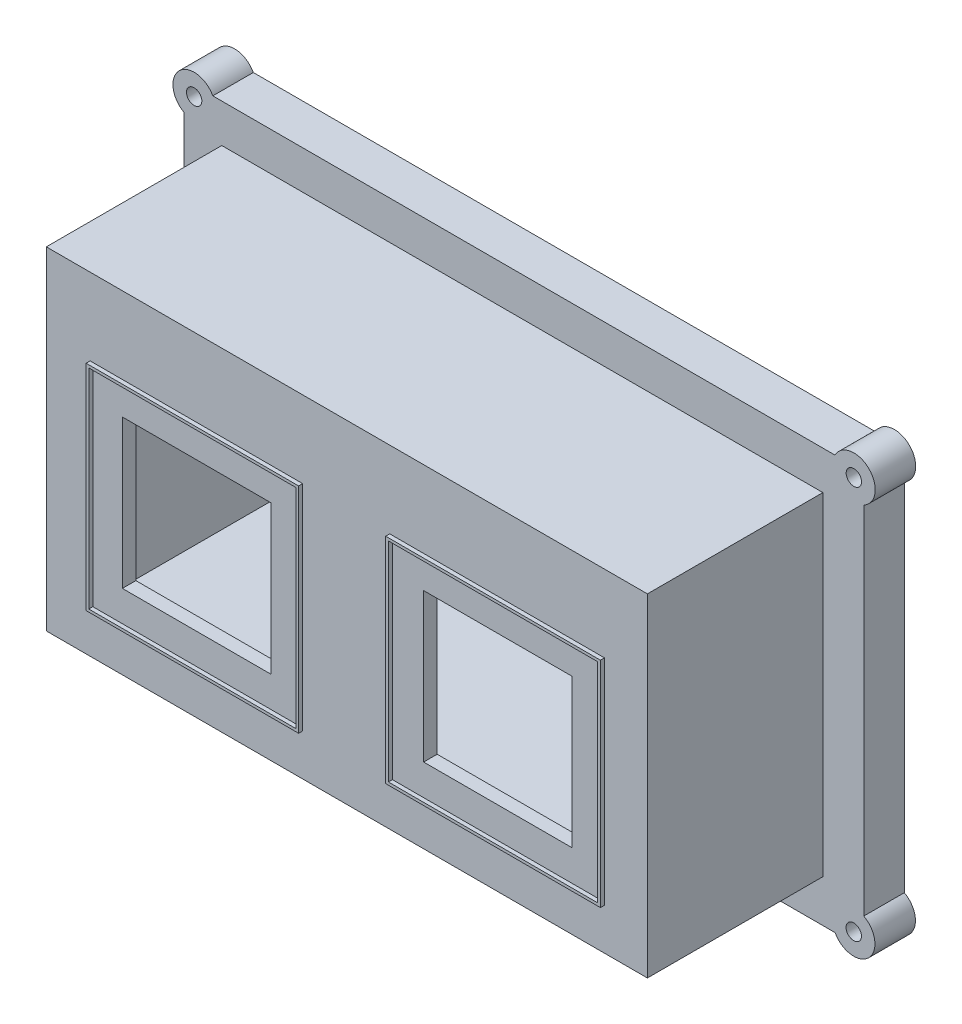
ISO-10303-21;
HEADER;
FILE_DESCRIPTION(('STEP AP214'),'2;1');
FILE_NAME('part.step','',(''),(''),'','','');
FILE_SCHEMA(('AUTOMOTIVE_DESIGN { 1 0 10303 214 1 1 1 1 }'));
ENDSEC;
DATA;
#1=APPLICATION_CONTEXT('core data for automotive mechanical design processes');
#2=APPLICATION_PROTOCOL_DEFINITION('international standard','automotive_design',2000,#1);
#3=PRODUCT_CONTEXT('',#1,'mechanical');
#4=PRODUCT('Part','Part','',(#3));
#5=PRODUCT_RELATED_PRODUCT_CATEGORY('part','',(#4));
#6=PRODUCT_DEFINITION_FORMATION('','',#4);
#7=PRODUCT_DEFINITION_CONTEXT('part definition',#1,'design');
#8=PRODUCT_DEFINITION('design','',#6,#7);
#9=PRODUCT_DEFINITION_SHAPE('','',#8);
#10=(LENGTH_UNIT() NAMED_UNIT(*) SI_UNIT(.MILLI.,.METRE.));
#11=(NAMED_UNIT(*) PLANE_ANGLE_UNIT() SI_UNIT($,.RADIAN.));
#12=(NAMED_UNIT(*) SI_UNIT($,.STERADIAN.) SOLID_ANGLE_UNIT());
#13=UNCERTAINTY_MEASURE_WITH_UNIT(LENGTH_MEASURE(1.E-05),#10,'distance_accuracy_value','');
#14=(GEOMETRIC_REPRESENTATION_CONTEXT(3) GLOBAL_UNCERTAINTY_ASSIGNED_CONTEXT((#13)) GLOBAL_UNIT_ASSIGNED_CONTEXT((#10,
#11,#12)) REPRESENTATION_CONTEXT('',''));
#15=CARTESIAN_POINT('',(0.,0.,0.));
#16=DIRECTION('',(0.,0.,1.));
#17=DIRECTION('',(1.,0.,0.));
#18=AXIS2_PLACEMENT_3D('',#15,#16,#17);
#19=CARTESIAN_POINT('',(0.,0.,-38.1));
#20=DIRECTION('',(0.,0.,1.));
#21=DIRECTION('',(1.,0.,0.));
#22=AXIS2_PLACEMENT_3D('',#19,#20,#21);
#23=PLANE('',#22);
#24=DIRECTION('',(1.,0.,0.));
#25=VECTOR('',#24,1.);
#26=CARTESIAN_POINT('',(0.,41.3808493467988,-38.1));
#27=LINE('',#26,#25);
#28=CARTESIAN_POINT('',(-22.2651768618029,41.3808493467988,-38.1));
#29=VERTEX_POINT('',#28);
#30=CARTESIAN_POINT('',(85.761361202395,41.3808493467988,-38.1));
#31=VERTEX_POINT('',#30);
#32=EDGE_CURVE('E502',#29,#31,#27,.T.);
#33=ORIENTED_EDGE('',*,*,#32,.F.);
#34=DIRECTION('',(0.,-1.,0.));
#35=VECTOR('',#34,1.);
#36=CARTESIAN_POINT('',(-22.2651768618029,0.,-38.1));
#37=LINE('',#36,#35);
#38=CARTESIAN_POINT('',(-22.2651768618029,-16.136711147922,-38.1));
#39=VERTEX_POINT('',#38);
#40=EDGE_CURVE('E514',#29,#39,#37,.T.);
#41=ORIENTED_EDGE('',*,*,#40,.T.);
#42=DIRECTION('',(1.,0.,0.));
#43=VECTOR('',#42,1.);
#44=CARTESIAN_POINT('',(0.,-16.136711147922,-38.1));
#45=LINE('',#44,#43);
#46=CARTESIAN_POINT('',(85.7613612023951,-16.136711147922,-38.1));
#47=VERTEX_POINT('',#46);
#48=EDGE_CURVE('E511',#39,#47,#45,.T.);
#49=ORIENTED_EDGE('',*,*,#48,.T.);
#50=DIRECTION('',(0.,-1.,0.));
#51=VECTOR('',#50,1.);
#52=CARTESIAN_POINT('',(85.7613612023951,0.,-38.1));
#53=LINE('',#52,#51);
#54=EDGE_CURVE('E506',#31,#47,#53,.T.);
#55=ORIENTED_EDGE('',*,*,#54,.F.);
#56=EDGE_LOOP('',(#33,#41,#49,#55));
#57=FACE_BOUND('',#56,.T.);
#58=CARTESIAN_POINT('',(86.0517822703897,41.2135942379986,-38.1));
#59=DIRECTION('',(0.,0.,-1.));
#60=DIRECTION('',(0.,1.,0.));
#61=AXIS2_PLACEMENT_3D('',#58,#59,#60);
#62=CIRCLE('',#61,3.85692071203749);
#63=CARTESIAN_POINT('',(86.0517822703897,45.0705149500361,-38.1));
#64=VERTEX_POINT('',#63);
#65=CARTESIAN_POINT('',(89.9087029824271,41.2135942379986,-38.1));
#66=VERTEX_POINT('',#65);
#67=EDGE_CURVE('E1156',#64,#66,#62,.T.);
#68=ORIENTED_EDGE('',*,*,#67,.T.);
#69=DIRECTION('',(0.,-1.,0.));
#70=VECTOR('',#69,1.);
#71=CARTESIAN_POINT('',(89.9087029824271,41.2135942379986,-38.1));
#72=LINE('',#71,#70);
#73=CARTESIAN_POINT('',(89.9087029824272,-16.6908067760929,-38.1));
#74=VERTEX_POINT('',#73);
#75=EDGE_CURVE('E1146',#66,#74,#72,.T.);
#76=ORIENTED_EDGE('',*,*,#75,.T.);
#77=CARTESIAN_POINT('',(86.0517822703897,-16.6908067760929,-38.1));
#78=DIRECTION('',(0.,0.,-1.));
#79=DIRECTION('',(1.,0.,0.));
#80=AXIS2_PLACEMENT_3D('',#77,#78,#79);
#81=CIRCLE('',#80,3.8569207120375);
#82=CARTESIAN_POINT('',(86.0517822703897,-20.5477274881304,-38.1));
#83=VERTEX_POINT('',#82);
#84=EDGE_CURVE('E1143',#74,#83,#81,.T.);
#85=ORIENTED_EDGE('',*,*,#84,.T.);
#86=DIRECTION('',(-1.,0.,0.));
#87=VECTOR('',#86,1.);
#88=CARTESIAN_POINT('',(86.0517822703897,-20.5477274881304,-38.1));
#89=LINE('',#88,#87);
#90=CARTESIAN_POINT('',(-21.9457537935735,-20.5477274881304,-38.1));
#91=VERTEX_POINT('',#90);
#92=EDGE_CURVE('E1136',#83,#91,#89,.T.);
#93=ORIENTED_EDGE('',*,*,#92,.T.);
#94=CARTESIAN_POINT('',(-21.9457537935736,-16.6908067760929,-38.1));
#95=DIRECTION('',(0.,0.,-1.));
#96=DIRECTION('',(0.,-1.,0.));
#97=AXIS2_PLACEMENT_3D('',#94,#95,#96);
#98=CIRCLE('',#97,3.8569207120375);
#99=CARTESIAN_POINT('',(-25.8026745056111,-16.6908067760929,-38.1));
#100=VERTEX_POINT('',#99);
#101=EDGE_CURVE('E1129',#91,#100,#98,.T.);
#102=ORIENTED_EDGE('',*,*,#101,.T.);
#103=DIRECTION('',(0.,1.,0.));
#104=VECTOR('',#103,1.);
#105=CARTESIAN_POINT('',(-25.8026745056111,-16.6908067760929,-38.1));
#106=LINE('',#105,#104);
#107=CARTESIAN_POINT('',(-25.8026745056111,23.3508265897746,-38.1));
#108=VERTEX_POINT('',#107);
#109=EDGE_CURVE('E1122',#100,#108,#106,.T.);
#110=ORIENTED_EDGE('',*,*,#109,.T.);
#111=DIRECTION('',(0.,1.,0.));
#112=VECTOR('',#111,1.);
#113=CARTESIAN_POINT('',(-25.8026745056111,23.3508265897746,-38.1));
#114=LINE('',#113,#112);
#115=CARTESIAN_POINT('',(-25.8026745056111,41.2135942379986,-38.1));
#116=VERTEX_POINT('',#115);
#117=EDGE_CURVE('E1177',#108,#116,#114,.T.);
#118=ORIENTED_EDGE('',*,*,#117,.T.);
#119=CARTESIAN_POINT('',(-21.9457537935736,41.2135942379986,-38.1));
#120=DIRECTION('',(0.,0.,-1.));
#121=DIRECTION('',(-1.,0.,0.));
#122=AXIS2_PLACEMENT_3D('',#119,#120,#121);
#123=CIRCLE('',#122,3.85692071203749);
#124=CARTESIAN_POINT('',(-21.9457537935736,45.0705149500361,-38.1));
#125=VERTEX_POINT('',#124);
#126=EDGE_CURVE('E1170',#116,#125,#123,.T.);
#127=ORIENTED_EDGE('',*,*,#126,.T.);
#128=DIRECTION('',(1.,0.,0.));
#129=VECTOR('',#128,1.);
#130=CARTESIAN_POINT('',(-21.9457537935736,45.0705149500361,-38.1));
#131=LINE('',#130,#129);
#132=EDGE_CURVE('E1163',#125,#64,#131,.T.);
#133=ORIENTED_EDGE('',*,*,#132,.T.);
#134=EDGE_LOOP('',(#68,#76,#85,#93,#102,#110,#118,#127,#133));
#135=FACE_BOUND('',#134,.T.);
#136=ADVANCED_FACE('F41',(#57,#135),#23,.F.);
#137=CARTESIAN_POINT('',(-30.007414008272,-24.7536590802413,-38.1));
#138=DIRECTION('',(0.,0.,-1.));
#139=DIRECTION('',(-1.,0.,0.));
#140=AXIS2_PLACEMENT_3D('',#137,#138,#139);
#141=CIRCLE('',#140,1.4478);
#142=CARTESIAN_POINT('',(-31.455214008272,-24.7536590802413,-38.1));
#143=VERTEX_POINT('',#142);
#144=EDGE_CURVE('E1280',#143,#143,#141,.T.);
#145=ORIENTED_EDGE('',*,*,#144,.F.);
#146=EDGE_LOOP('',(#145));
#147=FACE_BOUND('',#146,.T.);
#148=CARTESIAN_POINT('',(-30.007414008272,49.2944432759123,-38.1));
#149=DIRECTION('',(0.,0.,-1.));
#150=DIRECTION('',(-1.,0.,0.));
#151=AXIS2_PLACEMENT_3D('',#148,#149,#150);
#152=CIRCLE('',#151,1.4478);
#153=CARTESIAN_POINT('',(-31.455214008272,49.2944432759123,-38.1));
#154=VERTEX_POINT('',#153);
#155=EDGE_CURVE('E1288',#154,#154,#152,.T.);
#156=ORIENTED_EDGE('',*,*,#155,.F.);
#157=EDGE_LOOP('',(#156));
#158=FACE_BOUND('',#157,.T.);
#159=CARTESIAN_POINT('',(94.1327358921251,49.2944432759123,-38.1));
#160=DIRECTION('',(0.,0.,-1.));
#161=DIRECTION('',(-1.,0.,0.));
#162=AXIS2_PLACEMENT_3D('',#159,#160,#161);
#163=CIRCLE('',#162,1.4478);
#164=CARTESIAN_POINT('',(92.6849358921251,49.2944432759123,-38.1));
#165=VERTEX_POINT('',#164);
#166=EDGE_CURVE('E1296',#165,#165,#163,.T.);
#167=ORIENTED_EDGE('',*,*,#166,.F.);
#168=EDGE_LOOP('',(#167));
#169=FACE_BOUND('',#168,.T.);
#170=CARTESIAN_POINT('',(94.11198209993,-24.7536590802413,-38.1));
#171=DIRECTION('',(0.,0.,-1.));
#172=DIRECTION('',(-1.,0.,0.));
#173=AXIS2_PLACEMENT_3D('',#170,#171,#172);
#174=CIRCLE('',#173,1.4478);
#175=CARTESIAN_POINT('',(92.66418209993,-24.7536590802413,-38.1));
#176=VERTEX_POINT('',#175);
#177=EDGE_CURVE('E1272',#176,#176,#174,.T.);
#178=ORIENTED_EDGE('',*,*,#177,.F.);
#179=EDGE_LOOP('',(#178));
#180=FACE_BOUND('',#179,.T.);
#181=DIRECTION('',(-1.,0.,0.));
#182=VECTOR('',#181,1.);
#183=CARTESIAN_POINT('',(86.0517822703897,-24.1037274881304,-38.1));
#184=LINE('',#183,#182);
#185=CARTESIAN_POINT('',(86.0517822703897,-24.1037274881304,-38.1));
#186=VERTEX_POINT('',#185);
#187=CARTESIAN_POINT('',(-21.9457537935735,-24.1037274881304,-38.1));
#188=VERTEX_POINT('',#187);
#189=EDGE_CURVE('E888',#186,#188,#184,.T.);
#190=ORIENTED_EDGE('',*,*,#189,.F.);
#191=CARTESIAN_POINT('',(86.0517822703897,-16.6908067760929,-38.1));
#192=DIRECTION('',(0.,0.,-1.));
#193=DIRECTION('',(1.,0.,0.));
#194=AXIS2_PLACEMENT_3D('',#191,#192,#193);
#195=CIRCLE('',#194,7.4129207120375);
#196=CARTESIAN_POINT('',(93.4647029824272,-16.6908067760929,-38.1));
#197=VERTEX_POINT('',#196);
#198=EDGE_CURVE('E894',#197,#186,#195,.T.);
#199=ORIENTED_EDGE('',*,*,#198,.F.);
#200=DIRECTION('',(0.,-1.,0.));
#201=VECTOR('',#200,1.);
#202=CARTESIAN_POINT('',(93.4647029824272,41.2135942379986,-38.1));
#203=LINE('',#202,#201);
#204=CARTESIAN_POINT('',(93.4647029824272,41.2135942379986,-38.1));
#205=VERTEX_POINT('',#204);
#206=EDGE_CURVE('E900',#205,#197,#203,.T.);
#207=ORIENTED_EDGE('',*,*,#206,.F.);
#208=CARTESIAN_POINT('',(86.0517822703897,41.2135942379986,-38.1));
#209=DIRECTION('',(0.,0.,-1.));
#210=DIRECTION('',(0.,1.,0.));
#211=AXIS2_PLACEMENT_3D('',#208,#209,#210);
#212=CIRCLE('',#211,7.41292071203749);
#213=CARTESIAN_POINT('',(86.0517822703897,48.6265149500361,-38.1));
#214=VERTEX_POINT('',#213);
#215=EDGE_CURVE('E906',#214,#205,#212,.T.);
#216=ORIENTED_EDGE('',*,*,#215,.F.);
#217=DIRECTION('',(1.,0.,0.));
#218=VECTOR('',#217,1.);
#219=CARTESIAN_POINT('',(-21.9457537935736,48.6265149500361,-38.1));
#220=LINE('',#219,#218);
#221=CARTESIAN_POINT('',(-21.9457537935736,48.6265149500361,-38.1));
#222=VERTEX_POINT('',#221);
#223=EDGE_CURVE('E912',#222,#214,#220,.T.);
#224=ORIENTED_EDGE('',*,*,#223,.F.);
#225=CARTESIAN_POINT('',(-21.9457537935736,41.2135942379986,-38.1));
#226=DIRECTION('',(0.,0.,-1.));
#227=DIRECTION('',(-1.,0.,0.));
#228=AXIS2_PLACEMENT_3D('',#225,#226,#227);
#229=CIRCLE('',#228,7.41292071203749);
#230=CARTESIAN_POINT('',(-29.3586745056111,41.2135942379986,-38.1));
#231=VERTEX_POINT('',#230);
#232=EDGE_CURVE('E918',#231,#222,#229,.T.);
#233=ORIENTED_EDGE('',*,*,#232,.F.);
#234=DIRECTION('',(0.,1.,0.));
#235=VECTOR('',#234,1.);
#236=CARTESIAN_POINT('',(-29.3586745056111,23.3508265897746,-38.1));
#237=LINE('',#236,#235);
#238=CARTESIAN_POINT('',(-29.3586745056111,23.3508265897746,-38.1));
#239=VERTEX_POINT('',#238);
#240=EDGE_CURVE('E924',#239,#231,#237,.T.);
#241=ORIENTED_EDGE('',*,*,#240,.F.);
#242=DIRECTION('',(0.,1.,0.));
#243=VECTOR('',#242,1.);
#244=CARTESIAN_POINT('',(-29.3586745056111,-16.6908067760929,-38.1));
#245=LINE('',#244,#243);
#246=CARTESIAN_POINT('',(-29.3586745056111,-16.6908067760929,-38.1));
#247=VERTEX_POINT('',#246);
#248=EDGE_CURVE('E876',#247,#239,#245,.T.);
#249=ORIENTED_EDGE('',*,*,#248,.F.);
#250=CARTESIAN_POINT('',(-21.9457537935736,-16.6908067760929,-38.1));
#251=DIRECTION('',(0.,0.,-1.));
#252=DIRECTION('',(0.,-1.,0.));
#253=AXIS2_PLACEMENT_3D('',#250,#251,#252);
#254=CIRCLE('',#253,7.4129207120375);
#255=EDGE_CURVE('E882',#188,#247,#254,.T.);
#256=ORIENTED_EDGE('',*,*,#255,.F.);
#257=EDGE_LOOP('',(#190,#199,#207,#216,#224,#233,#241,#249,#256));
#258=FACE_BOUND('',#257,.T.);
#259=DIRECTION('',(0.,-1.,0.));
#260=VECTOR('',#259,1.);
#261=CARTESIAN_POINT('',(96.0047029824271,0.,-38.1));
#262=LINE('',#261,#260);
#263=CARTESIAN_POINT('',(96.0047029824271,45.7423218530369,-38.1));
#264=VERTEX_POINT('',#263);
#265=CARTESIAN_POINT('',(96.0047029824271,-21.2436519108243,-38.1));
#266=VERTEX_POINT('',#265);
#267=EDGE_CURVE('E490',#264,#266,#262,.T.);
#268=ORIENTED_EDGE('',*,*,#267,.T.);
#269=CARTESIAN_POINT('',(94.11198209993,-24.7536590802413,-38.1));
#270=DIRECTION('',(0.,0.,-1.));
#271=DIRECTION('',(-1.,0.,0.));
#272=AXIS2_PLACEMENT_3D('',#269,#270,#271);
#273=CIRCLE('',#272,3.98779922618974);
#274=CARTESIAN_POINT('',(90.6005459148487,-26.6437274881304,-38.1));
#275=VERTEX_POINT('',#274);
#276=EDGE_CURVE('E1264',#266,#275,#273,.T.);
#277=ORIENTED_EDGE('',*,*,#276,.T.);
#278=DIRECTION('',(1.,0.,0.));
#279=VECTOR('',#278,1.);
#280=CARTESIAN_POINT('',(0.,-26.6437274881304,-38.1));
#281=LINE('',#280,#279);
#282=CARTESIAN_POINT('',(-26.4965573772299,-26.6437274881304,-38.1));
#283=VERTEX_POINT('',#282);
#284=EDGE_CURVE('E67',#283,#275,#281,.T.);
#285=ORIENTED_EDGE('',*,*,#284,.F.);
#286=CARTESIAN_POINT('',(-30.0072807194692,-24.7523337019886,-38.1));
#287=DIRECTION('',(0.,0.,-1.));
#288=DIRECTION('',(-1.,0.,0.));
#289=AXIS2_PLACEMENT_3D('',#286,#287,#288);
#290=CIRCLE('',#289,3.9878);
#291=CARTESIAN_POINT('',(-31.8986745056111,-21.2416103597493,-38.1));
#292=VERTEX_POINT('',#291);
#293=EDGE_CURVE('E1234',#283,#292,#290,.T.);
#294=ORIENTED_EDGE('',*,*,#293,.T.);
#295=DIRECTION('',(0.,-1.,0.));
#296=VECTOR('',#295,1.);
#297=CARTESIAN_POINT('',(-31.8986745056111,0.,-38.1));
#298=LINE('',#297,#296);
#299=CARTESIAN_POINT('',(-31.8986745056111,45.7644533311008,-38.1));
#300=VERTEX_POINT('',#299);
#301=EDGE_CURVE('E489',#300,#292,#298,.T.);
#302=ORIENTED_EDGE('',*,*,#301,.F.);
#303=CARTESIAN_POINT('',(-30.0072446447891,49.2751572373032,-38.1));
#304=DIRECTION('',(0.,0.,-1.));
#305=DIRECTION('',(-1.,0.,0.));
#306=AXIS2_PLACEMENT_3D('',#303,#304,#305);
#307=CIRCLE('',#306,3.98779999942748);
#308=CARTESIAN_POINT('',(-26.4965018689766,51.1665149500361,-38.1));
#309=VERTEX_POINT('',#308);
#310=EDGE_CURVE('E487',#300,#309,#307,.T.);
#311=ORIENTED_EDGE('',*,*,#310,.T.);
#312=DIRECTION('',(1.,0.,0.));
#313=VECTOR('',#312,1.);
#314=CARTESIAN_POINT('',(0.,51.1665149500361,-38.1));
#315=LINE('',#314,#313);
#316=CARTESIAN_POINT('',(90.5806695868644,51.1665149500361,-38.1));
#317=VERTEX_POINT('',#316);
#318=EDGE_CURVE('E478',#309,#317,#315,.T.);
#319=ORIENTED_EDGE('',*,*,#318,.T.);
#320=CARTESIAN_POINT('',(94.1327358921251,49.2944432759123,-38.1));
#321=DIRECTION('',(0.,0.,-1.));
#322=DIRECTION('',(-1.,0.,0.));
#323=AXIS2_PLACEMENT_3D('',#320,#321,#322);
#324=CIRCLE('',#323,4.01519954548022);
#325=EDGE_CURVE('E463',#317,#264,#324,.T.);
#326=ORIENTED_EDGE('',*,*,#325,.T.);
#327=EDGE_LOOP('',(#268,#277,#285,#294,#302,#311,#319,#326));
#328=FACE_BOUND('',#327,.T.);
#329=ADVANCED_FACE('F485',(#147,#158,#169,#180,#258,#328),#23,.F.);
#330=CARTESIAN_POINT('',(0.,0.,2.54));
#331=DIRECTION('',(0.,0.,1.));
#332=DIRECTION('',(1.,0.,0.));
#333=AXIS2_PLACEMENT_3D('',#330,#331,#332);
#334=PLANE('',#333);
#335=DIRECTION('',(1.,0.,0.));
#336=VECTOR('',#335,1.);
#337=CARTESIAN_POINT('',(0.,23.4046127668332,2.54));
#338=LINE('',#337,#336);
#339=CARTESIAN_POINT('',(46.1991834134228,23.4046127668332,2.54));
#340=VERTEX_POINT('',#339);
#341=CARTESIAN_POINT('',(74.1391834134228,23.4046127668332,2.54));
#342=VERTEX_POINT('',#341);
#343=EDGE_CURVE('E753',#340,#342,#338,.T.);
#344=ORIENTED_EDGE('',*,*,#343,.T.);
#345=DIRECTION('',(0.,-1.,0.));
#346=VECTOR('',#345,1.);
#347=CARTESIAN_POINT('',(74.1391834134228,0.,2.54));
#348=LINE('',#347,#346);
#349=CARTESIAN_POINT('',(74.1391834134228,-4.53538723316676,2.54));
#350=VERTEX_POINT('',#349);
#351=EDGE_CURVE('E757',#342,#350,#348,.T.);
#352=ORIENTED_EDGE('',*,*,#351,.T.);
#353=DIRECTION('',(1.,0.,0.));
#354=VECTOR('',#353,1.);
#355=CARTESIAN_POINT('',(0.,-4.53538723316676,2.54));
#356=LINE('',#355,#354);
#357=CARTESIAN_POINT('',(46.1991834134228,-4.53538723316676,2.54));
#358=VERTEX_POINT('',#357);
#359=EDGE_CURVE('E760',#358,#350,#356,.T.);
#360=ORIENTED_EDGE('',*,*,#359,.F.);
#361=DIRECTION('',(0.,-1.,0.));
#362=VECTOR('',#361,1.);
#363=CARTESIAN_POINT('',(46.1991834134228,0.,2.54));
#364=LINE('',#363,#362);
#365=EDGE_CURVE('E764',#340,#358,#364,.T.);
#366=ORIENTED_EDGE('',*,*,#365,.F.);
#367=EDGE_LOOP('',(#344,#352,#360,#366));
#368=FACE_BOUND('',#367,.T.);
#369=DIRECTION('',(0.,1.,0.));
#370=VECTOR('',#369,1.);
#371=CARTESIAN_POINT('',(79.7198693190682,0.,2.54));
#372=LINE('',#371,#370);
#373=CARTESIAN_POINT('',(79.7198693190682,-10.3431914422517,2.54));
#374=VERTEX_POINT('',#373);
#375=CARTESIAN_POINT('',(79.7198693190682,28.9500723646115,2.54));
#376=VERTEX_POINT('',#375);
#377=EDGE_CURVE('E628',#374,#376,#372,.T.);
#378=ORIENTED_EDGE('',*,*,#377,.T.);
#379=DIRECTION('',(-1.,0.,0.));
#380=VECTOR('',#379,1.);
#381=CARTESIAN_POINT('',(0.,28.9500723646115,2.54));
#382=LINE('',#381,#380);
#383=CARTESIAN_POINT('',(40.3198810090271,28.9500723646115,2.54));
#384=VERTEX_POINT('',#383);
#385=EDGE_CURVE('E631',#376,#384,#382,.T.);
#386=ORIENTED_EDGE('',*,*,#385,.T.);
#387=DIRECTION('',(0.,1.,0.));
#388=VECTOR('',#387,1.);
#389=CARTESIAN_POINT('',(40.3198810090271,0.,2.54));
#390=LINE('',#389,#388);
#391=CARTESIAN_POINT('',(40.3198810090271,-10.3431914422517,2.54));
#392=VERTEX_POINT('',#391);
#393=EDGE_CURVE('E593',#392,#384,#390,.T.);
#394=ORIENTED_EDGE('',*,*,#393,.F.);
#395=DIRECTION('',(-1.,0.,0.));
#396=VECTOR('',#395,1.);
#397=CARTESIAN_POINT('',(0.,-10.3431914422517,2.54));
#398=LINE('',#397,#396);
#399=EDGE_CURVE('E624',#374,#392,#398,.T.);
#400=ORIENTED_EDGE('',*,*,#399,.F.);
#401=EDGE_LOOP('',(#378,#386,#394,#400));
#402=FACE_BOUND('',#401,.T.);
#403=ADVANCED_FACE('F1317',(#368,#402),#334,.T.);
#404=DIRECTION('',(1.,0.,0.));
#405=VECTOR('',#404,1.);
#406=CARTESIAN_POINT('',(0.,23.3508265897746,2.54));
#407=LINE('',#406,#405);
#408=CARTESIAN_POINT('',(-10.4965185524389,23.3508265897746,2.54));
#409=VERTEX_POINT('',#408);
#410=CARTESIAN_POINT('',(17.4434814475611,23.3508265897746,2.54));
#411=VERTEX_POINT('',#410);
#412=EDGE_CURVE('E738',#409,#411,#407,.T.);
#413=ORIENTED_EDGE('',*,*,#412,.T.);
#414=DIRECTION('',(0.,-1.,0.));
#415=VECTOR('',#414,1.);
#416=CARTESIAN_POINT('',(17.4434814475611,0.,2.54));
#417=LINE('',#416,#415);
#418=CARTESIAN_POINT('',(17.4434814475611,-4.58917341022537,2.54));
#419=VERTEX_POINT('',#418);
#420=EDGE_CURVE('E742',#411,#419,#417,.T.);
#421=ORIENTED_EDGE('',*,*,#420,.T.);
#422=DIRECTION('',(1.,0.,0.));
#423=VECTOR('',#422,1.);
#424=CARTESIAN_POINT('',(0.,-4.58917341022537,2.54));
#425=LINE('',#424,#423);
#426=CARTESIAN_POINT('',(-10.4965185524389,-4.58917341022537,2.54));
#427=VERTEX_POINT('',#426);
#428=EDGE_CURVE('E745',#427,#419,#425,.T.);
#429=ORIENTED_EDGE('',*,*,#428,.F.);
#430=DIRECTION('',(0.,-1.,0.));
#431=VECTOR('',#430,1.);
#432=CARTESIAN_POINT('',(-10.4965185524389,0.,2.54));
#433=LINE('',#432,#431);
#434=EDGE_CURVE('E749',#409,#427,#433,.T.);
#435=ORIENTED_EDGE('',*,*,#434,.F.);
#436=EDGE_LOOP('',(#413,#421,#429,#435));
#437=FACE_BOUND('',#436,.T.);
#438=DIRECTION('',(0.,1.,0.));
#439=VECTOR('',#438,1.);
#440=CARTESIAN_POINT('',(22.9331251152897,0.,2.54));
#441=LINE('',#440,#439);
#442=CARTESIAN_POINT('',(22.9331251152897,-10.3431914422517,2.54));
#443=VERTEX_POINT('',#442);
#444=CARTESIAN_POINT('',(22.9331251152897,28.9500723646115,2.54));
#445=VERTEX_POINT('',#444);
#446=EDGE_CURVE('E716',#443,#445,#441,.T.);
#447=ORIENTED_EDGE('',*,*,#446,.T.);
#448=DIRECTION('',(-1.,0.,0.));
#449=VECTOR('',#448,1.);
#450=CARTESIAN_POINT('',(0.,28.9500723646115,2.54));
#451=LINE('',#450,#449);
#452=CARTESIAN_POINT('',(-16.0521286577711,28.9500723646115,2.54));
#453=VERTEX_POINT('',#452);
#454=EDGE_CURVE('E719',#445,#453,#451,.T.);
#455=ORIENTED_EDGE('',*,*,#454,.T.);
#456=DIRECTION('',(0.,1.,0.));
#457=VECTOR('',#456,1.);
#458=CARTESIAN_POINT('',(-16.0521286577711,0.,2.54));
#459=LINE('',#458,#457);
#460=CARTESIAN_POINT('',(-16.0521286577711,-10.3431914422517,2.54));
#461=VERTEX_POINT('',#460);
#462=EDGE_CURVE('E681',#461,#453,#459,.T.);
#463=ORIENTED_EDGE('',*,*,#462,.F.);
#464=DIRECTION('',(-1.,0.,0.));
#465=VECTOR('',#464,1.);
#466=CARTESIAN_POINT('',(0.,-10.3431914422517,2.54));
#467=LINE('',#466,#465);
#468=EDGE_CURVE('E712',#443,#461,#467,.T.);
#469=ORIENTED_EDGE('',*,*,#468,.F.);
#470=EDGE_LOOP('',(#447,#455,#463,#469));
#471=FACE_BOUND('',#470,.T.);
#472=ADVANCED_FACE('F1504',(#437,#471),#334,.T.);
#473=CARTESIAN_POINT('',(0.,23.4046127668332,2.54));
#474=DIRECTION('',(0.,1.,0.));
#475=DIRECTION('',(0.,0.,1.));
#476=AXIS2_PLACEMENT_3D('',#473,#474,#475);
#477=PLANE('',#476);
#478=DIRECTION('',(1.,0.,0.));
#479=VECTOR('',#478,1.);
#480=CARTESIAN_POINT('',(0.,23.4046127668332,0.));
#481=LINE('',#480,#479);
#482=CARTESIAN_POINT('',(46.1991834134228,23.4046127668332,0.));
#483=VERTEX_POINT('',#482);
#484=CARTESIAN_POINT('',(74.1391834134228,23.4046127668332,0.));
#485=VERTEX_POINT('',#484);
#486=EDGE_CURVE('E784',#483,#485,#481,.T.);
#487=ORIENTED_EDGE('',*,*,#486,.T.);
#488=DIRECTION('',(0.,0.,-1.));
#489=VECTOR('',#488,1.);
#490=CARTESIAN_POINT('',(74.1391834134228,23.4046127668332,2.54));
#491=LINE('',#490,#489);
#492=EDGE_CURVE('E11',#342,#485,#491,.T.);
#493=ORIENTED_EDGE('',*,*,#492,.F.);
#494=ORIENTED_EDGE('',*,*,#343,.F.);
#495=DIRECTION('',(0.,0.,-1.));
#496=VECTOR('',#495,1.);
#497=CARTESIAN_POINT('',(46.1991834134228,23.4046127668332,2.54));
#498=LINE('',#497,#496);
#499=EDGE_CURVE('E799',#340,#483,#498,.T.);
#500=ORIENTED_EDGE('',*,*,#499,.T.);
#501=EDGE_LOOP('',(#487,#493,#494,#500));
#502=FACE_BOUND('',#501,.T.);
#503=ADVANCED_FACE('F1519',(#502),#477,.F.);
#504=CARTESIAN_POINT('',(74.1391834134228,0.,2.54));
#505=DIRECTION('',(1.,0.,0.));
#506=DIRECTION('',(0.,0.,-1.));
#507=AXIS2_PLACEMENT_3D('',#504,#505,#506);
#508=PLANE('',#507);
#509=DIRECTION('',(0.,-1.,0.));
#510=VECTOR('',#509,1.);
#511=CARTESIAN_POINT('',(74.1391834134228,0.,0.));
#512=LINE('',#511,#510);
#513=CARTESIAN_POINT('',(74.1391834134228,-4.53538723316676,0.));
#514=VERTEX_POINT('',#513);
#515=EDGE_CURVE('E788',#485,#514,#512,.T.);
#516=ORIENTED_EDGE('',*,*,#515,.T.);
#517=DIRECTION('',(0.,0.,-1.));
#518=VECTOR('',#517,1.);
#519=CARTESIAN_POINT('',(74.1391834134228,-4.53538723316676,2.54));
#520=LINE('',#519,#518);
#521=EDGE_CURVE('E51',#350,#514,#520,.T.);
#522=ORIENTED_EDGE('',*,*,#521,.F.);
#523=ORIENTED_EDGE('',*,*,#351,.F.);
#524=ORIENTED_EDGE('',*,*,#492,.T.);
#525=EDGE_LOOP('',(#516,#522,#523,#524));
#526=FACE_BOUND('',#525,.T.);
#527=ADVANCED_FACE('F1515',(#526),#508,.F.);
#528=CARTESIAN_POINT('',(0.,-4.53538723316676,2.54));
#529=DIRECTION('',(0.,1.,0.));
#530=DIRECTION('',(0.,0.,1.));
#531=AXIS2_PLACEMENT_3D('',#528,#529,#530);
#532=PLANE('',#531);
#533=DIRECTION('',(1.,0.,0.));
#534=VECTOR('',#533,1.);
#535=CARTESIAN_POINT('',(0.,-4.53538723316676,0.));
#536=LINE('',#535,#534);
#537=CARTESIAN_POINT('',(46.1991834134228,-4.53538723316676,0.));
#538=VERTEX_POINT('',#537);
#539=EDGE_CURVE('E792',#538,#514,#536,.T.);
#540=ORIENTED_EDGE('',*,*,#539,.F.);
#541=DIRECTION('',(0.,0.,-1.));
#542=VECTOR('',#541,1.);
#543=CARTESIAN_POINT('',(46.1991834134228,-4.53538723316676,2.54));
#544=LINE('',#543,#542);
#545=EDGE_CURVE('E802',#358,#538,#544,.T.);
#546=ORIENTED_EDGE('',*,*,#545,.F.);
#547=ORIENTED_EDGE('',*,*,#359,.T.);
#548=ORIENTED_EDGE('',*,*,#521,.T.);
#549=EDGE_LOOP('',(#540,#546,#547,#548));
#550=FACE_BOUND('',#549,.T.);
#551=ADVANCED_FACE('F1511',(#550),#532,.T.);
#552=CARTESIAN_POINT('',(0.,23.3508265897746,2.54));
#553=DIRECTION('',(0.,1.,0.));
#554=DIRECTION('',(0.,0.,1.));
#555=AXIS2_PLACEMENT_3D('',#552,#553,#554);
#556=PLANE('',#555);
#557=DIRECTION('',(1.,0.,0.));
#558=VECTOR('',#557,1.);
#559=CARTESIAN_POINT('',(0.,23.3508265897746,0.));
#560=LINE('',#559,#558);
#561=CARTESIAN_POINT('',(-10.4965185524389,23.3508265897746,0.));
#562=VERTEX_POINT('',#561);
#563=CARTESIAN_POINT('',(17.4434814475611,23.3508265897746,0.));
#564=VERTEX_POINT('',#563);
#565=EDGE_CURVE('E722',#562,#564,#560,.T.);
#566=ORIENTED_EDGE('',*,*,#565,.T.);
#567=DIRECTION('',(0.,0.,-1.));
#568=VECTOR('',#567,1.);
#569=CARTESIAN_POINT('',(17.4434814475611,23.3508265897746,2.54));
#570=LINE('',#569,#568);
#571=EDGE_CURVE('E803',#411,#564,#570,.T.);
#572=ORIENTED_EDGE('',*,*,#571,.F.);
#573=ORIENTED_EDGE('',*,*,#412,.F.);
#574=DIRECTION('',(0.,0.,-1.));
#575=VECTOR('',#574,1.);
#576=CARTESIAN_POINT('',(-10.4965185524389,23.3508265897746,2.54));
#577=LINE('',#576,#575);
#578=EDGE_CURVE('E808',#409,#562,#577,.T.);
#579=ORIENTED_EDGE('',*,*,#578,.T.);
#580=EDGE_LOOP('',(#566,#572,#573,#579));
#581=FACE_BOUND('',#580,.T.);
#582=ADVANCED_FACE('F1514',(#581),#556,.F.);
#583=CARTESIAN_POINT('',(17.4434814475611,0.,2.54));
#584=DIRECTION('',(1.,0.,0.));
#585=DIRECTION('',(0.,1.,0.));
#586=AXIS2_PLACEMENT_3D('',#583,#584,#585);
#587=PLANE('',#586);
#588=DIRECTION('',(0.,-1.,0.));
#589=VECTOR('',#588,1.);
#590=CARTESIAN_POINT('',(17.4434814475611,0.,0.));
#591=LINE('',#590,#589);
#592=CARTESIAN_POINT('',(17.4434814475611,-4.58917341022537,0.));
#593=VERTEX_POINT('',#592);
#594=EDGE_CURVE('E772',#564,#593,#591,.T.);
#595=ORIENTED_EDGE('',*,*,#594,.T.);
#596=DIRECTION('',(0.,0.,-1.));
#597=VECTOR('',#596,1.);
#598=CARTESIAN_POINT('',(17.4434814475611,-4.58917341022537,2.54));
#599=LINE('',#598,#597);
#600=EDGE_CURVE('E814',#419,#593,#599,.T.);
#601=ORIENTED_EDGE('',*,*,#600,.F.);
#602=ORIENTED_EDGE('',*,*,#420,.F.);
#603=ORIENTED_EDGE('',*,*,#571,.T.);
#604=EDGE_LOOP('',(#595,#601,#602,#603));
#605=FACE_BOUND('',#604,.T.);
#606=ADVANCED_FACE('F1532',(#605),#587,.F.);
#607=CARTESIAN_POINT('',(0.,-4.58917341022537,2.54));
#608=DIRECTION('',(0.,1.,0.));
#609=DIRECTION('',(0.,0.,1.));
#610=AXIS2_PLACEMENT_3D('',#607,#608,#609);
#611=PLANE('',#610);
#612=DIRECTION('',(1.,0.,0.));
#613=VECTOR('',#612,1.);
#614=CARTESIAN_POINT('',(0.,-4.58917341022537,0.));
#615=LINE('',#614,#613);
#616=CARTESIAN_POINT('',(-10.4965185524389,-4.58917341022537,0.));
#617=VERTEX_POINT('',#616);
#618=EDGE_CURVE('E776',#617,#593,#615,.T.);
#619=ORIENTED_EDGE('',*,*,#618,.F.);
#620=DIRECTION('',(0.,0.,-1.));
#621=VECTOR('',#620,1.);
#622=CARTESIAN_POINT('',(-10.4965185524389,-4.58917341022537,2.54));
#623=LINE('',#622,#621);
#624=EDGE_CURVE('E811',#427,#617,#623,.T.);
#625=ORIENTED_EDGE('',*,*,#624,.F.);
#626=ORIENTED_EDGE('',*,*,#428,.T.);
#627=ORIENTED_EDGE('',*,*,#600,.T.);
#628=EDGE_LOOP('',(#619,#625,#626,#627));
#629=FACE_BOUND('',#628,.T.);
#630=ADVANCED_FACE('F1529',(#629),#611,.T.);
#631=CARTESIAN_POINT('',(88.3013612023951,0.,2.54));
#632=DIRECTION('',(1.,0.,0.));
#633=DIRECTION('',(0.,0.,-1.));
#634=AXIS2_PLACEMENT_3D('',#631,#632,#633);
#635=PLANE('',#634);
#636=DIRECTION('',(0.,-1.,0.));
#637=VECTOR('',#636,1.);
#638=CARTESIAN_POINT('',(88.3013612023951,0.,-30.48));
#639=LINE('',#638,#637);
#640=CARTESIAN_POINT('',(88.3013612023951,43.9208493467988,-30.48));
#641=VERTEX_POINT('',#640);
#642=CARTESIAN_POINT('',(88.3013612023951,-18.676711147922,-30.48));
#643=VERTEX_POINT('',#642);
#644=EDGE_CURVE('E842',#641,#643,#639,.T.);
#645=ORIENTED_EDGE('',*,*,#644,.F.);
#646=DIRECTION('',(0.,0.,-1.));
#647=VECTOR('',#646,1.);
#648=CARTESIAN_POINT('',(88.3013612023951,43.9208493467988,2.54));
#649=LINE('',#648,#647);
#650=CARTESIAN_POINT('',(88.3013612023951,43.9208493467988,2.54));
#651=VERTEX_POINT('',#650);
#652=EDGE_CURVE('E45',#651,#641,#649,.T.);
#653=ORIENTED_EDGE('',*,*,#652,.F.);
#654=DIRECTION('',(0.,-1.,0.));
#655=VECTOR('',#654,1.);
#656=CARTESIAN_POINT('',(88.3013612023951,0.,2.54));
#657=LINE('',#656,#655);
#658=CARTESIAN_POINT('',(88.3013612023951,-18.676711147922,2.54));
#659=VERTEX_POINT('',#658);
#660=EDGE_CURVE('E723',#651,#659,#657,.T.);
#661=ORIENTED_EDGE('',*,*,#660,.T.);
#662=DIRECTION('',(0.,0.,-1.));
#663=VECTOR('',#662,1.);
#664=CARTESIAN_POINT('',(88.3013612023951,-18.676711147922,2.54));
#665=LINE('',#664,#663);
#666=EDGE_CURVE('E768',#659,#643,#665,.T.);
#667=ORIENTED_EDGE('',*,*,#666,.T.);
#668=EDGE_LOOP('',(#645,#653,#661,#667));
#669=FACE_BOUND('',#668,.T.);
#670=ADVANCED_FACE('F43',(#669),#635,.T.);
#671=CARTESIAN_POINT('',(0.,43.9208493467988,2.54));
#672=DIRECTION('',(0.,1.,0.));
#673=DIRECTION('',(0.,0.,1.));
#674=AXIS2_PLACEMENT_3D('',#671,#672,#673);
#675=PLANE('',#674);
#676=DIRECTION('',(1.,0.,0.));
#677=VECTOR('',#676,1.);
#678=CARTESIAN_POINT('',(0.,43.9208493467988,-30.48));
#679=LINE('',#678,#677);
#680=CARTESIAN_POINT('',(-24.8051768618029,43.9208493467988,-30.48));
#681=VERTEX_POINT('',#680);
#682=EDGE_CURVE('E837',#681,#641,#679,.T.);
#683=ORIENTED_EDGE('',*,*,#682,.F.);
#684=DIRECTION('',(0.,0.,-1.));
#685=VECTOR('',#684,1.);
#686=CARTESIAN_POINT('',(-24.8051768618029,43.9208493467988,2.54));
#687=LINE('',#686,#685);
#688=CARTESIAN_POINT('',(-24.8051768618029,43.9208493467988,2.54));
#689=VERTEX_POINT('',#688);
#690=EDGE_CURVE('E826',#689,#681,#687,.T.);
#691=ORIENTED_EDGE('',*,*,#690,.F.);
#692=DIRECTION('',(1.,0.,0.));
#693=VECTOR('',#692,1.);
#694=CARTESIAN_POINT('',(0.,43.9208493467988,2.54));
#695=LINE('',#694,#693);
#696=EDGE_CURVE('E727',#689,#651,#695,.T.);
#697=ORIENTED_EDGE('',*,*,#696,.T.);
#698=ORIENTED_EDGE('',*,*,#652,.T.);
#699=EDGE_LOOP('',(#683,#691,#697,#698));
#700=FACE_BOUND('',#699,.T.);
#701=ADVANCED_FACE('F836',(#700),#675,.T.);
#702=CARTESIAN_POINT('',(-24.8051768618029,0.,2.54));
#703=DIRECTION('',(1.,0.,0.));
#704=DIRECTION('',(0.,0.,-1.));
#705=AXIS2_PLACEMENT_3D('',#702,#703,#704);
#706=PLANE('',#705);
#707=ORIENTED_EDGE('',*,*,#690,.T.);
#708=DIRECTION('',(0.,-1.,0.));
#709=VECTOR('',#708,1.);
#710=CARTESIAN_POINT('',(-24.8051768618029,0.,-30.48));
#711=LINE('',#710,#709);
#712=CARTESIAN_POINT('',(-24.8051768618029,-18.676711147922,-30.48));
#713=VERTEX_POINT('',#712);
#714=EDGE_CURVE('E524',#681,#713,#711,.T.);
#715=ORIENTED_EDGE('',*,*,#714,.T.);
#716=DIRECTION('',(0.,0.,-1.));
#717=VECTOR('',#716,1.);
#718=CARTESIAN_POINT('',(-24.8051768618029,-18.676711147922,2.54));
#719=LINE('',#718,#717);
#720=CARTESIAN_POINT('',(-24.8051768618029,-18.676711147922,2.54));
#721=VERTEX_POINT('',#720);
#722=EDGE_CURVE('E823',#721,#713,#719,.T.);
#723=ORIENTED_EDGE('',*,*,#722,.F.);
#724=DIRECTION('',(0.,-1.,0.));
#725=VECTOR('',#724,1.);
#726=CARTESIAN_POINT('',(-24.8051768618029,0.,2.54));
#727=LINE('',#726,#725);
#728=EDGE_CURVE('E732',#689,#721,#727,.T.);
#729=ORIENTED_EDGE('',*,*,#728,.F.);
#730=EDGE_LOOP('',(#707,#715,#723,#729));
#731=FACE_BOUND('',#730,.T.);
#732=ADVANCED_FACE('F1527',(#731),#706,.F.);
#733=CARTESIAN_POINT('',(-10.4965185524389,0.,2.54));
#734=DIRECTION('',(1.,0.,0.));
#735=DIRECTION('',(0.,1.,0.));
#736=AXIS2_PLACEMENT_3D('',#733,#734,#735);
#737=PLANE('',#736);
#738=DIRECTION('',(0.,-1.,0.));
#739=VECTOR('',#738,1.);
#740=CARTESIAN_POINT('',(-10.4965185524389,0.,0.));
#741=LINE('',#740,#739);
#742=EDGE_CURVE('E780',#562,#617,#741,.T.);
#743=ORIENTED_EDGE('',*,*,#742,.F.);
#744=ORIENTED_EDGE('',*,*,#578,.F.);
#745=ORIENTED_EDGE('',*,*,#434,.T.);
#746=ORIENTED_EDGE('',*,*,#624,.T.);
#747=EDGE_LOOP('',(#743,#744,#745,#746));
#748=FACE_BOUND('',#747,.T.);
#749=ADVANCED_FACE('F1524',(#748),#737,.T.);
#750=CARTESIAN_POINT('',(0.,-18.676711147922,2.54));
#751=DIRECTION('',(0.,1.,0.));
#752=DIRECTION('',(0.,0.,1.));
#753=AXIS2_PLACEMENT_3D('',#750,#751,#752);
#754=PLANE('',#753);
#755=ORIENTED_EDGE('',*,*,#722,.T.);
#756=DIRECTION('',(1.,0.,0.));
#757=VECTOR('',#756,1.);
#758=CARTESIAN_POINT('',(0.,-18.676711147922,-30.48));
#759=LINE('',#758,#757);
#760=EDGE_CURVE('E851',#713,#643,#759,.T.);
#761=ORIENTED_EDGE('',*,*,#760,.T.);
#762=ORIENTED_EDGE('',*,*,#666,.F.);
#763=DIRECTION('',(1.,0.,0.));
#764=VECTOR('',#763,1.);
#765=CARTESIAN_POINT('',(0.,-18.676711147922,2.54));
#766=LINE('',#765,#764);
#767=EDGE_CURVE('E735',#721,#659,#766,.T.);
#768=ORIENTED_EDGE('',*,*,#767,.F.);
#769=EDGE_LOOP('',(#755,#761,#762,#768));
#770=FACE_BOUND('',#769,.T.);
#771=ADVANCED_FACE('F850',(#770),#754,.F.);
#772=CARTESIAN_POINT('',(46.1991834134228,0.,2.54));
#773=DIRECTION('',(1.,0.,0.));
#774=DIRECTION('',(0.,0.,-1.));
#775=AXIS2_PLACEMENT_3D('',#772,#773,#774);
#776=PLANE('',#775);
#777=DIRECTION('',(0.,-1.,0.));
#778=VECTOR('',#777,1.);
#779=CARTESIAN_POINT('',(46.1991834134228,0.,0.));
#780=LINE('',#779,#778);
#781=EDGE_CURVE('E728',#483,#538,#780,.T.);
#782=ORIENTED_EDGE('',*,*,#781,.F.);
#783=ORIENTED_EDGE('',*,*,#499,.F.);
#784=ORIENTED_EDGE('',*,*,#365,.T.);
#785=ORIENTED_EDGE('',*,*,#545,.T.);
#786=EDGE_LOOP('',(#782,#783,#784,#785));
#787=FACE_BOUND('',#786,.T.);
#788=ADVANCED_FACE('F1502',(#787),#776,.T.);
#789=DIRECTION('',(0.,1.,0.));
#790=VECTOR('',#789,1.);
#791=CARTESIAN_POINT('',(80.2278693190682,0.,2.54));
#792=LINE('',#791,#790);
#793=CARTESIAN_POINT('',(80.2278693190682,-10.8620653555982,2.54));
#794=VERTEX_POINT('',#793);
#795=CARTESIAN_POINT('',(80.2278693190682,29.4572351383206,2.54));
#796=VERTEX_POINT('',#795);
#797=EDGE_CURVE('E621',#794,#796,#792,.T.);
#798=ORIENTED_EDGE('',*,*,#797,.F.);
#799=DIRECTION('',(-1.,0.,0.));
#800=VECTOR('',#799,1.);
#801=CARTESIAN_POINT('',(0.,-10.8620653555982,2.54));
#802=LINE('',#801,#800);
#803=CARTESIAN_POINT('',(39.8118810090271,-10.8620653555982,2.54));
#804=VERTEX_POINT('',#803);
#805=EDGE_CURVE('E610',#794,#804,#802,.T.);
#806=ORIENTED_EDGE('',*,*,#805,.T.);
#807=DIRECTION('',(0.,1.,0.));
#808=VECTOR('',#807,1.);
#809=CARTESIAN_POINT('',(39.8118810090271,0.,2.54));
#810=LINE('',#809,#808);
#811=CARTESIAN_POINT('',(39.8118810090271,29.4572351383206,2.54));
#812=VERTEX_POINT('',#811);
#813=EDGE_CURVE('E614',#804,#812,#810,.T.);
#814=ORIENTED_EDGE('',*,*,#813,.T.);
#815=DIRECTION('',(-1.,0.,0.));
#816=VECTOR('',#815,1.);
#817=CARTESIAN_POINT('',(0.,29.4572351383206,2.54));
#818=LINE('',#817,#816);
#819=EDGE_CURVE('E618',#796,#812,#818,.T.);
#820=ORIENTED_EDGE('',*,*,#819,.F.);
#821=EDGE_LOOP('',(#798,#806,#814,#820));
#822=FACE_BOUND('',#821,.T.);
#823=DIRECTION('',(0.,1.,0.));
#824=VECTOR('',#823,1.);
#825=CARTESIAN_POINT('',(23.4411251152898,0.,2.54));
#826=LINE('',#825,#824);
#827=CARTESIAN_POINT('',(23.4411251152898,-10.8511914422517,2.54));
#828=VERTEX_POINT('',#827);
#829=CARTESIAN_POINT('',(23.4411251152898,29.4580723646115,2.54));
#830=VERTEX_POINT('',#829);
#831=EDGE_CURVE('E709',#828,#830,#826,.T.);
#832=ORIENTED_EDGE('',*,*,#831,.F.);
#833=DIRECTION('',(-1.,0.,0.));
#834=VECTOR('',#833,1.);
#835=CARTESIAN_POINT('',(0.,-10.8511914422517,2.54));
#836=LINE('',#835,#834);
#837=CARTESIAN_POINT('',(-16.5601286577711,-10.8511914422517,2.54));
#838=VERTEX_POINT('',#837);
#839=EDGE_CURVE('E698',#828,#838,#836,.T.);
#840=ORIENTED_EDGE('',*,*,#839,.T.);
#841=DIRECTION('',(0.,1.,0.));
#842=VECTOR('',#841,1.);
#843=CARTESIAN_POINT('',(-16.5601286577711,0.,2.54));
#844=LINE('',#843,#842);
#845=CARTESIAN_POINT('',(-16.5601286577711,29.4580723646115,2.54));
#846=VERTEX_POINT('',#845);
#847=EDGE_CURVE('E702',#838,#846,#844,.T.);
#848=ORIENTED_EDGE('',*,*,#847,.T.);
#849=DIRECTION('',(-1.,0.,0.));
#850=VECTOR('',#849,1.);
#851=CARTESIAN_POINT('',(0.,29.4580723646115,2.54));
#852=LINE('',#851,#850);
#853=EDGE_CURVE('E706',#830,#846,#852,.T.);
#854=ORIENTED_EDGE('',*,*,#853,.F.);
#855=EDGE_LOOP('',(#832,#840,#848,#854));
#856=FACE_BOUND('',#855,.T.);
#857=ORIENTED_EDGE('',*,*,#660,.F.);
#858=ORIENTED_EDGE('',*,*,#696,.F.);
#859=ORIENTED_EDGE('',*,*,#728,.T.);
#860=ORIENTED_EDGE('',*,*,#767,.T.);
#861=EDGE_LOOP('',(#857,#858,#859,#860));
#862=FACE_BOUND('',#861,.T.);
#863=ADVANCED_FACE('F844',(#822,#856,#862),#334,.T.);
#864=CARTESIAN_POINT('',(0.,0.,0.));
#865=DIRECTION('',(0.,0.,1.));
#866=DIRECTION('',(1.,0.,0.));
#867=AXIS2_PLACEMENT_3D('',#864,#865,#866);
#868=PLANE('',#867);
#869=DIRECTION('',(0.,-1.,0.));
#870=VECTOR('',#869,1.);
#871=CARTESIAN_POINT('',(-22.2651768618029,0.,0.));
#872=LINE('',#871,#870);
#873=CARTESIAN_POINT('',(-22.2651768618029,41.3808493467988,0.));
#874=VERTEX_POINT('',#873);
#875=CARTESIAN_POINT('',(-22.2651768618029,-16.136711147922,0.));
#876=VERTEX_POINT('',#875);
#877=EDGE_CURVE('E507',#874,#876,#872,.T.);
#878=ORIENTED_EDGE('',*,*,#877,.F.);
#879=DIRECTION('',(1.,0.,0.));
#880=VECTOR('',#879,1.);
#881=CARTESIAN_POINT('',(0.,41.3808493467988,0.));
#882=LINE('',#881,#880);
#883=CARTESIAN_POINT('',(85.761361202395,41.3808493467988,0.));
#884=VERTEX_POINT('',#883);
#885=EDGE_CURVE('E519',#874,#884,#882,.T.);
#886=ORIENTED_EDGE('',*,*,#885,.T.);
#887=DIRECTION('',(0.,-1.,0.));
#888=VECTOR('',#887,1.);
#889=CARTESIAN_POINT('',(85.7613612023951,0.,0.));
#890=LINE('',#889,#888);
#891=CARTESIAN_POINT('',(85.7613612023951,-16.136711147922,0.));
#892=VERTEX_POINT('',#891);
#893=EDGE_CURVE('E523',#884,#892,#890,.T.);
#894=ORIENTED_EDGE('',*,*,#893,.T.);
#895=DIRECTION('',(1.,0.,0.));
#896=VECTOR('',#895,1.);
#897=CARTESIAN_POINT('',(0.,-16.136711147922,0.));
#898=LINE('',#897,#896);
#899=EDGE_CURVE('E528',#876,#892,#898,.T.);
#900=ORIENTED_EDGE('',*,*,#899,.F.);
#901=EDGE_LOOP('',(#878,#886,#894,#900));
#902=FACE_BOUND('',#901,.T.);
#903=ORIENTED_EDGE('',*,*,#565,.F.);
#904=ORIENTED_EDGE('',*,*,#742,.T.);
#905=ORIENTED_EDGE('',*,*,#618,.T.);
#906=ORIENTED_EDGE('',*,*,#594,.F.);
#907=EDGE_LOOP('',(#903,#904,#905,#906));
#908=FACE_BOUND('',#907,.T.);
#909=ORIENTED_EDGE('',*,*,#486,.F.);
#910=ORIENTED_EDGE('',*,*,#781,.T.);
#911=ORIENTED_EDGE('',*,*,#539,.T.);
#912=ORIENTED_EDGE('',*,*,#515,.F.);
#913=EDGE_LOOP('',(#909,#910,#911,#912));
#914=FACE_BOUND('',#913,.T.);
#915=ADVANCED_FACE('F1484',(#902,#908,#914),#868,.F.);
#916=CARTESIAN_POINT('',(0.,28.9500723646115,3.302));
#917=DIRECTION('',(0.,1.,0.));
#918=DIRECTION('',(0.,0.,1.));
#919=AXIS2_PLACEMENT_3D('',#916,#917,#918);
#920=PLANE('',#919);
#921=ORIENTED_EDGE('',*,*,#454,.F.);
#922=DIRECTION('',(0.,0.,-1.));
#923=VECTOR('',#922,1.);
#924=CARTESIAN_POINT('',(22.9331251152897,28.9500723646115,3.302));
#925=LINE('',#924,#923);
#926=CARTESIAN_POINT('',(22.9331251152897,28.9500723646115,3.302));
#927=VERTEX_POINT('',#926);
#928=EDGE_CURVE('E677',#927,#445,#925,.T.);
#929=ORIENTED_EDGE('',*,*,#928,.F.);
#930=DIRECTION('',(1.,0.,0.));
#931=VECTOR('',#930,1.);
#932=CARTESIAN_POINT('',(0.,28.9500723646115,3.302));
#933=LINE('',#932,#931);
#934=CARTESIAN_POINT('',(-16.0521286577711,28.9500723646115,3.302));
#935=VERTEX_POINT('',#934);
#936=EDGE_CURVE('E648',#935,#927,#933,.T.);
#937=ORIENTED_EDGE('',*,*,#936,.F.);
#938=DIRECTION('',(0.,0.,-1.));
#939=VECTOR('',#938,1.);
#940=CARTESIAN_POINT('',(-16.0521286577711,28.9500723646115,3.302));
#941=LINE('',#940,#939);
#942=EDGE_CURVE('E664',#935,#453,#941,.T.);
#943=ORIENTED_EDGE('',*,*,#942,.T.);
#944=EDGE_LOOP('',(#921,#929,#937,#943));
#945=FACE_BOUND('',#944,.T.);
#946=ADVANCED_FACE('F1480',(#945),#920,.F.);
#947=CARTESIAN_POINT('',(22.9331251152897,0.,3.302));
#948=DIRECTION('',(1.,0.,0.));
#949=DIRECTION('',(0.,0.,-1.));
#950=AXIS2_PLACEMENT_3D('',#947,#948,#949);
#951=PLANE('',#950);
#952=ORIENTED_EDGE('',*,*,#446,.F.);
#953=DIRECTION('',(0.,0.,-1.));
#954=VECTOR('',#953,1.);
#955=CARTESIAN_POINT('',(22.9331251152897,-10.3431914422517,3.302));
#956=LINE('',#955,#954);
#957=CARTESIAN_POINT('',(22.9331251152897,-10.3431914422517,3.302));
#958=VERTEX_POINT('',#957);
#959=EDGE_CURVE('E673',#958,#443,#956,.T.);
#960=ORIENTED_EDGE('',*,*,#959,.F.);
#961=DIRECTION('',(0.,-1.,0.));
#962=VECTOR('',#961,1.);
#963=CARTESIAN_POINT('',(22.9331251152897,0.,3.302));
#964=LINE('',#963,#962);
#965=EDGE_CURVE('E652',#927,#958,#964,.T.);
#966=ORIENTED_EDGE('',*,*,#965,.F.);
#967=ORIENTED_EDGE('',*,*,#928,.T.);
#968=EDGE_LOOP('',(#952,#960,#966,#967));
#969=FACE_BOUND('',#968,.T.);
#970=ADVANCED_FACE('F1476',(#969),#951,.F.);
#971=CARTESIAN_POINT('',(0.,-10.3431914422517,3.302));
#972=DIRECTION('',(0.,1.,0.));
#973=DIRECTION('',(0.,0.,1.));
#974=AXIS2_PLACEMENT_3D('',#971,#972,#973);
#975=PLANE('',#974);
#976=ORIENTED_EDGE('',*,*,#959,.T.);
#977=ORIENTED_EDGE('',*,*,#468,.T.);
#978=DIRECTION('',(0.,0.,-1.));
#979=VECTOR('',#978,1.);
#980=CARTESIAN_POINT('',(-16.0521286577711,-10.3431914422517,3.302));
#981=LINE('',#980,#979);
#982=CARTESIAN_POINT('',(-16.0521286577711,-10.3431914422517,3.302));
#983=VERTEX_POINT('',#982);
#984=EDGE_CURVE('E668',#983,#461,#981,.T.);
#985=ORIENTED_EDGE('',*,*,#984,.F.);
#986=DIRECTION('',(1.,0.,0.));
#987=VECTOR('',#986,1.);
#988=CARTESIAN_POINT('',(0.,-10.3431914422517,3.302));
#989=LINE('',#988,#987);
#990=EDGE_CURVE('E655',#983,#958,#989,.T.);
#991=ORIENTED_EDGE('',*,*,#990,.T.);
#992=EDGE_LOOP('',(#976,#977,#985,#991));
#993=FACE_BOUND('',#992,.T.);
#994=ADVANCED_FACE('F1472',(#993),#975,.T.);
#995=CARTESIAN_POINT('',(23.4411251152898,0.,3.302));
#996=DIRECTION('',(1.,0.,0.));
#997=DIRECTION('',(0.,0.,-1.));
#998=AXIS2_PLACEMENT_3D('',#995,#996,#997);
#999=PLANE('',#998);
#1000=DIRECTION('',(0.,0.,-1.));
#1001=VECTOR('',#1000,1.);
#1002=CARTESIAN_POINT('',(23.4411251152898,-10.8511914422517,3.302));
#1003=LINE('',#1002,#1001);
#1004=CARTESIAN_POINT('',(23.4411251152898,-10.8511914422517,3.302));
#1005=VERTEX_POINT('',#1004);
#1006=EDGE_CURVE('E663',#1005,#828,#1003,.T.);
#1007=ORIENTED_EDGE('',*,*,#1006,.T.);
#1008=ORIENTED_EDGE('',*,*,#831,.T.);
#1009=DIRECTION('',(0.,0.,-1.));
#1010=VECTOR('',#1009,1.);
#1011=CARTESIAN_POINT('',(23.4411251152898,29.4580723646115,3.302));
#1012=LINE('',#1011,#1010);
#1013=CARTESIAN_POINT('',(23.4411251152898,29.4580723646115,3.302));
#1014=VERTEX_POINT('',#1013);
#1015=EDGE_CURVE('E669',#1014,#830,#1012,.T.);
#1016=ORIENTED_EDGE('',*,*,#1015,.F.);
#1017=DIRECTION('',(0.,-1.,0.));
#1018=VECTOR('',#1017,1.);
#1019=CARTESIAN_POINT('',(23.4411251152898,0.,3.302));
#1020=LINE('',#1019,#1018);
#1021=EDGE_CURVE('E634',#1014,#1005,#1020,.T.);
#1022=ORIENTED_EDGE('',*,*,#1021,.T.);
#1023=EDGE_LOOP('',(#1007,#1008,#1016,#1022));
#1024=FACE_BOUND('',#1023,.T.);
#1025=ADVANCED_FACE('F1475',(#1024),#999,.T.);
#1026=CARTESIAN_POINT('',(0.,29.4580723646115,3.302));
#1027=DIRECTION('',(0.,1.,0.));
#1028=DIRECTION('',(0.,0.,1.));
#1029=AXIS2_PLACEMENT_3D('',#1026,#1027,#1028);
#1030=PLANE('',#1029);
#1031=ORIENTED_EDGE('',*,*,#1015,.T.);
#1032=ORIENTED_EDGE('',*,*,#853,.T.);
#1033=DIRECTION('',(0.,0.,-1.));
#1034=VECTOR('',#1033,1.);
#1035=CARTESIAN_POINT('',(-16.5601286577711,29.4580723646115,3.302));
#1036=LINE('',#1035,#1034);
#1037=CARTESIAN_POINT('',(-16.5601286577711,29.4580723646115,3.302));
#1038=VERTEX_POINT('',#1037);
#1039=EDGE_CURVE('E688',#1038,#846,#1036,.T.);
#1040=ORIENTED_EDGE('',*,*,#1039,.F.);
#1041=DIRECTION('',(1.,0.,0.));
#1042=VECTOR('',#1041,1.);
#1043=CARTESIAN_POINT('',(0.,29.4580723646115,3.302));
#1044=LINE('',#1043,#1042);
#1045=EDGE_CURVE('E638',#1038,#1014,#1044,.T.);
#1046=ORIENTED_EDGE('',*,*,#1045,.T.);
#1047=EDGE_LOOP('',(#1031,#1032,#1040,#1046));
#1048=FACE_BOUND('',#1047,.T.);
#1049=ADVANCED_FACE('F1492',(#1048),#1030,.T.);
#1050=CARTESIAN_POINT('',(-16.5601286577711,0.,3.302));
#1051=DIRECTION('',(1.,0.,0.));
#1052=DIRECTION('',(0.,1.,0.));
#1053=AXIS2_PLACEMENT_3D('',#1050,#1051,#1052);
#1054=PLANE('',#1053);
#1055=ORIENTED_EDGE('',*,*,#847,.F.);
#1056=DIRECTION('',(0.,0.,-1.));
#1057=VECTOR('',#1056,1.);
#1058=CARTESIAN_POINT('',(-16.5601286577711,-10.8511914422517,3.302));
#1059=LINE('',#1058,#1057);
#1060=CARTESIAN_POINT('',(-16.5601286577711,-10.8511914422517,3.302));
#1061=VERTEX_POINT('',#1060);
#1062=EDGE_CURVE('E685',#1061,#838,#1059,.T.);
#1063=ORIENTED_EDGE('',*,*,#1062,.F.);
#1064=DIRECTION('',(0.,-1.,0.));
#1065=VECTOR('',#1064,1.);
#1066=CARTESIAN_POINT('',(-16.5601286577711,0.,3.302));
#1067=LINE('',#1066,#1065);
#1068=EDGE_CURVE('E642',#1038,#1061,#1067,.T.);
#1069=ORIENTED_EDGE('',*,*,#1068,.F.);
#1070=ORIENTED_EDGE('',*,*,#1039,.T.);
#1071=EDGE_LOOP('',(#1055,#1063,#1069,#1070));
#1072=FACE_BOUND('',#1071,.T.);
#1073=ADVANCED_FACE('F1488',(#1072),#1054,.F.);
#1074=CARTESIAN_POINT('',(0.,-10.8511914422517,3.302));
#1075=DIRECTION('',(0.,1.,0.));
#1076=DIRECTION('',(0.,0.,1.));
#1077=AXIS2_PLACEMENT_3D('',#1074,#1075,#1076);
#1078=PLANE('',#1077);
#1079=ORIENTED_EDGE('',*,*,#839,.F.);
#1080=ORIENTED_EDGE('',*,*,#1006,.F.);
#1081=DIRECTION('',(1.,0.,0.));
#1082=VECTOR('',#1081,1.);
#1083=CARTESIAN_POINT('',(0.,-10.8511914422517,3.302));
#1084=LINE('',#1083,#1082);
#1085=EDGE_CURVE('E645',#1061,#1005,#1084,.T.);
#1086=ORIENTED_EDGE('',*,*,#1085,.F.);
#1087=ORIENTED_EDGE('',*,*,#1062,.T.);
#1088=EDGE_LOOP('',(#1079,#1080,#1086,#1087));
#1089=FACE_BOUND('',#1088,.T.);
#1090=ADVANCED_FACE('F1470',(#1089),#1078,.F.);
#1091=CARTESIAN_POINT('',(-16.0521286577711,0.,3.302));
#1092=DIRECTION('',(1.,0.,0.));
#1093=DIRECTION('',(0.,1.,0.));
#1094=AXIS2_PLACEMENT_3D('',#1091,#1092,#1093);
#1095=PLANE('',#1094);
#1096=ORIENTED_EDGE('',*,*,#984,.T.);
#1097=ORIENTED_EDGE('',*,*,#462,.T.);
#1098=ORIENTED_EDGE('',*,*,#942,.F.);
#1099=DIRECTION('',(0.,-1.,0.));
#1100=VECTOR('',#1099,1.);
#1101=CARTESIAN_POINT('',(-16.0521286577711,0.,3.302));
#1102=LINE('',#1101,#1100);
#1103=EDGE_CURVE('E659',#935,#983,#1102,.T.);
#1104=ORIENTED_EDGE('',*,*,#1103,.T.);
#1105=EDGE_LOOP('',(#1096,#1097,#1098,#1104));
#1106=FACE_BOUND('',#1105,.T.);
#1107=ADVANCED_FACE('F1466',(#1106),#1095,.T.);
#1108=CARTESIAN_POINT('',(0.,0.,3.302));
#1109=DIRECTION('',(0.,0.,1.));
#1110=DIRECTION('',(1.,0.,0.));
#1111=AXIS2_PLACEMENT_3D('',#1108,#1109,#1110);
#1112=PLANE('',#1111);
#1113=ORIENTED_EDGE('',*,*,#1021,.F.);
#1114=ORIENTED_EDGE('',*,*,#1045,.F.);
#1115=ORIENTED_EDGE('',*,*,#1068,.T.);
#1116=ORIENTED_EDGE('',*,*,#1085,.T.);
#1117=EDGE_LOOP('',(#1113,#1114,#1115,#1116));
#1118=FACE_BOUND('',#1117,.T.);
#1119=ORIENTED_EDGE('',*,*,#936,.T.);
#1120=ORIENTED_EDGE('',*,*,#965,.T.);
#1121=ORIENTED_EDGE('',*,*,#990,.F.);
#1122=ORIENTED_EDGE('',*,*,#1103,.F.);
#1123=EDGE_LOOP('',(#1119,#1120,#1121,#1122));
#1124=FACE_BOUND('',#1123,.T.);
#1125=ADVANCED_FACE('F1448',(#1118,#1124),#1112,.T.);
#1126=CARTESIAN_POINT('',(0.,28.9500723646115,3.302));
#1127=DIRECTION('',(0.,1.,0.));
#1128=DIRECTION('',(0.,0.,1.));
#1129=AXIS2_PLACEMENT_3D('',#1126,#1127,#1128);
#1130=PLANE('',#1129);
#1131=ORIENTED_EDGE('',*,*,#385,.F.);
#1132=DIRECTION('',(0.,0.,-1.));
#1133=VECTOR('',#1132,1.);
#1134=CARTESIAN_POINT('',(79.7198693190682,28.9500723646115,3.302));
#1135=LINE('',#1134,#1133);
#1136=CARTESIAN_POINT('',(79.7198693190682,28.9500723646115,3.302));
#1137=VERTEX_POINT('',#1136);
#1138=EDGE_CURVE('E589',#1137,#376,#1135,.T.);
#1139=ORIENTED_EDGE('',*,*,#1138,.F.);
#1140=DIRECTION('',(1.,0.,0.));
#1141=VECTOR('',#1140,1.);
#1142=CARTESIAN_POINT('',(0.,28.9500723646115,3.302));
#1143=LINE('',#1142,#1141);
#1144=CARTESIAN_POINT('',(40.3198810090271,28.9500723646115,3.302));
#1145=VERTEX_POINT('',#1144);
#1146=EDGE_CURVE('E560',#1145,#1137,#1143,.T.);
#1147=ORIENTED_EDGE('',*,*,#1146,.F.);
#1148=DIRECTION('',(0.,0.,-1.));
#1149=VECTOR('',#1148,1.);
#1150=CARTESIAN_POINT('',(40.3198810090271,28.9500723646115,3.302));
#1151=LINE('',#1150,#1149);
#1152=EDGE_CURVE('E576',#1145,#384,#1151,.T.);
#1153=ORIENTED_EDGE('',*,*,#1152,.T.);
#1154=EDGE_LOOP('',(#1131,#1139,#1147,#1153));
#1155=FACE_BOUND('',#1154,.T.);
#1156=ADVANCED_FACE('F1444',(#1155),#1130,.F.);
#1157=CARTESIAN_POINT('',(79.7198693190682,0.,3.302));
#1158=DIRECTION('',(1.,0.,0.));
#1159=DIRECTION('',(0.,0.,-1.));
#1160=AXIS2_PLACEMENT_3D('',#1157,#1158,#1159);
#1161=PLANE('',#1160);
#1162=ORIENTED_EDGE('',*,*,#377,.F.);
#1163=DIRECTION('',(0.,0.,-1.));
#1164=VECTOR('',#1163,1.);
#1165=CARTESIAN_POINT('',(79.7198693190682,-10.3431914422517,3.302));
#1166=LINE('',#1165,#1164);
#1167=CARTESIAN_POINT('',(79.7198693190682,-10.3431914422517,3.302));
#1168=VERTEX_POINT('',#1167);
#1169=EDGE_CURVE('E585',#1168,#374,#1166,.T.);
#1170=ORIENTED_EDGE('',*,*,#1169,.F.);
#1171=DIRECTION('',(0.,-1.,0.));
#1172=VECTOR('',#1171,1.);
#1173=CARTESIAN_POINT('',(79.7198693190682,0.,3.302));
#1174=LINE('',#1173,#1172);
#1175=EDGE_CURVE('E564',#1137,#1168,#1174,.T.);
#1176=ORIENTED_EDGE('',*,*,#1175,.F.);
#1177=ORIENTED_EDGE('',*,*,#1138,.T.);
#1178=EDGE_LOOP('',(#1162,#1170,#1176,#1177));
#1179=FACE_BOUND('',#1178,.T.);
#1180=ADVANCED_FACE('F1440',(#1179),#1161,.F.);
#1181=CARTESIAN_POINT('',(0.,-10.3431914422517,3.302));
#1182=DIRECTION('',(0.,1.,0.));
#1183=DIRECTION('',(0.,0.,1.));
#1184=AXIS2_PLACEMENT_3D('',#1181,#1182,#1183);
#1185=PLANE('',#1184);
#1186=ORIENTED_EDGE('',*,*,#1169,.T.);
#1187=ORIENTED_EDGE('',*,*,#399,.T.);
#1188=DIRECTION('',(0.,0.,-1.));
#1189=VECTOR('',#1188,1.);
#1190=CARTESIAN_POINT('',(40.3198810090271,-10.3431914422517,3.302));
#1191=LINE('',#1190,#1189);
#1192=CARTESIAN_POINT('',(40.3198810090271,-10.3431914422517,3.302));
#1193=VERTEX_POINT('',#1192);
#1194=EDGE_CURVE('E580',#1193,#392,#1191,.T.);
#1195=ORIENTED_EDGE('',*,*,#1194,.F.);
#1196=DIRECTION('',(1.,0.,0.));
#1197=VECTOR('',#1196,1.);
#1198=CARTESIAN_POINT('',(0.,-10.3431914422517,3.302));
#1199=LINE('',#1198,#1197);
#1200=EDGE_CURVE('E567',#1193,#1168,#1199,.T.);
#1201=ORIENTED_EDGE('',*,*,#1200,.T.);
#1202=EDGE_LOOP('',(#1186,#1187,#1195,#1201));
#1203=FACE_BOUND('',#1202,.T.);
#1204=ADVANCED_FACE('F1436',(#1203),#1185,.T.);
#1205=CARTESIAN_POINT('',(80.2278693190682,0.,3.302));
#1206=DIRECTION('',(1.,0.,0.));
#1207=DIRECTION('',(0.,0.,-1.));
#1208=AXIS2_PLACEMENT_3D('',#1205,#1206,#1207);
#1209=PLANE('',#1208);
#1210=DIRECTION('',(0.,0.,-1.));
#1211=VECTOR('',#1210,1.);
#1212=CARTESIAN_POINT('',(80.2278693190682,-10.8620653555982,3.302));
#1213=LINE('',#1212,#1211);
#1214=CARTESIAN_POINT('',(80.2278693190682,-10.8620653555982,3.302));
#1215=VERTEX_POINT('',#1214);
#1216=EDGE_CURVE('E575',#1215,#794,#1213,.T.);
#1217=ORIENTED_EDGE('',*,*,#1216,.T.);
#1218=ORIENTED_EDGE('',*,*,#797,.T.);
#1219=DIRECTION('',(0.,0.,-1.));
#1220=VECTOR('',#1219,1.);
#1221=CARTESIAN_POINT('',(80.2278693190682,29.4572351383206,3.302));
#1222=LINE('',#1221,#1220);
#1223=CARTESIAN_POINT('',(80.2278693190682,29.4572351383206,3.302));
#1224=VERTEX_POINT('',#1223);
#1225=EDGE_CURVE('E581',#1224,#796,#1222,.T.);
#1226=ORIENTED_EDGE('',*,*,#1225,.F.);
#1227=DIRECTION('',(0.,-1.,0.));
#1228=VECTOR('',#1227,1.);
#1229=CARTESIAN_POINT('',(80.2278693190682,0.,3.302));
#1230=LINE('',#1229,#1228);
#1231=EDGE_CURVE('E537',#1224,#1215,#1230,.T.);
#1232=ORIENTED_EDGE('',*,*,#1231,.T.);
#1233=EDGE_LOOP('',(#1217,#1218,#1226,#1232));
#1234=FACE_BOUND('',#1233,.T.);
#1235=ADVANCED_FACE('F1439',(#1234),#1209,.T.);
#1236=CARTESIAN_POINT('',(0.,29.4572351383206,3.302));
#1237=DIRECTION('',(0.,1.,0.));
#1238=DIRECTION('',(0.,0.,1.));
#1239=AXIS2_PLACEMENT_3D('',#1236,#1237,#1238);
#1240=PLANE('',#1239);
#1241=ORIENTED_EDGE('',*,*,#1225,.T.);
#1242=ORIENTED_EDGE('',*,*,#819,.T.);
#1243=DIRECTION('',(0.,0.,-1.));
#1244=VECTOR('',#1243,1.);
#1245=CARTESIAN_POINT('',(39.8118810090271,29.4572351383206,3.302));
#1246=LINE('',#1245,#1244);
#1247=CARTESIAN_POINT('',(39.8118810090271,29.4572351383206,3.302));
#1248=VERTEX_POINT('',#1247);
#1249=EDGE_CURVE('E600',#1248,#812,#1246,.T.);
#1250=ORIENTED_EDGE('',*,*,#1249,.F.);
#1251=DIRECTION('',(1.,0.,0.));
#1252=VECTOR('',#1251,1.);
#1253=CARTESIAN_POINT('',(0.,29.4572351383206,3.302));
#1254=LINE('',#1253,#1252);
#1255=EDGE_CURVE('E550',#1248,#1224,#1254,.T.);
#1256=ORIENTED_EDGE('',*,*,#1255,.T.);
#1257=EDGE_LOOP('',(#1241,#1242,#1250,#1256));
#1258=FACE_BOUND('',#1257,.T.);
#1259=ADVANCED_FACE('F1456',(#1258),#1240,.T.);
#1260=CARTESIAN_POINT('',(39.8118810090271,0.,3.302));
#1261=DIRECTION('',(1.,0.,0.));
#1262=DIRECTION('',(0.,0.,-1.));
#1263=AXIS2_PLACEMENT_3D('',#1260,#1261,#1262);
#1264=PLANE('',#1263);
#1265=ORIENTED_EDGE('',*,*,#813,.F.);
#1266=DIRECTION('',(0.,0.,-1.));
#1267=VECTOR('',#1266,1.);
#1268=CARTESIAN_POINT('',(39.8118810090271,-10.8620653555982,3.302));
#1269=LINE('',#1268,#1267);
#1270=CARTESIAN_POINT('',(39.8118810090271,-10.8620653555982,3.302));
#1271=VERTEX_POINT('',#1270);
#1272=EDGE_CURVE('E597',#1271,#804,#1269,.T.);
#1273=ORIENTED_EDGE('',*,*,#1272,.F.);
#1274=DIRECTION('',(0.,-1.,0.));
#1275=VECTOR('',#1274,1.);
#1276=CARTESIAN_POINT('',(39.8118810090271,0.,3.302));
#1277=LINE('',#1276,#1275);
#1278=EDGE_CURVE('E554',#1248,#1271,#1277,.T.);
#1279=ORIENTED_EDGE('',*,*,#1278,.F.);
#1280=ORIENTED_EDGE('',*,*,#1249,.T.);
#1281=EDGE_LOOP('',(#1265,#1273,#1279,#1280));
#1282=FACE_BOUND('',#1281,.T.);
#1283=ADVANCED_FACE('F1452',(#1282),#1264,.F.);
#1284=CARTESIAN_POINT('',(0.,-10.8620653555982,3.302));
#1285=DIRECTION('',(0.,1.,0.));
#1286=DIRECTION('',(0.,0.,1.));
#1287=AXIS2_PLACEMENT_3D('',#1284,#1285,#1286);
#1288=PLANE('',#1287);
#1289=ORIENTED_EDGE('',*,*,#805,.F.);
#1290=ORIENTED_EDGE('',*,*,#1216,.F.);
#1291=DIRECTION('',(1.,0.,0.));
#1292=VECTOR('',#1291,1.);
#1293=CARTESIAN_POINT('',(0.,-10.8620653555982,3.302));
#1294=LINE('',#1293,#1292);
#1295=EDGE_CURVE('E557',#1271,#1215,#1294,.T.);
#1296=ORIENTED_EDGE('',*,*,#1295,.F.);
#1297=ORIENTED_EDGE('',*,*,#1272,.T.);
#1298=EDGE_LOOP('',(#1289,#1290,#1296,#1297));
#1299=FACE_BOUND('',#1298,.T.);
#1300=ADVANCED_FACE('F1434',(#1299),#1288,.F.);
#1301=CARTESIAN_POINT('',(40.3198810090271,0.,3.302));
#1302=DIRECTION('',(1.,0.,0.));
#1303=DIRECTION('',(0.,0.,-1.));
#1304=AXIS2_PLACEMENT_3D('',#1301,#1302,#1303);
#1305=PLANE('',#1304);
#1306=ORIENTED_EDGE('',*,*,#1194,.T.);
#1307=ORIENTED_EDGE('',*,*,#393,.T.);
#1308=ORIENTED_EDGE('',*,*,#1152,.F.);
#1309=DIRECTION('',(0.,-1.,0.));
#1310=VECTOR('',#1309,1.);
#1311=CARTESIAN_POINT('',(40.3198810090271,0.,3.302));
#1312=LINE('',#1311,#1310);
#1313=EDGE_CURVE('E571',#1145,#1193,#1312,.T.);
#1314=ORIENTED_EDGE('',*,*,#1313,.T.);
#1315=EDGE_LOOP('',(#1306,#1307,#1308,#1314));
#1316=FACE_BOUND('',#1315,.T.);
#1317=ADVANCED_FACE('F1430',(#1316),#1305,.T.);
#1318=CARTESIAN_POINT('',(0.,0.,3.302));
#1319=DIRECTION('',(0.,0.,1.));
#1320=DIRECTION('',(1.,0.,0.));
#1321=AXIS2_PLACEMENT_3D('',#1318,#1319,#1320);
#1322=PLANE('',#1321);
#1323=ORIENTED_EDGE('',*,*,#1231,.F.);
#1324=ORIENTED_EDGE('',*,*,#1255,.F.);
#1325=ORIENTED_EDGE('',*,*,#1278,.T.);
#1326=ORIENTED_EDGE('',*,*,#1295,.T.);
#1327=EDGE_LOOP('',(#1323,#1324,#1325,#1326));
#1328=FACE_BOUND('',#1327,.T.);
#1329=ORIENTED_EDGE('',*,*,#1146,.T.);
#1330=ORIENTED_EDGE('',*,*,#1175,.T.);
#1331=ORIENTED_EDGE('',*,*,#1200,.F.);
#1332=ORIENTED_EDGE('',*,*,#1313,.F.);
#1333=EDGE_LOOP('',(#1329,#1330,#1331,#1332));
#1334=FACE_BOUND('',#1333,.T.);
#1335=ADVANCED_FACE('F1426',(#1328,#1334),#1322,.T.);
#1336=CARTESIAN_POINT('',(0.,41.3808493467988,-38.1));
#1337=DIRECTION('',(0.,-1.,0.));
#1338=DIRECTION('',(0.,0.,-1.));
#1339=AXIS2_PLACEMENT_3D('',#1336,#1337,#1338);
#1340=PLANE('',#1339);
#1341=ORIENTED_EDGE('',*,*,#885,.F.);
#1342=DIRECTION('',(0.,0.,1.));
#1343=VECTOR('',#1342,1.);
#1344=CARTESIAN_POINT('',(-22.2651768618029,41.3808493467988,-38.1));
#1345=LINE('',#1344,#1343);
#1346=EDGE_CURVE('E534',#29,#874,#1345,.T.);
#1347=ORIENTED_EDGE('',*,*,#1346,.F.);
#1348=ORIENTED_EDGE('',*,*,#32,.T.);
#1349=DIRECTION('',(0.,0.,1.));
#1350=VECTOR('',#1349,1.);
#1351=CARTESIAN_POINT('',(85.761361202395,41.3808493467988,-38.1));
#1352=LINE('',#1351,#1350);
#1353=EDGE_CURVE('E518',#31,#884,#1352,.T.);
#1354=ORIENTED_EDGE('',*,*,#1353,.T.);
#1355=EDGE_LOOP('',(#1341,#1347,#1348,#1354));
#1356=FACE_BOUND('',#1355,.T.);
#1357=ADVANCED_FACE('F1415',(#1356),#1340,.T.);
#1358=CARTESIAN_POINT('',(-22.2651768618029,0.,-38.1));
#1359=DIRECTION('',(-1.,0.,0.));
#1360=DIRECTION('',(0.,-1.,0.));
#1361=AXIS2_PLACEMENT_3D('',#1358,#1359,#1360);
#1362=PLANE('',#1361);
#1363=ORIENTED_EDGE('',*,*,#877,.T.);
#1364=DIRECTION('',(0.,0.,1.));
#1365=VECTOR('',#1364,1.);
#1366=CARTESIAN_POINT('',(-22.2651768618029,-16.136711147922,-38.1));
#1367=LINE('',#1366,#1365);
#1368=EDGE_CURVE('E538',#39,#876,#1367,.T.);
#1369=ORIENTED_EDGE('',*,*,#1368,.F.);
#1370=ORIENTED_EDGE('',*,*,#40,.F.);
#1371=ORIENTED_EDGE('',*,*,#1346,.T.);
#1372=EDGE_LOOP('',(#1363,#1369,#1370,#1371));
#1373=FACE_BOUND('',#1372,.T.);
#1374=ADVANCED_FACE('F1411',(#1373),#1362,.F.);
#1375=CARTESIAN_POINT('',(0.,-16.136711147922,-38.1));
#1376=DIRECTION('',(0.,-1.,0.));
#1377=DIRECTION('',(0.,0.,-1.));
#1378=AXIS2_PLACEMENT_3D('',#1375,#1376,#1377);
#1379=PLANE('',#1378);
#1380=ORIENTED_EDGE('',*,*,#899,.T.);
#1381=DIRECTION('',(0.,0.,1.));
#1382=VECTOR('',#1381,1.);
#1383=CARTESIAN_POINT('',(85.7613612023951,-16.136711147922,-38.1));
#1384=LINE('',#1383,#1382);
#1385=EDGE_CURVE('E541',#47,#892,#1384,.T.);
#1386=ORIENTED_EDGE('',*,*,#1385,.F.);
#1387=ORIENTED_EDGE('',*,*,#48,.F.);
#1388=ORIENTED_EDGE('',*,*,#1368,.T.);
#1389=EDGE_LOOP('',(#1380,#1386,#1387,#1388));
#1390=FACE_BOUND('',#1389,.T.);
#1391=ADVANCED_FACE('F1414',(#1390),#1379,.F.);
#1392=CARTESIAN_POINT('',(85.7613612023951,0.,-38.1));
#1393=DIRECTION('',(-1.,0.,0.));
#1394=DIRECTION('',(0.,-1.,0.));
#1395=AXIS2_PLACEMENT_3D('',#1392,#1393,#1394);
#1396=PLANE('',#1395);
#1397=ORIENTED_EDGE('',*,*,#893,.F.);
#1398=ORIENTED_EDGE('',*,*,#1353,.F.);
#1399=ORIENTED_EDGE('',*,*,#54,.T.);
#1400=ORIENTED_EDGE('',*,*,#1385,.T.);
#1401=EDGE_LOOP('',(#1397,#1398,#1399,#1400));
#1402=FACE_BOUND('',#1401,.T.);
#1403=ADVANCED_FACE('F1419',(#1402),#1396,.T.);
#1404=CARTESIAN_POINT('',(96.0047029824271,0.,-30.48));
#1405=DIRECTION('',(1.,0.,0.));
#1406=DIRECTION('',(0.,1.,0.));
#1407=AXIS2_PLACEMENT_3D('',#1404,#1405,#1406);
#1408=PLANE('',#1407);
#1409=DIRECTION('',(0.,0.,-1.));
#1410=VECTOR('',#1409,1.);
#1411=CARTESIAN_POINT('',(96.0047029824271,-21.2436519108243,-30.48));
#1412=LINE('',#1411,#1410);
#1413=CARTESIAN_POINT('',(96.0047029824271,-21.2436519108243,-30.48));
#1414=VERTEX_POINT('',#1413);
#1415=EDGE_CURVE('E59',#266,#1414,#1412,.F.);
#1416=ORIENTED_EDGE('',*,*,#1415,.F.);
#1417=ORIENTED_EDGE('',*,*,#267,.F.);
#1418=DIRECTION('',(0.,0.,-1.));
#1419=VECTOR('',#1418,1.);
#1420=CARTESIAN_POINT('',(96.0047029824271,45.7423218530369,-30.48));
#1421=LINE('',#1420,#1419);
#1422=CARTESIAN_POINT('',(96.0047029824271,45.7423218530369,-30.48));
#1423=VERTEX_POINT('',#1422);
#1424=EDGE_CURVE('E469',#1423,#264,#1421,.T.);
#1425=ORIENTED_EDGE('',*,*,#1424,.F.);
#1426=DIRECTION('',(0.,-1.,0.));
#1427=VECTOR('',#1426,1.);
#1428=CARTESIAN_POINT('',(96.0047029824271,0.,-30.48));
#1429=LINE('',#1428,#1427);
#1430=EDGE_CURVE('E501',#1423,#1414,#1429,.T.);
#1431=ORIENTED_EDGE('',*,*,#1430,.T.);
#1432=EDGE_LOOP('',(#1416,#1417,#1425,#1431));
#1433=FACE_BOUND('',#1432,.T.);
#1434=ADVANCED_FACE('F1409',(#1433),#1408,.T.);
#1435=CARTESIAN_POINT('',(0.,51.1665149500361,-30.48));
#1436=DIRECTION('',(0.,1.,0.));
#1437=DIRECTION('',(0.,0.,1.));
#1438=AXIS2_PLACEMENT_3D('',#1435,#1436,#1437);
#1439=PLANE('',#1438);
#1440=DIRECTION('',(0.,0.,-1.));
#1441=VECTOR('',#1440,1.);
#1442=CARTESIAN_POINT('',(90.5806695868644,51.1665149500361,-30.48));
#1443=LINE('',#1442,#1441);
#1444=CARTESIAN_POINT('',(90.5806695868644,51.1665149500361,-30.48));
#1445=VERTEX_POINT('',#1444);
#1446=EDGE_CURVE('E466',#317,#1445,#1443,.F.);
#1447=ORIENTED_EDGE('',*,*,#1446,.F.);
#1448=ORIENTED_EDGE('',*,*,#318,.F.);
#1449=DIRECTION('',(0.,0.,-1.));
#1450=VECTOR('',#1449,1.);
#1451=CARTESIAN_POINT('',(-26.4965018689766,51.1665149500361,-30.48));
#1452=LINE('',#1451,#1450);
#1453=CARTESIAN_POINT('',(-26.4965018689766,51.1665149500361,-30.48));
#1454=VERTEX_POINT('',#1453);
#1455=EDGE_CURVE('E1238',#1454,#309,#1452,.T.);
#1456=ORIENTED_EDGE('',*,*,#1455,.F.);
#1457=DIRECTION('',(1.,0.,0.));
#1458=VECTOR('',#1457,1.);
#1459=CARTESIAN_POINT('',(0.,51.1665149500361,-30.48));
#1460=LINE('',#1459,#1458);
#1461=EDGE_CURVE('E481',#1454,#1445,#1460,.T.);
#1462=ORIENTED_EDGE('',*,*,#1461,.T.);
#1463=EDGE_LOOP('',(#1447,#1448,#1456,#1462));
#1464=FACE_BOUND('',#1463,.T.);
#1465=ADVANCED_FACE('F477',(#1464),#1439,.T.);
#1466=CARTESIAN_POINT('',(-31.8986745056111,0.,-30.48));
#1467=DIRECTION('',(1.,0.,0.));
#1468=DIRECTION('',(0.,0.,-1.));
#1469=AXIS2_PLACEMENT_3D('',#1466,#1467,#1468);
#1470=PLANE('',#1469);
#1471=DIRECTION('',(0.,-1.,0.));
#1472=VECTOR('',#1471,1.);
#1473=CARTESIAN_POINT('',(-31.8986745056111,0.,-30.48));
#1474=LINE('',#1473,#1472);
#1475=CARTESIAN_POINT('',(-31.8986745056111,45.7644533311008,-30.48));
#1476=VERTEX_POINT('',#1475);
#1477=CARTESIAN_POINT('',(-31.8986745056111,-21.2416103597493,-30.48));
#1478=VERTEX_POINT('',#1477);
#1479=EDGE_CURVE('E865',#1476,#1478,#1474,.T.);
#1480=ORIENTED_EDGE('',*,*,#1479,.F.);
#1481=DIRECTION('',(0.,0.,-1.));
#1482=VECTOR('',#1481,1.);
#1483=CARTESIAN_POINT('',(-31.8986745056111,45.7644533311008,-30.48));
#1484=LINE('',#1483,#1482);
#1485=EDGE_CURVE('E1244',#1476,#300,#1484,.T.);
#1486=ORIENTED_EDGE('',*,*,#1485,.T.);
#1487=ORIENTED_EDGE('',*,*,#301,.T.);
#1488=DIRECTION('',(0.,0.,-1.));
#1489=VECTOR('',#1488,1.);
#1490=CARTESIAN_POINT('',(-31.8986745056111,-21.2416103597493,-30.48));
#1491=LINE('',#1490,#1489);
#1492=EDGE_CURVE('E1181',#292,#1478,#1491,.F.);
#1493=ORIENTED_EDGE('',*,*,#1492,.T.);
#1494=EDGE_LOOP('',(#1480,#1486,#1487,#1493));
#1495=FACE_BOUND('',#1494,.T.);
#1496=ADVANCED_FACE('F1851',(#1495),#1470,.F.);
#1497=CARTESIAN_POINT('',(0.,-26.6437274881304,-30.48));
#1498=DIRECTION('',(0.,1.,0.));
#1499=DIRECTION('',(0.,0.,1.));
#1500=AXIS2_PLACEMENT_3D('',#1497,#1498,#1499);
#1501=PLANE('',#1500);
#1502=ORIENTED_EDGE('',*,*,#284,.T.);
#1503=DIRECTION('',(0.,0.,-1.));
#1504=VECTOR('',#1503,1.);
#1505=CARTESIAN_POINT('',(90.6005459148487,-26.6437274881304,-30.48));
#1506=LINE('',#1505,#1504);
#1507=CARTESIAN_POINT('',(90.6005459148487,-26.6437274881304,-30.48));
#1508=VERTEX_POINT('',#1507);
#1509=EDGE_CURVE('E1260',#275,#1508,#1506,.F.);
#1510=ORIENTED_EDGE('',*,*,#1509,.T.);
#1511=DIRECTION('',(1.,0.,0.));
#1512=VECTOR('',#1511,1.);
#1513=CARTESIAN_POINT('',(0.,-26.6437274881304,-30.48));
#1514=LINE('',#1513,#1512);
#1515=CARTESIAN_POINT('',(-26.4965573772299,-26.6437274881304,-30.48));
#1516=VERTEX_POINT('',#1515);
#1517=EDGE_CURVE('E861',#1516,#1508,#1514,.T.);
#1518=ORIENTED_EDGE('',*,*,#1517,.F.);
#1519=DIRECTION('',(0.,0.,-1.));
#1520=VECTOR('',#1519,1.);
#1521=CARTESIAN_POINT('',(-26.4965573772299,-26.6437274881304,-30.48));
#1522=LINE('',#1521,#1520);
#1523=EDGE_CURVE('E1230',#1516,#283,#1522,.T.);
#1524=ORIENTED_EDGE('',*,*,#1523,.T.);
#1525=EDGE_LOOP('',(#1502,#1510,#1518,#1524));
#1526=FACE_BOUND('',#1525,.T.);
#1527=ADVANCED_FACE('F1611',(#1526),#1501,.F.);
#1528=CARTESIAN_POINT('',(0.,0.,-30.48));
#1529=DIRECTION('',(0.,0.,1.));
#1530=DIRECTION('',(1.,0.,0.));
#1531=AXIS2_PLACEMENT_3D('',#1528,#1529,#1530);
#1532=PLANE('',#1531);
#1533=CARTESIAN_POINT('',(-30.007414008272,-24.7536590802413,-30.48));
#1534=DIRECTION('',(0.,0.,-1.));
#1535=DIRECTION('',(-1.,0.,0.));
#1536=AXIS2_PLACEMENT_3D('',#1533,#1534,#1535);
#1537=CIRCLE('',#1536,1.4478);
#1538=CARTESIAN_POINT('',(-31.455214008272,-24.7536590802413,-30.48));
#1539=VERTEX_POINT('',#1538);
#1540=EDGE_CURVE('E1284',#1539,#1539,#1537,.T.);
#1541=ORIENTED_EDGE('',*,*,#1540,.T.);
#1542=EDGE_LOOP('',(#1541));
#1543=FACE_BOUND('',#1542,.T.);
#1544=CARTESIAN_POINT('',(-30.007414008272,49.2944432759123,-30.48));
#1545=DIRECTION('',(0.,0.,-1.));
#1546=DIRECTION('',(-1.,0.,0.));
#1547=AXIS2_PLACEMENT_3D('',#1544,#1545,#1546);
#1548=CIRCLE('',#1547,1.4478);
#1549=CARTESIAN_POINT('',(-31.455214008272,49.2944432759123,-30.48));
#1550=VERTEX_POINT('',#1549);
#1551=EDGE_CURVE('E1292',#1550,#1550,#1548,.T.);
#1552=ORIENTED_EDGE('',*,*,#1551,.T.);
#1553=EDGE_LOOP('',(#1552));
#1554=FACE_BOUND('',#1553,.T.);
#1555=CARTESIAN_POINT('',(94.1327358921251,49.2944432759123,-30.48));
#1556=DIRECTION('',(0.,0.,-1.));
#1557=DIRECTION('',(-1.,0.,0.));
#1558=AXIS2_PLACEMENT_3D('',#1555,#1556,#1557);
#1559=CIRCLE('',#1558,1.4478);
#1560=CARTESIAN_POINT('',(92.6849358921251,49.2944432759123,-30.48));
#1561=VERTEX_POINT('',#1560);
#1562=EDGE_CURVE('E1276',#1561,#1561,#1559,.T.);
#1563=ORIENTED_EDGE('',*,*,#1562,.T.);
#1564=EDGE_LOOP('',(#1563));
#1565=FACE_BOUND('',#1564,.T.);
#1566=CARTESIAN_POINT('',(94.11198209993,-24.7536590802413,-30.48));
#1567=DIRECTION('',(0.,0.,-1.));
#1568=DIRECTION('',(-1.,0.,0.));
#1569=AXIS2_PLACEMENT_3D('',#1566,#1567,#1568);
#1570=CIRCLE('',#1569,1.4478);
#1571=CARTESIAN_POINT('',(92.66418209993,-24.7536590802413,-30.48));
#1572=VERTEX_POINT('',#1571);
#1573=EDGE_CURVE('E1268',#1572,#1572,#1570,.T.);
#1574=ORIENTED_EDGE('',*,*,#1573,.T.);
#1575=EDGE_LOOP('',(#1574));
#1576=FACE_BOUND('',#1575,.T.);
#1577=ORIENTED_EDGE('',*,*,#1517,.T.);
#1578=CARTESIAN_POINT('',(94.11198209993,-24.7536590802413,-30.48));
#1579=DIRECTION('',(0.,0.,-1.));
#1580=DIRECTION('',(-1.,0.,0.));
#1581=AXIS2_PLACEMENT_3D('',#1578,#1579,#1580);
#1582=CIRCLE('',#1581,3.98779922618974);
#1583=EDGE_CURVE('E1263',#1414,#1508,#1582,.T.);
#1584=ORIENTED_EDGE('',*,*,#1583,.F.);
#1585=ORIENTED_EDGE('',*,*,#1430,.F.);
#1586=CARTESIAN_POINT('',(94.1327358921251,49.2944432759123,-30.48));
#1587=DIRECTION('',(0.,0.,-1.));
#1588=DIRECTION('',(-1.,0.,0.));
#1589=AXIS2_PLACEMENT_3D('',#1586,#1587,#1588);
#1590=CIRCLE('',#1589,4.01519954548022);
#1591=EDGE_CURVE('E473',#1445,#1423,#1590,.T.);
#1592=ORIENTED_EDGE('',*,*,#1591,.F.);
#1593=ORIENTED_EDGE('',*,*,#1461,.F.);
#1594=CARTESIAN_POINT('',(-30.0072446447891,49.2751572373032,-30.48));
#1595=DIRECTION('',(0.,0.,-1.));
#1596=DIRECTION('',(-1.,0.,0.));
#1597=AXIS2_PLACEMENT_3D('',#1594,#1595,#1596);
#1598=CIRCLE('',#1597,3.98779999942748);
#1599=EDGE_CURVE('E1248',#1476,#1454,#1598,.T.);
#1600=ORIENTED_EDGE('',*,*,#1599,.F.);
#1601=ORIENTED_EDGE('',*,*,#1479,.T.);
#1602=CARTESIAN_POINT('',(-30.0072807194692,-24.7523337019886,-30.48));
#1603=DIRECTION('',(0.,0.,-1.));
#1604=DIRECTION('',(-1.,0.,0.));
#1605=AXIS2_PLACEMENT_3D('',#1602,#1603,#1604);
#1606=CIRCLE('',#1605,3.9878);
#1607=EDGE_CURVE('E1233',#1516,#1478,#1606,.T.);
#1608=ORIENTED_EDGE('',*,*,#1607,.F.);
#1609=EDGE_LOOP('',(#1577,#1584,#1585,#1592,#1593,#1600,#1601,#1608));
#1610=FACE_BOUND('',#1609,.T.);
#1611=ORIENTED_EDGE('',*,*,#682,.T.);
#1612=ORIENTED_EDGE('',*,*,#644,.T.);
#1613=ORIENTED_EDGE('',*,*,#760,.F.);
#1614=ORIENTED_EDGE('',*,*,#714,.F.);
#1615=EDGE_LOOP('',(#1611,#1612,#1613,#1614));
#1616=FACE_BOUND('',#1615,.T.);
#1617=ADVANCED_FACE('F1304',(#1543,#1554,#1565,#1576,#1610,#1616),#1532,.T.);
#1618=CARTESIAN_POINT('',(-25.8026745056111,23.3508265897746,-38.1));
#1619=DIRECTION('',(-1.,0.,0.));
#1620=DIRECTION('',(0.,0.,1.));
#1621=AXIS2_PLACEMENT_3D('',#1618,#1619,#1620);
#1622=PLANE('',#1621);
#1623=DIRECTION('',(0.,1.,0.));
#1624=VECTOR('',#1623,1.);
#1625=CARTESIAN_POINT('',(-25.8026745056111,23.3508265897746,-36.449));
#1626=LINE('',#1625,#1624);
#1627=CARTESIAN_POINT('',(-25.8026745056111,23.3508265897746,-36.449));
#1628=VERTEX_POINT('',#1627);
#1629=CARTESIAN_POINT('',(-25.8026745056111,41.2135942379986,-36.449));
#1630=VERTEX_POINT('',#1629);
#1631=EDGE_CURVE('E1114',#1628,#1630,#1626,.T.);
#1632=ORIENTED_EDGE('',*,*,#1631,.T.);
#1633=DIRECTION('',(0.,0.,1.));
#1634=VECTOR('',#1633,1.);
#1635=CARTESIAN_POINT('',(-25.8026745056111,41.2135942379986,-38.1));
#1636=LINE('',#1635,#1634);
#1637=EDGE_CURVE('E1173',#116,#1630,#1636,.T.);
#1638=ORIENTED_EDGE('',*,*,#1637,.F.);
#1639=ORIENTED_EDGE('',*,*,#117,.F.);
#1640=DIRECTION('',(0.,0.,1.));
#1641=VECTOR('',#1640,1.);
#1642=CARTESIAN_POINT('',(-25.8026745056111,23.3508265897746,-38.1));
#1643=LINE('',#1642,#1641);
#1644=EDGE_CURVE('E1118',#108,#1628,#1643,.T.);
#1645=ORIENTED_EDGE('',*,*,#1644,.T.);
#1646=EDGE_LOOP('',(#1632,#1638,#1639,#1645));
#1647=FACE_BOUND('',#1646,.T.);
#1648=ADVANCED_FACE('F1610',(#1647),#1622,.T.);
#1649=CARTESIAN_POINT('',(-26.0566745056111,23.3508265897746,-36.449));
#1650=DIRECTION('',(0.,1.,0.));
#1651=DIRECTION('',(0.,0.,1.));
#1652=AXIS2_PLACEMENT_3D('',#1649,#1650,#1651);
#1653=CYLINDRICAL_SURFACE('',#1652,0.253999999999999);
#1654=DIRECTION('',(0.,1.,0.));
#1655=VECTOR('',#1654,1.);
#1656=CARTESIAN_POINT('',(-26.0566745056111,23.3508265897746,-36.195));
#1657=LINE('',#1656,#1655);
#1658=CARTESIAN_POINT('',(-26.0566745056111,23.3508265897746,-36.195));
#1659=VERTEX_POINT('',#1658);
#1660=CARTESIAN_POINT('',(-26.0566745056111,41.2135942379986,-36.195));
#1661=VERTEX_POINT('',#1660);
#1662=EDGE_CURVE('E1051',#1659,#1661,#1657,.T.);
#1663=ORIENTED_EDGE('',*,*,#1662,.T.);
#1664=CARTESIAN_POINT('',(-26.0566745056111,41.2135942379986,-36.449));
#1665=DIRECTION('',(0.,-1.,0.));
#1666=DIRECTION('',(0.,0.,1.));
#1667=AXIS2_PLACEMENT_3D('',#1664,#1665,#1666);
#1668=CIRCLE('',#1667,0.253999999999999);
#1669=EDGE_CURVE('E1110',#1630,#1661,#1668,.T.);
#1670=ORIENTED_EDGE('',*,*,#1669,.F.);
#1671=ORIENTED_EDGE('',*,*,#1631,.F.);
#1672=CARTESIAN_POINT('',(-26.0566745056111,23.3508265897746,-36.449));
#1673=DIRECTION('',(0.,-1.,0.));
#1674=DIRECTION('',(0.,0.,1.));
#1675=AXIS2_PLACEMENT_3D('',#1672,#1673,#1674);
#1676=CIRCLE('',#1675,0.253999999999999);
#1677=EDGE_CURVE('E1055',#1628,#1659,#1676,.T.);
#1678=ORIENTED_EDGE('',*,*,#1677,.T.);
#1679=EDGE_LOOP('',(#1663,#1670,#1671,#1678));
#1680=FACE_BOUND('',#1679,.T.);
#1681=ADVANCED_FACE('F1664',(#1680),#1653,.F.);
#1682=CARTESIAN_POINT('',(-29.1046745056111,23.3508265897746,-36.195));
#1683=DIRECTION('',(0.,0.,-1.));
#1684=DIRECTION('',(-1.,0.,0.));
#1685=AXIS2_PLACEMENT_3D('',#1682,#1683,#1684);
#1686=PLANE('',#1685);
#1687=DIRECTION('',(0.,1.,0.));
#1688=VECTOR('',#1687,1.);
#1689=CARTESIAN_POINT('',(-29.1046745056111,23.3508265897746,-36.195));
#1690=LINE('',#1689,#1688);
#1691=CARTESIAN_POINT('',(-29.1046745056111,23.3508265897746,-36.195));
#1692=VERTEX_POINT('',#1691);
#1693=CARTESIAN_POINT('',(-29.1046745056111,41.2135942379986,-36.195));
#1694=VERTEX_POINT('',#1693);
#1695=EDGE_CURVE('E987',#1692,#1694,#1690,.T.);
#1696=ORIENTED_EDGE('',*,*,#1695,.T.);
#1697=DIRECTION('',(-1.,0.,0.));
#1698=VECTOR('',#1697,1.);
#1699=CARTESIAN_POINT('',(-29.1046745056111,41.2135942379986,-36.195));
#1700=LINE('',#1699,#1698);
#1701=EDGE_CURVE('E1047',#1661,#1694,#1700,.T.);
#1702=ORIENTED_EDGE('',*,*,#1701,.F.);
#1703=ORIENTED_EDGE('',*,*,#1662,.F.);
#1704=DIRECTION('',(-1.,0.,0.));
#1705=VECTOR('',#1704,1.);
#1706=CARTESIAN_POINT('',(-29.1046745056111,23.3508265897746,-36.195));
#1707=LINE('',#1706,#1705);
#1708=EDGE_CURVE('E991',#1659,#1692,#1707,.T.);
#1709=ORIENTED_EDGE('',*,*,#1708,.T.);
#1710=EDGE_LOOP('',(#1696,#1702,#1703,#1709));
#1711=FACE_BOUND('',#1710,.T.);
#1712=ADVANCED_FACE('F1708',(#1711),#1686,.T.);
#1713=CARTESIAN_POINT('',(-29.1046745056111,23.3508265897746,-36.449));
#1714=DIRECTION('',(0.,1.,0.));
#1715=DIRECTION('',(0.,0.,1.));
#1716=AXIS2_PLACEMENT_3D('',#1713,#1714,#1715);
#1717=CYLINDRICAL_SURFACE('',#1716,0.253999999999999);
#1718=DIRECTION('',(0.,1.,0.));
#1719=VECTOR('',#1718,1.);
#1720=CARTESIAN_POINT('',(-29.3586745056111,23.3508265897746,-36.449));
#1721=LINE('',#1720,#1719);
#1722=CARTESIAN_POINT('',(-29.3586745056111,23.3508265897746,-36.449));
#1723=VERTEX_POINT('',#1722);
#1724=CARTESIAN_POINT('',(-29.3586745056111,41.2135942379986,-36.449));
#1725=VERTEX_POINT('',#1724);
#1726=EDGE_CURVE('E919',#1723,#1725,#1721,.T.);
#1727=ORIENTED_EDGE('',*,*,#1726,.T.);
#1728=CARTESIAN_POINT('',(-29.1046745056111,41.2135942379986,-36.449));
#1729=DIRECTION('',(0.,-1.,0.));
#1730=DIRECTION('',(0.,0.,-1.));
#1731=AXIS2_PLACEMENT_3D('',#1728,#1729,#1730);
#1732=CIRCLE('',#1731,0.253999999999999);
#1733=EDGE_CURVE('E983',#1694,#1725,#1732,.T.);
#1734=ORIENTED_EDGE('',*,*,#1733,.F.);
#1735=ORIENTED_EDGE('',*,*,#1695,.F.);
#1736=CARTESIAN_POINT('',(-29.1046745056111,23.3508265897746,-36.449));
#1737=DIRECTION('',(0.,-1.,0.));
#1738=DIRECTION('',(0.,0.,-1.));
#1739=AXIS2_PLACEMENT_3D('',#1736,#1737,#1738);
#1740=CIRCLE('',#1739,0.253999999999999);
#1741=EDGE_CURVE('E925',#1692,#1723,#1740,.T.);
#1742=ORIENTED_EDGE('',*,*,#1741,.T.);
#1743=EDGE_LOOP('',(#1727,#1734,#1735,#1742));
#1744=FACE_BOUND('',#1743,.T.);
#1745=ADVANCED_FACE('F1742',(#1744),#1717,.F.);
#1746=CARTESIAN_POINT('',(-29.3586745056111,23.3508265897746,-38.1));
#1747=DIRECTION('',(1.,0.,0.));
#1748=DIRECTION('',(0.,0.,-1.));
#1749=AXIS2_PLACEMENT_3D('',#1746,#1747,#1748);
#1750=PLANE('',#1749);
#1751=DIRECTION('',(0.,0.,-1.));
#1752=VECTOR('',#1751,1.);
#1753=CARTESIAN_POINT('',(-29.3586745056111,41.2135942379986,-38.1));
#1754=LINE('',#1753,#1752);
#1755=EDGE_CURVE('E914',#1725,#231,#1754,.T.);
#1756=ORIENTED_EDGE('',*,*,#1755,.F.);
#1757=ORIENTED_EDGE('',*,*,#1726,.F.);
#1758=DIRECTION('',(0.,0.,-1.));
#1759=VECTOR('',#1758,1.);
#1760=CARTESIAN_POINT('',(-29.3586745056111,23.3508265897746,-38.1));
#1761=LINE('',#1760,#1759);
#1762=EDGE_CURVE('E920',#1723,#239,#1761,.T.);
#1763=ORIENTED_EDGE('',*,*,#1762,.T.);
#1764=ORIENTED_EDGE('',*,*,#240,.T.);
#1765=EDGE_LOOP('',(#1756,#1757,#1763,#1764));
#1766=FACE_BOUND('',#1765,.T.);
#1767=ADVANCED_FACE('F1384',(#1766),#1750,.T.);
#1768=CARTESIAN_POINT('',(-21.9457537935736,41.2135942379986,-38.1));
#1769=DIRECTION('',(0.,0.,-1.));
#1770=DIRECTION('',(-1.,0.,0.));
#1771=AXIS2_PLACEMENT_3D('',#1768,#1769,#1770);
#1772=CYLINDRICAL_SURFACE('',#1771,3.85692071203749);
#1773=CARTESIAN_POINT('',(-21.9457537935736,41.2135942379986,-36.449));
#1774=DIRECTION('',(0.,0.,-1.));
#1775=DIRECTION('',(-1.,0.,0.));
#1776=AXIS2_PLACEMENT_3D('',#1773,#1774,#1775);
#1777=CIRCLE('',#1776,3.85692071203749);
#1778=CARTESIAN_POINT('',(-21.9457537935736,45.0705149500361,-36.449));
#1779=VERTEX_POINT('',#1778);
#1780=EDGE_CURVE('E1107',#1630,#1779,#1777,.T.);
#1781=ORIENTED_EDGE('',*,*,#1780,.T.);
#1782=DIRECTION('',(0.,0.,1.));
#1783=VECTOR('',#1782,1.);
#1784=CARTESIAN_POINT('',(-21.9457537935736,45.0705149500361,-38.1));
#1785=LINE('',#1784,#1783);
#1786=EDGE_CURVE('E1166',#125,#1779,#1785,.T.);
#1787=ORIENTED_EDGE('',*,*,#1786,.F.);
#1788=ORIENTED_EDGE('',*,*,#126,.F.);
#1789=ORIENTED_EDGE('',*,*,#1637,.T.);
#1790=EDGE_LOOP('',(#1781,#1787,#1788,#1789));
#1791=FACE_BOUND('',#1790,.T.);
#1792=ADVANCED_FACE('F1666',(#1791),#1772,.T.);
#1793=CARTESIAN_POINT('',(-21.9457537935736,41.2135942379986,-36.449));
#1794=DIRECTION('',(0.,0.,-1.));
#1795=DIRECTION('',(-1.,0.,0.));
#1796=AXIS2_PLACEMENT_3D('',#1793,#1794,#1795);
#1797=TOROIDAL_SURFACE('',#1796,4.1109207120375,0.253999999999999);
#1798=CARTESIAN_POINT('',(-21.9457537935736,41.2135942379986,-36.195));
#1799=DIRECTION('',(0.,0.,-1.));
#1800=DIRECTION('',(-1.,0.,0.));
#1801=AXIS2_PLACEMENT_3D('',#1798,#1799,#1800);
#1802=CIRCLE('',#1801,4.1109207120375);
#1803=CARTESIAN_POINT('',(-21.9457537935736,45.3245149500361,-36.195));
#1804=VERTEX_POINT('',#1803);
#1805=EDGE_CURVE('E1044',#1661,#1804,#1802,.T.);
#1806=ORIENTED_EDGE('',*,*,#1805,.T.);
#1807=CARTESIAN_POINT('',(-21.9457537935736,45.3245149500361,-36.449));
#1808=DIRECTION('',(-1.,0.,0.));
#1809=DIRECTION('',(0.,0.,1.));
#1810=AXIS2_PLACEMENT_3D('',#1807,#1808,#1809);
#1811=CIRCLE('',#1810,0.253999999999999);
#1812=EDGE_CURVE('E1103',#1779,#1804,#1811,.T.);
#1813=ORIENTED_EDGE('',*,*,#1812,.F.);
#1814=ORIENTED_EDGE('',*,*,#1780,.F.);
#1815=ORIENTED_EDGE('',*,*,#1669,.T.);
#1816=EDGE_LOOP('',(#1806,#1813,#1814,#1815));
#1817=FACE_BOUND('',#1816,.T.);
#1818=ADVANCED_FACE('F1669',(#1817),#1797,.F.);
#1819=CARTESIAN_POINT('',(-29.1046745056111,41.2135942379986,-36.195));
#1820=DIRECTION('',(0.,0.,-1.));
#1821=DIRECTION('',(-1.,0.,0.));
#1822=AXIS2_PLACEMENT_3D('',#1819,#1820,#1821);
#1823=PLANE('',#1822);
#1824=CARTESIAN_POINT('',(-21.9457537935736,41.2135942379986,-36.195));
#1825=DIRECTION('',(0.,0.,-1.));
#1826=DIRECTION('',(-1.,0.,0.));
#1827=AXIS2_PLACEMENT_3D('',#1824,#1825,#1826);
#1828=CIRCLE('',#1827,7.15892071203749);
#1829=CARTESIAN_POINT('',(-21.9457537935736,48.3725149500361,-36.195));
#1830=VERTEX_POINT('',#1829);
#1831=EDGE_CURVE('E980',#1694,#1830,#1828,.T.);
#1832=ORIENTED_EDGE('',*,*,#1831,.T.);
#1833=DIRECTION('',(0.,1.,0.));
#1834=VECTOR('',#1833,1.);
#1835=CARTESIAN_POINT('',(-21.9457537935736,48.3725149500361,-36.195));
#1836=LINE('',#1835,#1834);
#1837=EDGE_CURVE('E1040',#1804,#1830,#1836,.T.);
#1838=ORIENTED_EDGE('',*,*,#1837,.F.);
#1839=ORIENTED_EDGE('',*,*,#1805,.F.);
#1840=ORIENTED_EDGE('',*,*,#1701,.T.);
#1841=EDGE_LOOP('',(#1832,#1838,#1839,#1840));
#1842=FACE_BOUND('',#1841,.T.);
#1843=ADVANCED_FACE('F1712',(#1842),#1823,.T.);
#1844=CARTESIAN_POINT('',(-21.9457537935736,41.2135942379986,-36.449));
#1845=DIRECTION('',(0.,0.,-1.));
#1846=DIRECTION('',(-1.,0.,0.));
#1847=AXIS2_PLACEMENT_3D('',#1844,#1845,#1846);
#1848=TOROIDAL_SURFACE('',#1847,7.15892071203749,0.253999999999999);
#1849=CARTESIAN_POINT('',(-21.9457537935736,41.2135942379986,-36.449));
#1850=DIRECTION('',(0.,0.,-1.));
#1851=DIRECTION('',(-1.,0.,0.));
#1852=AXIS2_PLACEMENT_3D('',#1849,#1850,#1851);
#1853=CIRCLE('',#1852,7.41292071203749);
#1854=CARTESIAN_POINT('',(-21.9457537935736,48.6265149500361,-36.449));
#1855=VERTEX_POINT('',#1854);
#1856=EDGE_CURVE('E913',#1725,#1855,#1853,.T.);
#1857=ORIENTED_EDGE('',*,*,#1856,.T.);
#1858=CARTESIAN_POINT('',(-21.9457537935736,48.3725149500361,-36.449));
#1859=DIRECTION('',(-1.,0.,0.));
#1860=DIRECTION('',(0.,0.,-1.));
#1861=AXIS2_PLACEMENT_3D('',#1858,#1859,#1860);
#1862=CIRCLE('',#1861,0.253999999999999);
#1863=EDGE_CURVE('E976',#1830,#1855,#1862,.T.);
#1864=ORIENTED_EDGE('',*,*,#1863,.F.);
#1865=ORIENTED_EDGE('',*,*,#1831,.F.);
#1866=ORIENTED_EDGE('',*,*,#1733,.T.);
#1867=EDGE_LOOP('',(#1857,#1864,#1865,#1866));
#1868=FACE_BOUND('',#1867,.T.);
#1869=ADVANCED_FACE('F1746',(#1868),#1848,.F.);
#1870=CARTESIAN_POINT('',(-21.9457537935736,41.2135942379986,-38.1));
#1871=DIRECTION('',(0.,0.,-1.));
#1872=DIRECTION('',(-1.,0.,0.));
#1873=AXIS2_PLACEMENT_3D('',#1870,#1871,#1872);
#1874=CYLINDRICAL_SURFACE('',#1873,7.41292071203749);
#1875=ORIENTED_EDGE('',*,*,#232,.T.);
#1876=DIRECTION('',(0.,0.,-1.));
#1877=VECTOR('',#1876,1.);
#1878=CARTESIAN_POINT('',(-21.9457537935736,48.6265149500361,-38.1));
#1879=LINE('',#1878,#1877);
#1880=EDGE_CURVE('E908',#1855,#222,#1879,.T.);
#1881=ORIENTED_EDGE('',*,*,#1880,.F.);
#1882=ORIENTED_EDGE('',*,*,#1856,.F.);
#1883=ORIENTED_EDGE('',*,*,#1755,.T.);
#1884=EDGE_LOOP('',(#1875,#1881,#1882,#1883));
#1885=FACE_BOUND('',#1884,.T.);
#1886=ADVANCED_FACE('F1380',(#1885),#1874,.F.);
#1887=CARTESIAN_POINT('',(-21.9457537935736,45.0705149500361,-38.1));
#1888=DIRECTION('',(0.,1.,0.));
#1889=DIRECTION('',(-1.,0.,0.));
#1890=AXIS2_PLACEMENT_3D('',#1887,#1888,#1889);
#1891=PLANE('',#1890);
#1892=DIRECTION('',(1.,0.,0.));
#1893=VECTOR('',#1892,1.);
#1894=CARTESIAN_POINT('',(-21.9457537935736,45.0705149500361,-36.449));
#1895=LINE('',#1894,#1893);
#1896=CARTESIAN_POINT('',(86.0517822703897,45.0705149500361,-36.449));
#1897=VERTEX_POINT('',#1896);
#1898=EDGE_CURVE('E1100',#1779,#1897,#1895,.T.);
#1899=ORIENTED_EDGE('',*,*,#1898,.T.);
#1900=DIRECTION('',(0.,0.,1.));
#1901=VECTOR('',#1900,1.);
#1902=CARTESIAN_POINT('',(86.0517822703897,45.0705149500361,-38.1));
#1903=LINE('',#1902,#1901);
#1904=EDGE_CURVE('E1159',#64,#1897,#1903,.T.);
#1905=ORIENTED_EDGE('',*,*,#1904,.F.);
#1906=ORIENTED_EDGE('',*,*,#132,.F.);
#1907=ORIENTED_EDGE('',*,*,#1786,.T.);
#1908=EDGE_LOOP('',(#1899,#1905,#1906,#1907));
#1909=FACE_BOUND('',#1908,.T.);
#1910=ADVANCED_FACE('F1671',(#1909),#1891,.T.);
#1911=CARTESIAN_POINT('',(-21.9457537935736,45.3245149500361,-36.449));
#1912=DIRECTION('',(1.,0.,0.));
#1913=DIRECTION('',(0.,1.,0.));
#1914=AXIS2_PLACEMENT_3D('',#1911,#1912,#1913);
#1915=CYLINDRICAL_SURFACE('',#1914,0.253999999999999);
#1916=DIRECTION('',(1.,0.,0.));
#1917=VECTOR('',#1916,1.);
#1918=CARTESIAN_POINT('',(-21.9457537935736,45.3245149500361,-36.195));
#1919=LINE('',#1918,#1917);
#1920=CARTESIAN_POINT('',(86.0517822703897,45.3245149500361,-36.195));
#1921=VERTEX_POINT('',#1920);
#1922=EDGE_CURVE('E1037',#1804,#1921,#1919,.T.);
#1923=ORIENTED_EDGE('',*,*,#1922,.T.);
#1924=CARTESIAN_POINT('',(86.0517822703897,45.3245149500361,-36.449));
#1925=DIRECTION('',(-1.,0.,0.));
#1926=DIRECTION('',(0.,0.,1.));
#1927=AXIS2_PLACEMENT_3D('',#1924,#1925,#1926);
#1928=CIRCLE('',#1927,0.253999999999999);
#1929=EDGE_CURVE('E1096',#1897,#1921,#1928,.T.);
#1930=ORIENTED_EDGE('',*,*,#1929,.F.);
#1931=ORIENTED_EDGE('',*,*,#1898,.F.);
#1932=ORIENTED_EDGE('',*,*,#1812,.T.);
#1933=EDGE_LOOP('',(#1923,#1930,#1931,#1932));
#1934=FACE_BOUND('',#1933,.T.);
#1935=ADVANCED_FACE('F1674',(#1934),#1915,.F.);
#1936=CARTESIAN_POINT('',(-21.9457537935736,48.3725149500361,-36.195));
#1937=DIRECTION('',(0.,0.,-1.));
#1938=DIRECTION('',(-1.,0.,0.));
#1939=AXIS2_PLACEMENT_3D('',#1936,#1937,#1938);
#1940=PLANE('',#1939);
#1941=DIRECTION('',(1.,0.,0.));
#1942=VECTOR('',#1941,1.);
#1943=CARTESIAN_POINT('',(-21.9457537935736,48.3725149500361,-36.195));
#1944=LINE('',#1943,#1942);
#1945=CARTESIAN_POINT('',(86.0517822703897,48.3725149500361,-36.195));
#1946=VERTEX_POINT('',#1945);
#1947=EDGE_CURVE('E973',#1830,#1946,#1944,.T.);
#1948=ORIENTED_EDGE('',*,*,#1947,.T.);
#1949=DIRECTION('',(0.,1.,0.));
#1950=VECTOR('',#1949,1.);
#1951=CARTESIAN_POINT('',(86.0517822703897,48.3725149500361,-36.195));
#1952=LINE('',#1951,#1950);
#1953=EDGE_CURVE('E1033',#1921,#1946,#1952,.T.);
#1954=ORIENTED_EDGE('',*,*,#1953,.F.);
#1955=ORIENTED_EDGE('',*,*,#1922,.F.);
#1956=ORIENTED_EDGE('',*,*,#1837,.T.);
#1957=EDGE_LOOP('',(#1948,#1954,#1955,#1956));
#1958=FACE_BOUND('',#1957,.T.);
#1959=ADVANCED_FACE('F1716',(#1958),#1940,.T.);
#1960=CARTESIAN_POINT('',(-21.9457537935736,48.3725149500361,-36.449));
#1961=DIRECTION('',(1.,0.,0.));
#1962=DIRECTION('',(0.,1.,0.));
#1963=AXIS2_PLACEMENT_3D('',#1960,#1961,#1962);
#1964=CYLINDRICAL_SURFACE('',#1963,0.253999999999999);
#1965=DIRECTION('',(1.,0.,0.));
#1966=VECTOR('',#1965,1.);
#1967=CARTESIAN_POINT('',(-21.9457537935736,48.6265149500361,-36.449));
#1968=LINE('',#1967,#1966);
#1969=CARTESIAN_POINT('',(86.0517822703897,48.6265149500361,-36.449));
#1970=VERTEX_POINT('',#1969);
#1971=EDGE_CURVE('E907',#1855,#1970,#1968,.T.);
#1972=ORIENTED_EDGE('',*,*,#1971,.T.);
#1973=CARTESIAN_POINT('',(86.0517822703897,48.3725149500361,-36.449));
#1974=DIRECTION('',(-1.,0.,0.));
#1975=DIRECTION('',(0.,0.,-1.));
#1976=AXIS2_PLACEMENT_3D('',#1973,#1974,#1975);
#1977=CIRCLE('',#1976,0.253999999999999);
#1978=EDGE_CURVE('E969',#1946,#1970,#1977,.T.);
#1979=ORIENTED_EDGE('',*,*,#1978,.F.);
#1980=ORIENTED_EDGE('',*,*,#1947,.F.);
#1981=ORIENTED_EDGE('',*,*,#1863,.T.);
#1982=EDGE_LOOP('',(#1972,#1979,#1980,#1981));
#1983=FACE_BOUND('',#1982,.T.);
#1984=ADVANCED_FACE('F1750',(#1983),#1964,.F.);
#1985=CARTESIAN_POINT('',(-21.9457537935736,48.6265149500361,-38.1));
#1986=DIRECTION('',(0.,-1.,0.));
#1987=DIRECTION('',(1.,0.,0.));
#1988=AXIS2_PLACEMENT_3D('',#1985,#1986,#1987);
#1989=PLANE('',#1988);
#1990=DIRECTION('',(0.,0.,-1.));
#1991=VECTOR('',#1990,1.);
#1992=CARTESIAN_POINT('',(86.0517822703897,48.6265149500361,-38.1));
#1993=LINE('',#1992,#1991);
#1994=EDGE_CURVE('E902',#1970,#214,#1993,.T.);
#1995=ORIENTED_EDGE('',*,*,#1994,.F.);
#1996=ORIENTED_EDGE('',*,*,#1971,.F.);
#1997=ORIENTED_EDGE('',*,*,#1880,.T.);
#1998=ORIENTED_EDGE('',*,*,#223,.T.);
#1999=EDGE_LOOP('',(#1995,#1996,#1997,#1998));
#2000=FACE_BOUND('',#1999,.T.);
#2001=ADVANCED_FACE('F1376',(#2000),#1989,.T.);
#2002=CARTESIAN_POINT('',(86.0517822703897,41.2135942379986,-38.1));
#2003=DIRECTION('',(0.,0.,-1.));
#2004=DIRECTION('',(-1.,0.,0.));
#2005=AXIS2_PLACEMENT_3D('',#2002,#2003,#2004);
#2006=CYLINDRICAL_SURFACE('',#2005,3.85692071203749);
#2007=CARTESIAN_POINT('',(86.0517822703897,41.2135942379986,-36.449));
#2008=DIRECTION('',(0.,0.,-1.));
#2009=DIRECTION('',(0.,1.,0.));
#2010=AXIS2_PLACEMENT_3D('',#2007,#2008,#2009);
#2011=CIRCLE('',#2010,3.85692071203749);
#2012=CARTESIAN_POINT('',(89.9087029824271,41.2135942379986,-36.449));
#2013=VERTEX_POINT('',#2012);
#2014=EDGE_CURVE('E1093',#1897,#2013,#2011,.T.);
#2015=ORIENTED_EDGE('',*,*,#2014,.T.);
#2016=DIRECTION('',(0.,0.,1.));
#2017=VECTOR('',#2016,1.);
#2018=CARTESIAN_POINT('',(89.9087029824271,41.2135942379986,-38.1));
#2019=LINE('',#2018,#2017);
#2020=EDGE_CURVE('E1152',#66,#2013,#2019,.T.);
#2021=ORIENTED_EDGE('',*,*,#2020,.F.);
#2022=ORIENTED_EDGE('',*,*,#67,.F.);
#2023=ORIENTED_EDGE('',*,*,#1904,.T.);
#2024=EDGE_LOOP('',(#2015,#2021,#2022,#2023));
#2025=FACE_BOUND('',#2024,.T.);
#2026=ADVANCED_FACE('F1676',(#2025),#2006,.T.);
#2027=CARTESIAN_POINT('',(86.0517822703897,41.2135942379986,-36.449));
#2028=DIRECTION('',(0.,0.,-1.));
#2029=DIRECTION('',(-1.,0.,0.));
#2030=AXIS2_PLACEMENT_3D('',#2027,#2028,#2029);
#2031=TOROIDAL_SURFACE('',#2030,4.11092071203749,0.253999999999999);
#2032=CARTESIAN_POINT('',(86.0517822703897,41.2135942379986,-36.195));
#2033=DIRECTION('',(0.,0.,-1.));
#2034=DIRECTION('',(0.,1.,0.));
#2035=AXIS2_PLACEMENT_3D('',#2032,#2033,#2034);
#2036=CIRCLE('',#2035,4.11092071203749);
#2037=CARTESIAN_POINT('',(90.1627029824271,41.2135942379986,-36.195));
#2038=VERTEX_POINT('',#2037);
#2039=EDGE_CURVE('E1030',#1921,#2038,#2036,.T.);
#2040=ORIENTED_EDGE('',*,*,#2039,.T.);
#2041=CARTESIAN_POINT('',(90.1627029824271,41.2135942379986,-36.449));
#2042=DIRECTION('',(0.,1.,0.));
#2043=DIRECTION('',(0.,0.,1.));
#2044=AXIS2_PLACEMENT_3D('',#2041,#2042,#2043);
#2045=CIRCLE('',#2044,0.253999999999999);
#2046=EDGE_CURVE('E1089',#2013,#2038,#2045,.T.);
#2047=ORIENTED_EDGE('',*,*,#2046,.F.);
#2048=ORIENTED_EDGE('',*,*,#2014,.F.);
#2049=ORIENTED_EDGE('',*,*,#1929,.T.);
#2050=EDGE_LOOP('',(#2040,#2047,#2048,#2049));
#2051=FACE_BOUND('',#2050,.T.);
#2052=ADVANCED_FACE('F1679',(#2051),#2031,.F.);
#2053=CARTESIAN_POINT('',(86.0517822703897,48.3725149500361,-36.195));
#2054=DIRECTION('',(0.,0.,-1.));
#2055=DIRECTION('',(-1.,0.,0.));
#2056=AXIS2_PLACEMENT_3D('',#2053,#2054,#2055);
#2057=PLANE('',#2056);
#2058=CARTESIAN_POINT('',(86.0517822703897,41.2135942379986,-36.195));
#2059=DIRECTION('',(0.,0.,-1.));
#2060=DIRECTION('',(0.,1.,0.));
#2061=AXIS2_PLACEMENT_3D('',#2058,#2059,#2060);
#2062=CIRCLE('',#2061,7.15892071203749);
#2063=CARTESIAN_POINT('',(93.2107029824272,41.2135942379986,-36.195));
#2064=VERTEX_POINT('',#2063);
#2065=EDGE_CURVE('E966',#1946,#2064,#2062,.T.);
#2066=ORIENTED_EDGE('',*,*,#2065,.T.);
#2067=DIRECTION('',(1.,0.,0.));
#2068=VECTOR('',#2067,1.);
#2069=CARTESIAN_POINT('',(93.2107029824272,41.2135942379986,-36.195));
#2070=LINE('',#2069,#2068);
#2071=EDGE_CURVE('E1026',#2038,#2064,#2070,.T.);
#2072=ORIENTED_EDGE('',*,*,#2071,.F.);
#2073=ORIENTED_EDGE('',*,*,#2039,.F.);
#2074=ORIENTED_EDGE('',*,*,#1953,.T.);
#2075=EDGE_LOOP('',(#2066,#2072,#2073,#2074));
#2076=FACE_BOUND('',#2075,.T.);
#2077=ADVANCED_FACE('F1720',(#2076),#2057,.T.);
#2078=CARTESIAN_POINT('',(86.0517822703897,41.2135942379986,-36.449));
#2079=DIRECTION('',(0.,0.,-1.));
#2080=DIRECTION('',(-1.,0.,0.));
#2081=AXIS2_PLACEMENT_3D('',#2078,#2079,#2080);
#2082=TOROIDAL_SURFACE('',#2081,7.15892071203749,0.253999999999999);
#2083=CARTESIAN_POINT('',(86.0517822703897,41.2135942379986,-36.449));
#2084=DIRECTION('',(0.,0.,-1.));
#2085=DIRECTION('',(0.,1.,0.));
#2086=AXIS2_PLACEMENT_3D('',#2083,#2084,#2085);
#2087=CIRCLE('',#2086,7.41292071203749);
#2088=CARTESIAN_POINT('',(93.4647029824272,41.2135942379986,-36.449));
#2089=VERTEX_POINT('',#2088);
#2090=EDGE_CURVE('E901',#1970,#2089,#2087,.T.);
#2091=ORIENTED_EDGE('',*,*,#2090,.T.);
#2092=CARTESIAN_POINT('',(93.2107029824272,41.2135942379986,-36.449));
#2093=DIRECTION('',(0.,1.,0.));
#2094=DIRECTION('',(0.,0.,-1.));
#2095=AXIS2_PLACEMENT_3D('',#2092,#2093,#2094);
#2096=CIRCLE('',#2095,0.253999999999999);
#2097=EDGE_CURVE('E962',#2064,#2089,#2096,.T.);
#2098=ORIENTED_EDGE('',*,*,#2097,.F.);
#2099=ORIENTED_EDGE('',*,*,#2065,.F.);
#2100=ORIENTED_EDGE('',*,*,#1978,.T.);
#2101=EDGE_LOOP('',(#2091,#2098,#2099,#2100));
#2102=FACE_BOUND('',#2101,.T.);
#2103=ADVANCED_FACE('F1754',(#2102),#2082,.F.);
#2104=CARTESIAN_POINT('',(86.0517822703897,41.2135942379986,-38.1));
#2105=DIRECTION('',(0.,0.,-1.));
#2106=DIRECTION('',(-1.,0.,0.));
#2107=AXIS2_PLACEMENT_3D('',#2104,#2105,#2106);
#2108=CYLINDRICAL_SURFACE('',#2107,7.41292071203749);
#2109=ORIENTED_EDGE('',*,*,#215,.T.);
#2110=DIRECTION('',(0.,0.,-1.));
#2111=VECTOR('',#2110,1.);
#2112=CARTESIAN_POINT('',(93.4647029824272,41.2135942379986,-38.1));
#2113=LINE('',#2112,#2111);
#2114=EDGE_CURVE('E896',#2089,#205,#2113,.T.);
#2115=ORIENTED_EDGE('',*,*,#2114,.F.);
#2116=ORIENTED_EDGE('',*,*,#2090,.F.);
#2117=ORIENTED_EDGE('',*,*,#1994,.T.);
#2118=EDGE_LOOP('',(#2109,#2115,#2116,#2117));
#2119=FACE_BOUND('',#2118,.T.);
#2120=ADVANCED_FACE('F1371',(#2119),#2108,.F.);
#2121=CARTESIAN_POINT('',(89.9087029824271,41.2135942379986,-38.1));
#2122=DIRECTION('',(1.,0.,0.));
#2123=DIRECTION('',(0.,1.,0.));
#2124=AXIS2_PLACEMENT_3D('',#2121,#2122,#2123);
#2125=PLANE('',#2124);
#2126=DIRECTION('',(0.,-1.,0.));
#2127=VECTOR('',#2126,1.);
#2128=CARTESIAN_POINT('',(89.9087029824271,41.2135942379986,-36.449));
#2129=LINE('',#2128,#2127);
#2130=CARTESIAN_POINT('',(89.9087029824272,-16.6908067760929,-36.449));
#2131=VERTEX_POINT('',#2130);
#2132=EDGE_CURVE('E1083',#2013,#2131,#2129,.T.);
#2133=ORIENTED_EDGE('',*,*,#2132,.T.);
#2134=DIRECTION('',(0.,0.,1.));
#2135=VECTOR('',#2134,1.);
#2136=CARTESIAN_POINT('',(89.9087029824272,-16.6908067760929,-38.1));
#2137=LINE('',#2136,#2135);
#2138=EDGE_CURVE('E954',#74,#2131,#2137,.T.);
#2139=ORIENTED_EDGE('',*,*,#2138,.F.);
#2140=ORIENTED_EDGE('',*,*,#75,.F.);
#2141=ORIENTED_EDGE('',*,*,#2020,.T.);
#2142=EDGE_LOOP('',(#2133,#2139,#2140,#2141));
#2143=FACE_BOUND('',#2142,.T.);
#2144=ADVANCED_FACE('F1681',(#2143),#2125,.T.);
#2145=CARTESIAN_POINT('',(90.1627029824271,41.2135942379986,-36.449));
#2146=DIRECTION('',(0.,-1.,0.));
#2147=DIRECTION('',(1.,0.,0.));
#2148=AXIS2_PLACEMENT_3D('',#2145,#2146,#2147);
#2149=CYLINDRICAL_SURFACE('',#2148,0.253999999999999);
#2150=DIRECTION('',(0.,-1.,0.));
#2151=VECTOR('',#2150,1.);
#2152=CARTESIAN_POINT('',(90.1627029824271,41.2135942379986,-36.195));
#2153=LINE('',#2152,#2151);
#2154=CARTESIAN_POINT('',(90.1627029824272,-16.6908067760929,-36.195));
#2155=VERTEX_POINT('',#2154);
#2156=EDGE_CURVE('E1019',#2038,#2155,#2153,.T.);
#2157=ORIENTED_EDGE('',*,*,#2156,.T.);
#2158=CARTESIAN_POINT('',(90.1627029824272,-16.6908067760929,-36.449));
#2159=DIRECTION('',(0.,1.,0.));
#2160=DIRECTION('',(0.,0.,1.));
#2161=AXIS2_PLACEMENT_3D('',#2158,#2159,#2160);
#2162=CIRCLE('',#2161,0.253999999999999);
#2163=EDGE_CURVE('E1023',#2131,#2155,#2162,.T.);
#2164=ORIENTED_EDGE('',*,*,#2163,.F.);
#2165=ORIENTED_EDGE('',*,*,#2132,.F.);
#2166=ORIENTED_EDGE('',*,*,#2046,.T.);
#2167=EDGE_LOOP('',(#2157,#2164,#2165,#2166));
#2168=FACE_BOUND('',#2167,.T.);
#2169=ADVANCED_FACE('F1684',(#2168),#2149,.F.);
#2170=CARTESIAN_POINT('',(93.2107029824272,41.2135942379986,-36.195));
#2171=DIRECTION('',(0.,0.,-1.));
#2172=DIRECTION('',(-1.,0.,0.));
#2173=AXIS2_PLACEMENT_3D('',#2170,#2171,#2172);
#2174=PLANE('',#2173);
#2175=DIRECTION('',(0.,-1.,0.));
#2176=VECTOR('',#2175,1.);
#2177=CARTESIAN_POINT('',(93.2107029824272,41.2135942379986,-36.195));
#2178=LINE('',#2177,#2176);
#2179=CARTESIAN_POINT('',(93.2107029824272,-16.6908067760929,-36.195));
#2180=VERTEX_POINT('',#2179);
#2181=EDGE_CURVE('E955',#2064,#2180,#2178,.T.);
#2182=ORIENTED_EDGE('',*,*,#2181,.T.);
#2183=DIRECTION('',(1.,0.,0.));
#2184=VECTOR('',#2183,1.);
#2185=CARTESIAN_POINT('',(93.2107029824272,-16.6908067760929,-36.195));
#2186=LINE('',#2185,#2184);
#2187=EDGE_CURVE('E959',#2155,#2180,#2186,.T.);
#2188=ORIENTED_EDGE('',*,*,#2187,.F.);
#2189=ORIENTED_EDGE('',*,*,#2156,.F.);
#2190=ORIENTED_EDGE('',*,*,#2071,.T.);
#2191=EDGE_LOOP('',(#2182,#2188,#2189,#2190));
#2192=FACE_BOUND('',#2191,.T.);
#2193=ADVANCED_FACE('F1724',(#2192),#2174,.T.);
#2194=CARTESIAN_POINT('',(93.2107029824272,41.2135942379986,-36.449));
#2195=DIRECTION('',(0.,-1.,0.));
#2196=DIRECTION('',(1.,0.,0.));
#2197=AXIS2_PLACEMENT_3D('',#2194,#2195,#2196);
#2198=CYLINDRICAL_SURFACE('',#2197,0.253999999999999);
#2199=DIRECTION('',(0.,-1.,0.));
#2200=VECTOR('',#2199,1.);
#2201=CARTESIAN_POINT('',(93.4647029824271,41.2135942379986,-36.449));
#2202=LINE('',#2201,#2200);
#2203=CARTESIAN_POINT('',(93.4647029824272,-16.6908067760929,-36.449));
#2204=VERTEX_POINT('',#2203);
#2205=EDGE_CURVE('E951',#2089,#2204,#2202,.T.);
#2206=ORIENTED_EDGE('',*,*,#2205,.T.);
#2207=CARTESIAN_POINT('',(93.2107029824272,-16.6908067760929,-36.449));
#2208=DIRECTION('',(0.,1.,0.));
#2209=DIRECTION('',(0.,0.,-1.));
#2210=AXIS2_PLACEMENT_3D('',#2207,#2208,#2209);
#2211=CIRCLE('',#2210,0.253999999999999);
#2212=EDGE_CURVE('E895',#2180,#2204,#2211,.T.);
#2213=ORIENTED_EDGE('',*,*,#2212,.F.);
#2214=ORIENTED_EDGE('',*,*,#2181,.F.);
#2215=ORIENTED_EDGE('',*,*,#2097,.T.);
#2216=EDGE_LOOP('',(#2206,#2213,#2214,#2215));
#2217=FACE_BOUND('',#2216,.T.);
#2218=ADVANCED_FACE('F1758',(#2217),#2198,.F.);
#2219=CARTESIAN_POINT('',(93.4647029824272,41.2135942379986,-38.1));
#2220=DIRECTION('',(-1.,0.,0.));
#2221=DIRECTION('',(0.,-1.,0.));
#2222=AXIS2_PLACEMENT_3D('',#2219,#2220,#2221);
#2223=PLANE('',#2222);
#2224=DIRECTION('',(0.,0.,-1.));
#2225=VECTOR('',#2224,1.);
#2226=CARTESIAN_POINT('',(93.4647029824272,-16.6908067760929,-38.1));
#2227=LINE('',#2226,#2225);
#2228=EDGE_CURVE('E890',#2204,#197,#2227,.T.);
#2229=ORIENTED_EDGE('',*,*,#2228,.F.);
#2230=ORIENTED_EDGE('',*,*,#2205,.F.);
#2231=ORIENTED_EDGE('',*,*,#2114,.T.);
#2232=ORIENTED_EDGE('',*,*,#206,.T.);
#2233=EDGE_LOOP('',(#2229,#2230,#2231,#2232));
#2234=FACE_BOUND('',#2233,.T.);
#2235=ADVANCED_FACE('F1365',(#2234),#2223,.T.);
#2236=CARTESIAN_POINT('',(86.0517822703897,-16.6908067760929,-38.1));
#2237=DIRECTION('',(0.,0.,-1.));
#2238=DIRECTION('',(-1.,0.,0.));
#2239=AXIS2_PLACEMENT_3D('',#2236,#2237,#2238);
#2240=CYLINDRICAL_SURFACE('',#2239,3.8569207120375);
#2241=CARTESIAN_POINT('',(86.0517822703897,-16.6908067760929,-36.449));
#2242=DIRECTION('',(0.,0.,-1.));
#2243=DIRECTION('',(1.,0.,0.));
#2244=AXIS2_PLACEMENT_3D('',#2241,#2242,#2243);
#2245=CIRCLE('',#2244,3.8569207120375);
#2246=CARTESIAN_POINT('',(86.0517822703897,-20.5477274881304,-36.449));
#2247=VERTEX_POINT('',#2246);
#2248=EDGE_CURVE('E1080',#2131,#2247,#2245,.T.);
#2249=ORIENTED_EDGE('',*,*,#2248,.T.);
#2250=DIRECTION('',(0.,0.,1.));
#2251=VECTOR('',#2250,1.);
#2252=CARTESIAN_POINT('',(86.0517822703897,-20.5477274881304,-38.1));
#2253=LINE('',#2252,#2251);
#2254=EDGE_CURVE('E1139',#83,#2247,#2253,.T.);
#2255=ORIENTED_EDGE('',*,*,#2254,.F.);
#2256=ORIENTED_EDGE('',*,*,#84,.F.);
#2257=ORIENTED_EDGE('',*,*,#2138,.T.);
#2258=EDGE_LOOP('',(#2249,#2255,#2256,#2257));
#2259=FACE_BOUND('',#2258,.T.);
#2260=ADVANCED_FACE('F1686',(#2259),#2240,.T.);
#2261=CARTESIAN_POINT('',(86.0517822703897,-16.6908067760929,-36.449));
#2262=DIRECTION('',(0.,0.,-1.));
#2263=DIRECTION('',(-1.,0.,0.));
#2264=AXIS2_PLACEMENT_3D('',#2261,#2262,#2263);
#2265=TOROIDAL_SURFACE('',#2264,4.1109207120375,0.253999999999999);
#2266=CARTESIAN_POINT('',(86.0517822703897,-16.6908067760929,-36.195));
#2267=DIRECTION('',(0.,0.,-1.));
#2268=DIRECTION('',(1.,0.,0.));
#2269=AXIS2_PLACEMENT_3D('',#2266,#2267,#2268);
#2270=CIRCLE('',#2269,4.1109207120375);
#2271=CARTESIAN_POINT('',(86.0517822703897,-20.8017274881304,-36.195));
#2272=VERTEX_POINT('',#2271);
#2273=EDGE_CURVE('E1016',#2155,#2272,#2270,.T.);
#2274=ORIENTED_EDGE('',*,*,#2273,.T.);
#2275=CARTESIAN_POINT('',(86.0517822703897,-20.8017274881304,-36.449));
#2276=DIRECTION('',(1.,0.,0.));
#2277=DIRECTION('',(0.,0.,1.));
#2278=AXIS2_PLACEMENT_3D('',#2275,#2276,#2277);
#2279=CIRCLE('',#2278,0.253999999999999);
#2280=EDGE_CURVE('E1076',#2247,#2272,#2279,.T.);
#2281=ORIENTED_EDGE('',*,*,#2280,.F.);
#2282=ORIENTED_EDGE('',*,*,#2248,.F.);
#2283=ORIENTED_EDGE('',*,*,#2163,.T.);
#2284=EDGE_LOOP('',(#2274,#2281,#2282,#2283));
#2285=FACE_BOUND('',#2284,.T.);
#2286=ADVANCED_FACE('F1689',(#2285),#2265,.F.);
#2287=CARTESIAN_POINT('',(93.2107029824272,-16.6908067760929,-36.195));
#2288=DIRECTION('',(0.,0.,-1.));
#2289=DIRECTION('',(-1.,0.,0.));
#2290=AXIS2_PLACEMENT_3D('',#2287,#2288,#2289);
#2291=PLANE('',#2290);
#2292=CARTESIAN_POINT('',(86.0517822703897,-16.6908067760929,-36.195));
#2293=DIRECTION('',(0.,0.,-1.));
#2294=DIRECTION('',(1.,0.,0.));
#2295=AXIS2_PLACEMENT_3D('',#2292,#2293,#2294);
#2296=CIRCLE('',#2295,7.1589207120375);
#2297=CARTESIAN_POINT('',(86.0517822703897,-23.8497274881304,-36.195));
#2298=VERTEX_POINT('',#2297);
#2299=EDGE_CURVE('E950',#2180,#2298,#2296,.T.);
#2300=ORIENTED_EDGE('',*,*,#2299,.T.);
#2301=DIRECTION('',(0.,-1.,0.));
#2302=VECTOR('',#2301,1.);
#2303=CARTESIAN_POINT('',(86.0517822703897,-23.8497274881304,-36.195));
#2304=LINE('',#2303,#2302);
#2305=EDGE_CURVE('E1012',#2272,#2298,#2304,.T.);
#2306=ORIENTED_EDGE('',*,*,#2305,.F.);
#2307=ORIENTED_EDGE('',*,*,#2273,.F.);
#2308=ORIENTED_EDGE('',*,*,#2187,.T.);
#2309=EDGE_LOOP('',(#2300,#2306,#2307,#2308));
#2310=FACE_BOUND('',#2309,.T.);
#2311=ADVANCED_FACE('F1728',(#2310),#2291,.T.);
#2312=CARTESIAN_POINT('',(86.0517822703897,-16.6908067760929,-36.449));
#2313=DIRECTION('',(0.,0.,-1.));
#2314=DIRECTION('',(-1.,0.,0.));
#2315=AXIS2_PLACEMENT_3D('',#2312,#2313,#2314);
#2316=TOROIDAL_SURFACE('',#2315,7.1589207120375,0.253999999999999);
#2317=CARTESIAN_POINT('',(86.0517822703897,-16.6908067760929,-36.449));
#2318=DIRECTION('',(0.,0.,-1.));
#2319=DIRECTION('',(1.,0.,0.));
#2320=AXIS2_PLACEMENT_3D('',#2317,#2318,#2319);
#2321=CIRCLE('',#2320,7.4129207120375);
#2322=CARTESIAN_POINT('',(86.0517822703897,-24.1037274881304,-36.449));
#2323=VERTEX_POINT('',#2322);
#2324=EDGE_CURVE('E889',#2204,#2323,#2321,.T.);
#2325=ORIENTED_EDGE('',*,*,#2324,.T.);
#2326=CARTESIAN_POINT('',(86.0517822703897,-23.8497274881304,-36.449));
#2327=DIRECTION('',(1.,0.,0.));
#2328=DIRECTION('',(0.,0.,-1.));
#2329=AXIS2_PLACEMENT_3D('',#2326,#2327,#2328);
#2330=CIRCLE('',#2329,0.253999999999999);
#2331=EDGE_CURVE('E946',#2298,#2323,#2330,.T.);
#2332=ORIENTED_EDGE('',*,*,#2331,.F.);
#2333=ORIENTED_EDGE('',*,*,#2299,.F.);
#2334=ORIENTED_EDGE('',*,*,#2212,.T.);
#2335=EDGE_LOOP('',(#2325,#2332,#2333,#2334));
#2336=FACE_BOUND('',#2335,.T.);
#2337=ADVANCED_FACE('F1762',(#2336),#2316,.F.);
#2338=CARTESIAN_POINT('',(86.0517822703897,-16.6908067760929,-38.1));
#2339=DIRECTION('',(0.,0.,-1.));
#2340=DIRECTION('',(-1.,0.,0.));
#2341=AXIS2_PLACEMENT_3D('',#2338,#2339,#2340);
#2342=CYLINDRICAL_SURFACE('',#2341,7.4129207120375);
#2343=ORIENTED_EDGE('',*,*,#198,.T.);
#2344=DIRECTION('',(0.,0.,-1.));
#2345=VECTOR('',#2344,1.);
#2346=CARTESIAN_POINT('',(86.0517822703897,-24.1037274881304,-38.1));
#2347=LINE('',#2346,#2345);
#2348=EDGE_CURVE('E884',#2323,#186,#2347,.T.);
#2349=ORIENTED_EDGE('',*,*,#2348,.F.);
#2350=ORIENTED_EDGE('',*,*,#2324,.F.);
#2351=ORIENTED_EDGE('',*,*,#2228,.T.);
#2352=EDGE_LOOP('',(#2343,#2349,#2350,#2351));
#2353=FACE_BOUND('',#2352,.T.);
#2354=ADVANCED_FACE('F1361',(#2353),#2342,.F.);
#2355=CARTESIAN_POINT('',(86.0517822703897,-20.5477274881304,-38.1));
#2356=DIRECTION('',(0.,-1.,0.));
#2357=DIRECTION('',(1.,0.,0.));
#2358=AXIS2_PLACEMENT_3D('',#2355,#2356,#2357);
#2359=PLANE('',#2358);
#2360=DIRECTION('',(-1.,0.,0.));
#2361=VECTOR('',#2360,1.);
#2362=CARTESIAN_POINT('',(86.0517822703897,-20.5477274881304,-36.449));
#2363=LINE('',#2362,#2361);
#2364=CARTESIAN_POINT('',(-21.9457537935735,-20.5477274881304,-36.449));
#2365=VERTEX_POINT('',#2364);
#2366=EDGE_CURVE('E1073',#2247,#2365,#2363,.T.);
#2367=ORIENTED_EDGE('',*,*,#2366,.T.);
#2368=DIRECTION('',(0.,0.,1.));
#2369=VECTOR('',#2368,1.);
#2370=CARTESIAN_POINT('',(-21.9457537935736,-20.5477274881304,-38.1));
#2371=LINE('',#2370,#2369);
#2372=EDGE_CURVE('E1132',#91,#2365,#2371,.T.);
#2373=ORIENTED_EDGE('',*,*,#2372,.F.);
#2374=ORIENTED_EDGE('',*,*,#92,.F.);
#2375=ORIENTED_EDGE('',*,*,#2254,.T.);
#2376=EDGE_LOOP('',(#2367,#2373,#2374,#2375));
#2377=FACE_BOUND('',#2376,.T.);
#2378=ADVANCED_FACE('F1691',(#2377),#2359,.T.);
#2379=CARTESIAN_POINT('',(86.0517822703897,-20.8017274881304,-36.449));
#2380=DIRECTION('',(-1.,0.,0.));
#2381=DIRECTION('',(0.,-1.,0.));
#2382=AXIS2_PLACEMENT_3D('',#2379,#2380,#2381);
#2383=CYLINDRICAL_SURFACE('',#2382,0.253999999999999);
#2384=DIRECTION('',(-1.,0.,0.));
#2385=VECTOR('',#2384,1.);
#2386=CARTESIAN_POINT('',(86.0517822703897,-20.8017274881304,-36.195));
#2387=LINE('',#2386,#2385);
#2388=CARTESIAN_POINT('',(-21.9457537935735,-20.8017274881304,-36.195));
#2389=VERTEX_POINT('',#2388);
#2390=EDGE_CURVE('E1009',#2272,#2389,#2387,.T.);
#2391=ORIENTED_EDGE('',*,*,#2390,.T.);
#2392=CARTESIAN_POINT('',(-21.9457537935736,-20.8017274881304,-36.449));
#2393=DIRECTION('',(1.,0.,0.));
#2394=DIRECTION('',(0.,0.,1.));
#2395=AXIS2_PLACEMENT_3D('',#2392,#2393,#2394);
#2396=CIRCLE('',#2395,0.253999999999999);
#2397=EDGE_CURVE('E1069',#2365,#2389,#2396,.T.);
#2398=ORIENTED_EDGE('',*,*,#2397,.F.);
#2399=ORIENTED_EDGE('',*,*,#2366,.F.);
#2400=ORIENTED_EDGE('',*,*,#2280,.T.);
#2401=EDGE_LOOP('',(#2391,#2398,#2399,#2400));
#2402=FACE_BOUND('',#2401,.T.);
#2403=ADVANCED_FACE('F1694',(#2402),#2383,.F.);
#2404=CARTESIAN_POINT('',(86.0517822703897,-23.8497274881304,-36.195));
#2405=DIRECTION('',(0.,0.,-1.));
#2406=DIRECTION('',(-1.,0.,0.));
#2407=AXIS2_PLACEMENT_3D('',#2404,#2405,#2406);
#2408=PLANE('',#2407);
#2409=DIRECTION('',(-1.,0.,0.));
#2410=VECTOR('',#2409,1.);
#2411=CARTESIAN_POINT('',(86.0517822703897,-23.8497274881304,-36.195));
#2412=LINE('',#2411,#2410);
#2413=CARTESIAN_POINT('',(-21.9457537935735,-23.8497274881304,-36.195));
#2414=VERTEX_POINT('',#2413);
#2415=EDGE_CURVE('E943',#2298,#2414,#2412,.T.);
#2416=ORIENTED_EDGE('',*,*,#2415,.T.);
#2417=DIRECTION('',(0.,-1.,0.));
#2418=VECTOR('',#2417,1.);
#2419=CARTESIAN_POINT('',(-21.9457537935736,-23.8497274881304,-36.195));
#2420=LINE('',#2419,#2418);
#2421=EDGE_CURVE('E1005',#2389,#2414,#2420,.T.);
#2422=ORIENTED_EDGE('',*,*,#2421,.F.);
#2423=ORIENTED_EDGE('',*,*,#2390,.F.);
#2424=ORIENTED_EDGE('',*,*,#2305,.T.);
#2425=EDGE_LOOP('',(#2416,#2422,#2423,#2424));
#2426=FACE_BOUND('',#2425,.T.);
#2427=ADVANCED_FACE('F1732',(#2426),#2408,.T.);
#2428=CARTESIAN_POINT('',(86.0517822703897,-23.8497274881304,-36.449));
#2429=DIRECTION('',(-1.,0.,0.));
#2430=DIRECTION('',(0.,-1.,0.));
#2431=AXIS2_PLACEMENT_3D('',#2428,#2429,#2430);
#2432=CYLINDRICAL_SURFACE('',#2431,0.253999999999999);
#2433=DIRECTION('',(-1.,0.,0.));
#2434=VECTOR('',#2433,1.);
#2435=CARTESIAN_POINT('',(86.0517822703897,-24.1037274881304,-36.449));
#2436=LINE('',#2435,#2434);
#2437=CARTESIAN_POINT('',(-21.9457537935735,-24.1037274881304,-36.449));
#2438=VERTEX_POINT('',#2437);
#2439=EDGE_CURVE('E883',#2323,#2438,#2436,.T.);
#2440=ORIENTED_EDGE('',*,*,#2439,.T.);
#2441=CARTESIAN_POINT('',(-21.9457537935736,-23.8497274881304,-36.449));
#2442=DIRECTION('',(1.,0.,0.));
#2443=DIRECTION('',(0.,0.,-1.));
#2444=AXIS2_PLACEMENT_3D('',#2441,#2442,#2443);
#2445=CIRCLE('',#2444,0.253999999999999);
#2446=EDGE_CURVE('E939',#2414,#2438,#2445,.T.);
#2447=ORIENTED_EDGE('',*,*,#2446,.F.);
#2448=ORIENTED_EDGE('',*,*,#2415,.F.);
#2449=ORIENTED_EDGE('',*,*,#2331,.T.);
#2450=EDGE_LOOP('',(#2440,#2447,#2448,#2449));
#2451=FACE_BOUND('',#2450,.T.);
#2452=ADVANCED_FACE('F1357',(#2451),#2432,.F.);
#2453=CARTESIAN_POINT('',(86.0517822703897,-24.1037274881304,-38.1));
#2454=DIRECTION('',(0.,1.,0.));
#2455=DIRECTION('',(-1.,0.,0.));
#2456=AXIS2_PLACEMENT_3D('',#2453,#2454,#2455);
#2457=PLANE('',#2456);
#2458=DIRECTION('',(0.,0.,-1.));
#2459=VECTOR('',#2458,1.);
#2460=CARTESIAN_POINT('',(-21.9457537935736,-24.1037274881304,-38.1));
#2461=LINE('',#2460,#2459);
#2462=EDGE_CURVE('E878',#2438,#188,#2461,.T.);
#2463=ORIENTED_EDGE('',*,*,#2462,.F.);
#2464=ORIENTED_EDGE('',*,*,#2439,.F.);
#2465=ORIENTED_EDGE('',*,*,#2348,.T.);
#2466=ORIENTED_EDGE('',*,*,#189,.T.);
#2467=EDGE_LOOP('',(#2463,#2464,#2465,#2466));
#2468=FACE_BOUND('',#2467,.T.);
#2469=ADVANCED_FACE('F1329',(#2468),#2457,.T.);
#2470=CARTESIAN_POINT('',(-21.9457537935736,-16.6908067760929,-38.1));
#2471=DIRECTION('',(0.,0.,-1.));
#2472=DIRECTION('',(-1.,0.,0.));
#2473=AXIS2_PLACEMENT_3D('',#2470,#2471,#2472);
#2474=CYLINDRICAL_SURFACE('',#2473,3.8569207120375);
#2475=CARTESIAN_POINT('',(-21.9457537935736,-16.6908067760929,-36.449));
#2476=DIRECTION('',(0.,0.,-1.));
#2477=DIRECTION('',(0.,-1.,0.));
#2478=AXIS2_PLACEMENT_3D('',#2475,#2476,#2477);
#2479=CIRCLE('',#2478,3.8569207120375);
#2480=CARTESIAN_POINT('',(-25.8026745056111,-16.6908067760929,-36.449));
#2481=VERTEX_POINT('',#2480);
#2482=EDGE_CURVE('E1066',#2365,#2481,#2479,.T.);
#2483=ORIENTED_EDGE('',*,*,#2482,.T.);
#2484=DIRECTION('',(0.,0.,1.));
#2485=VECTOR('',#2484,1.);
#2486=CARTESIAN_POINT('',(-25.8026745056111,-16.6908067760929,-38.1));
#2487=LINE('',#2486,#2485);
#2488=EDGE_CURVE('E1125',#100,#2481,#2487,.T.);
#2489=ORIENTED_EDGE('',*,*,#2488,.F.);
#2490=ORIENTED_EDGE('',*,*,#101,.F.);
#2491=ORIENTED_EDGE('',*,*,#2372,.T.);
#2492=EDGE_LOOP('',(#2483,#2489,#2490,#2491));
#2493=FACE_BOUND('',#2492,.T.);
#2494=ADVANCED_FACE('F1696',(#2493),#2474,.T.);
#2495=CARTESIAN_POINT('',(-21.9457537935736,-16.6908067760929,-36.449));
#2496=DIRECTION('',(0.,0.,-1.));
#2497=DIRECTION('',(-1.,0.,0.));
#2498=AXIS2_PLACEMENT_3D('',#2495,#2496,#2497);
#2499=TOROIDAL_SURFACE('',#2498,4.1109207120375,0.253999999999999);
#2500=CARTESIAN_POINT('',(-21.9457537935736,-16.6908067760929,-36.195));
#2501=DIRECTION('',(0.,0.,-1.));
#2502=DIRECTION('',(0.,-1.,0.));
#2503=AXIS2_PLACEMENT_3D('',#2500,#2501,#2502);
#2504=CIRCLE('',#2503,4.1109207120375);
#2505=CARTESIAN_POINT('',(-26.0566745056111,-16.6908067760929,-36.195));
#2506=VERTEX_POINT('',#2505);
#2507=EDGE_CURVE('E1002',#2389,#2506,#2504,.T.);
#2508=ORIENTED_EDGE('',*,*,#2507,.T.);
#2509=CARTESIAN_POINT('',(-26.0566745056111,-16.6908067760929,-36.449));
#2510=DIRECTION('',(0.,-1.,0.));
#2511=DIRECTION('',(0.,0.,1.));
#2512=AXIS2_PLACEMENT_3D('',#2509,#2510,#2511);
#2513=CIRCLE('',#2512,0.253999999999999);
#2514=EDGE_CURVE('E1062',#2481,#2506,#2513,.T.);
#2515=ORIENTED_EDGE('',*,*,#2514,.F.);
#2516=ORIENTED_EDGE('',*,*,#2482,.F.);
#2517=ORIENTED_EDGE('',*,*,#2397,.T.);
#2518=EDGE_LOOP('',(#2508,#2515,#2516,#2517));
#2519=FACE_BOUND('',#2518,.T.);
#2520=ADVANCED_FACE('F1699',(#2519),#2499,.F.);
#2521=CARTESIAN_POINT('',(-21.9457537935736,-23.8497274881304,-36.195));
#2522=DIRECTION('',(0.,0.,-1.));
#2523=DIRECTION('',(-1.,0.,0.));
#2524=AXIS2_PLACEMENT_3D('',#2521,#2522,#2523);
#2525=PLANE('',#2524);
#2526=CARTESIAN_POINT('',(-21.9457537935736,-16.6908067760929,-36.195));
#2527=DIRECTION('',(0.,0.,-1.));
#2528=DIRECTION('',(0.,-1.,0.));
#2529=AXIS2_PLACEMENT_3D('',#2526,#2527,#2528);
#2530=CIRCLE('',#2529,7.1589207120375);
#2531=CARTESIAN_POINT('',(-29.1046745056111,-16.6908067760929,-36.195));
#2532=VERTEX_POINT('',#2531);
#2533=EDGE_CURVE('E936',#2414,#2532,#2530,.T.);
#2534=ORIENTED_EDGE('',*,*,#2533,.T.);
#2535=DIRECTION('',(-1.,0.,0.));
#2536=VECTOR('',#2535,1.);
#2537=CARTESIAN_POINT('',(-29.1046745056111,-16.6908067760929,-36.195));
#2538=LINE('',#2537,#2536);
#2539=EDGE_CURVE('E998',#2506,#2532,#2538,.T.);
#2540=ORIENTED_EDGE('',*,*,#2539,.F.);
#2541=ORIENTED_EDGE('',*,*,#2507,.F.);
#2542=ORIENTED_EDGE('',*,*,#2421,.T.);
#2543=EDGE_LOOP('',(#2534,#2540,#2541,#2542));
#2544=FACE_BOUND('',#2543,.T.);
#2545=ADVANCED_FACE('F1353',(#2544),#2525,.T.);
#2546=CARTESIAN_POINT('',(-21.9457537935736,-16.6908067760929,-36.449));
#2547=DIRECTION('',(0.,0.,-1.));
#2548=DIRECTION('',(-1.,0.,0.));
#2549=AXIS2_PLACEMENT_3D('',#2546,#2547,#2548);
#2550=TOROIDAL_SURFACE('',#2549,7.1589207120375,0.253999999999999);
#2551=CARTESIAN_POINT('',(-21.9457537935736,-16.6908067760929,-36.449));
#2552=DIRECTION('',(0.,0.,-1.));
#2553=DIRECTION('',(0.,-1.,0.));
#2554=AXIS2_PLACEMENT_3D('',#2551,#2552,#2553);
#2555=CIRCLE('',#2554,7.4129207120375);
#2556=CARTESIAN_POINT('',(-29.3586745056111,-16.6908067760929,-36.449));
#2557=VERTEX_POINT('',#2556);
#2558=EDGE_CURVE('E877',#2438,#2557,#2555,.T.);
#2559=ORIENTED_EDGE('',*,*,#2558,.T.);
#2560=CARTESIAN_POINT('',(-29.1046745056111,-16.6908067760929,-36.449));
#2561=DIRECTION('',(0.,-1.,0.));
#2562=DIRECTION('',(0.,0.,-1.));
#2563=AXIS2_PLACEMENT_3D('',#2560,#2561,#2562);
#2564=CIRCLE('',#2563,0.253999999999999);
#2565=EDGE_CURVE('E932',#2532,#2557,#2564,.T.);
#2566=ORIENTED_EDGE('',*,*,#2565,.F.);
#2567=ORIENTED_EDGE('',*,*,#2533,.F.);
#2568=ORIENTED_EDGE('',*,*,#2446,.T.);
#2569=EDGE_LOOP('',(#2559,#2566,#2567,#2568));
#2570=FACE_BOUND('',#2569,.T.);
#2571=ADVANCED_FACE('F1339',(#2570),#2550,.F.);
#2572=CARTESIAN_POINT('',(-21.9457537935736,-16.6908067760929,-38.1));
#2573=DIRECTION('',(0.,0.,-1.));
#2574=DIRECTION('',(-1.,0.,0.));
#2575=AXIS2_PLACEMENT_3D('',#2572,#2573,#2574);
#2576=CYLINDRICAL_SURFACE('',#2575,7.4129207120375);
#2577=ORIENTED_EDGE('',*,*,#255,.T.);
#2578=DIRECTION('',(0.,0.,-1.));
#2579=VECTOR('',#2578,1.);
#2580=CARTESIAN_POINT('',(-29.3586745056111,-16.6908067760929,-38.1));
#2581=LINE('',#2580,#2579);
#2582=EDGE_CURVE('E872',#2557,#247,#2581,.T.);
#2583=ORIENTED_EDGE('',*,*,#2582,.F.);
#2584=ORIENTED_EDGE('',*,*,#2558,.F.);
#2585=ORIENTED_EDGE('',*,*,#2462,.T.);
#2586=EDGE_LOOP('',(#2577,#2583,#2584,#2585));
#2587=FACE_BOUND('',#2586,.T.);
#2588=ADVANCED_FACE('F1334',(#2587),#2576,.F.);
#2589=CARTESIAN_POINT('',(-25.8026745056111,-16.6908067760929,-38.1));
#2590=DIRECTION('',(-1.,0.,0.));
#2591=DIRECTION('',(0.,0.,1.));
#2592=AXIS2_PLACEMENT_3D('',#2589,#2590,#2591);
#2593=PLANE('',#2592);
#2594=ORIENTED_EDGE('',*,*,#109,.F.);
#2595=ORIENTED_EDGE('',*,*,#2488,.T.);
#2596=DIRECTION('',(0.,1.,0.));
#2597=VECTOR('',#2596,1.);
#2598=CARTESIAN_POINT('',(-25.8026745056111,-16.6908067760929,-36.449));
#2599=LINE('',#2598,#2597);
#2600=EDGE_CURVE('E1059',#2481,#1628,#2599,.T.);
#2601=ORIENTED_EDGE('',*,*,#2600,.T.);
#2602=ORIENTED_EDGE('',*,*,#1644,.F.);
#2603=EDGE_LOOP('',(#2594,#2595,#2601,#2602));
#2604=FACE_BOUND('',#2603,.T.);
#2605=ADVANCED_FACE('F1701',(#2604),#2593,.T.);
#2606=CARTESIAN_POINT('',(-26.0566745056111,-16.6908067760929,-36.449));
#2607=DIRECTION('',(0.,1.,0.));
#2608=DIRECTION('',(0.,0.,1.));
#2609=AXIS2_PLACEMENT_3D('',#2606,#2607,#2608);
#2610=CYLINDRICAL_SURFACE('',#2609,0.253999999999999);
#2611=ORIENTED_EDGE('',*,*,#2600,.F.);
#2612=ORIENTED_EDGE('',*,*,#2514,.T.);
#2613=DIRECTION('',(0.,1.,0.));
#2614=VECTOR('',#2613,1.);
#2615=CARTESIAN_POINT('',(-26.0566745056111,-16.6908067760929,-36.195));
#2616=LINE('',#2615,#2614);
#2617=EDGE_CURVE('E995',#2506,#1659,#2616,.T.);
#2618=ORIENTED_EDGE('',*,*,#2617,.T.);
#2619=ORIENTED_EDGE('',*,*,#1677,.F.);
#2620=EDGE_LOOP('',(#2611,#2612,#2618,#2619));
#2621=FACE_BOUND('',#2620,.T.);
#2622=ADVANCED_FACE('F1704',(#2621),#2610,.F.);
#2623=CARTESIAN_POINT('',(-29.1046745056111,-16.6908067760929,-36.195));
#2624=DIRECTION('',(0.,0.,-1.));
#2625=DIRECTION('',(-1.,0.,0.));
#2626=AXIS2_PLACEMENT_3D('',#2623,#2624,#2625);
#2627=PLANE('',#2626);
#2628=ORIENTED_EDGE('',*,*,#2617,.F.);
#2629=ORIENTED_EDGE('',*,*,#2539,.T.);
#2630=DIRECTION('',(0.,1.,0.));
#2631=VECTOR('',#2630,1.);
#2632=CARTESIAN_POINT('',(-29.1046745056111,-16.6908067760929,-36.195));
#2633=LINE('',#2632,#2631);
#2634=EDGE_CURVE('E929',#2532,#1692,#2633,.T.);
#2635=ORIENTED_EDGE('',*,*,#2634,.T.);
#2636=ORIENTED_EDGE('',*,*,#1708,.F.);
#2637=EDGE_LOOP('',(#2628,#2629,#2635,#2636));
#2638=FACE_BOUND('',#2637,.T.);
#2639=ADVANCED_FACE('F1349',(#2638),#2627,.T.);
#2640=CARTESIAN_POINT('',(-29.1046745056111,-16.6908067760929,-36.449));
#2641=DIRECTION('',(0.,1.,0.));
#2642=DIRECTION('',(0.,0.,1.));
#2643=AXIS2_PLACEMENT_3D('',#2640,#2641,#2642);
#2644=CYLINDRICAL_SURFACE('',#2643,0.253999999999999);
#2645=ORIENTED_EDGE('',*,*,#2634,.F.);
#2646=ORIENTED_EDGE('',*,*,#2565,.T.);
#2647=DIRECTION('',(0.,1.,0.));
#2648=VECTOR('',#2647,1.);
#2649=CARTESIAN_POINT('',(-29.3586745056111,-16.6908067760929,-36.449));
#2650=LINE('',#2649,#2648);
#2651=EDGE_CURVE('E495',#2557,#1723,#2650,.T.);
#2652=ORIENTED_EDGE('',*,*,#2651,.T.);
#2653=ORIENTED_EDGE('',*,*,#1741,.F.);
#2654=EDGE_LOOP('',(#2645,#2646,#2652,#2653));
#2655=FACE_BOUND('',#2654,.T.);
#2656=ADVANCED_FACE('F1344',(#2655),#2644,.F.);
#2657=CARTESIAN_POINT('',(-29.3586745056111,-16.6908067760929,-38.1));
#2658=DIRECTION('',(1.,0.,0.));
#2659=DIRECTION('',(0.,0.,-1.));
#2660=AXIS2_PLACEMENT_3D('',#2657,#2658,#2659);
#2661=PLANE('',#2660);
#2662=ORIENTED_EDGE('',*,*,#2651,.F.);
#2663=ORIENTED_EDGE('',*,*,#2582,.T.);
#2664=ORIENTED_EDGE('',*,*,#248,.T.);
#2665=ORIENTED_EDGE('',*,*,#1762,.F.);
#2666=EDGE_LOOP('',(#2662,#2663,#2664,#2665));
#2667=FACE_BOUND('',#2666,.T.);
#2668=ADVANCED_FACE('F1387',(#2667),#2661,.T.);
#2669=CARTESIAN_POINT('',(-30.0072807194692,-24.7523337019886,-30.48));
#2670=DIRECTION('',(0.,0.,-1.));
#2671=DIRECTION('',(-1.,0.,0.));
#2672=AXIS2_PLACEMENT_3D('',#2669,#2670,#2671);
#2673=CYLINDRICAL_SURFACE('',#2672,3.9878);
#2674=ORIENTED_EDGE('',*,*,#1492,.F.);
#2675=ORIENTED_EDGE('',*,*,#293,.F.);
#2676=ORIENTED_EDGE('',*,*,#1523,.F.);
#2677=ORIENTED_EDGE('',*,*,#1607,.T.);
#2678=EDGE_LOOP('',(#2674,#2675,#2676,#2677));
#2679=FACE_BOUND('',#2678,.T.);
#2680=ADVANCED_FACE('F1389',(#2679),#2673,.T.);
#2681=CARTESIAN_POINT('',(-30.0072446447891,49.2751572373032,-30.48));
#2682=DIRECTION('',(0.,0.,-1.));
#2683=DIRECTION('',(-1.,0.,0.));
#2684=AXIS2_PLACEMENT_3D('',#2681,#2682,#2683);
#2685=CYLINDRICAL_SURFACE('',#2684,3.98779999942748);
#2686=ORIENTED_EDGE('',*,*,#1599,.T.);
#2687=ORIENTED_EDGE('',*,*,#1455,.T.);
#2688=ORIENTED_EDGE('',*,*,#310,.F.);
#2689=ORIENTED_EDGE('',*,*,#1485,.F.);
#2690=EDGE_LOOP('',(#2686,#2687,#2688,#2689));
#2691=FACE_BOUND('',#2690,.T.);
#2692=ADVANCED_FACE('F1395',(#2691),#2685,.T.);
#2693=CARTESIAN_POINT('',(94.1327358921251,49.2944432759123,-30.48));
#2694=DIRECTION('',(0.,0.,-1.));
#2695=DIRECTION('',(-1.,0.,0.));
#2696=AXIS2_PLACEMENT_3D('',#2693,#2694,#2695);
#2697=CYLINDRICAL_SURFACE('',#2696,4.01519954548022);
#2698=ORIENTED_EDGE('',*,*,#1591,.T.);
#2699=ORIENTED_EDGE('',*,*,#1424,.T.);
#2700=ORIENTED_EDGE('',*,*,#325,.F.);
#2701=ORIENTED_EDGE('',*,*,#1446,.T.);
#2702=EDGE_LOOP('',(#2698,#2699,#2700,#2701));
#2703=FACE_BOUND('',#2702,.T.);
#2704=ADVANCED_FACE('F465',(#2703),#2697,.T.);
#2705=CARTESIAN_POINT('',(94.11198209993,-24.7536590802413,-30.48));
#2706=DIRECTION('',(0.,0.,-1.));
#2707=DIRECTION('',(-1.,0.,0.));
#2708=AXIS2_PLACEMENT_3D('',#2705,#2706,#2707);
#2709=CYLINDRICAL_SURFACE('',#2708,3.98779922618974);
#2710=ORIENTED_EDGE('',*,*,#276,.F.);
#2711=ORIENTED_EDGE('',*,*,#1415,.T.);
#2712=ORIENTED_EDGE('',*,*,#1583,.T.);
#2713=ORIENTED_EDGE('',*,*,#1509,.F.);
#2714=EDGE_LOOP('',(#2710,#2711,#2712,#2713));
#2715=FACE_BOUND('',#2714,.T.);
#2716=ADVANCED_FACE('F1601',(#2715),#2709,.T.);
#2717=CARTESIAN_POINT('',(94.11198209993,-24.7536590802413,-30.48));
#2718=DIRECTION('',(0.,0.,-1.));
#2719=DIRECTION('',(-1.,0.,0.));
#2720=AXIS2_PLACEMENT_3D('',#2717,#2718,#2719);
#2721=CYLINDRICAL_SURFACE('',#2720,1.4478);
#2722=CARTESIAN_POINT('',(92.66418209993,-24.7536590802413,-30.48));
#2723=CARTESIAN_POINT('',(92.66418209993,-24.7536590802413,-30.559375));
#2724=CARTESIAN_POINT('',(92.66418209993,-24.7536590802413,-30.63875));
#2725=CARTESIAN_POINT('',(92.66418209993,-24.7536590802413,-30.7975));
#2726=CARTESIAN_POINT('',(92.66418209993,-24.7536590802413,-30.876875));
#2727=CARTESIAN_POINT('',(92.66418209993,-24.7536590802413,-31.035625));
#2728=CARTESIAN_POINT('',(92.66418209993,-24.7536590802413,-31.115));
#2729=CARTESIAN_POINT('',(92.66418209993,-24.7536590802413,-31.27375));
#2730=CARTESIAN_POINT('',(92.66418209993,-24.7536590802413,-31.353125));
#2731=CARTESIAN_POINT('',(92.66418209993,-24.7536590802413,-31.511875));
#2732=CARTESIAN_POINT('',(92.66418209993,-24.7536590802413,-31.59125));
#2733=CARTESIAN_POINT('',(92.66418209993,-24.7536590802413,-31.75));
#2734=CARTESIAN_POINT('',(92.66418209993,-24.7536590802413,-31.829375));
#2735=CARTESIAN_POINT('',(92.66418209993,-24.7536590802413,-31.988125));
#2736=CARTESIAN_POINT('',(92.66418209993,-24.7536590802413,-32.0675));
#2737=CARTESIAN_POINT('',(92.66418209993,-24.7536590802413,-32.22625));
#2738=CARTESIAN_POINT('',(92.66418209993,-24.7536590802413,-32.305625));
#2739=CARTESIAN_POINT('',(92.66418209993,-24.7536590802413,-32.464375));
#2740=CARTESIAN_POINT('',(92.66418209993,-24.7536590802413,-32.54375));
#2741=CARTESIAN_POINT('',(92.66418209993,-24.7536590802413,-32.7025));
#2742=CARTESIAN_POINT('',(92.66418209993,-24.7536590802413,-32.781875));
#2743=CARTESIAN_POINT('',(92.66418209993,-24.7536590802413,-32.940625));
#2744=CARTESIAN_POINT('',(92.66418209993,-24.7536590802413,-33.02));
#2745=CARTESIAN_POINT('',(92.66418209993,-24.7536590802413,-33.17875));
#2746=CARTESIAN_POINT('',(92.66418209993,-24.7536590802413,-33.258125));
#2747=CARTESIAN_POINT('',(92.66418209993,-24.7536590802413,-33.416875));
#2748=CARTESIAN_POINT('',(92.66418209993,-24.7536590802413,-33.49625));
#2749=CARTESIAN_POINT('',(92.66418209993,-24.7536590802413,-33.655));
#2750=CARTESIAN_POINT('',(92.66418209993,-24.7536590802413,-33.734375));
#2751=CARTESIAN_POINT('',(92.66418209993,-24.7536590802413,-33.893125));
#2752=CARTESIAN_POINT('',(92.66418209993,-24.7536590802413,-33.9725));
#2753=CARTESIAN_POINT('',(92.66418209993,-24.7536590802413,-34.13125));
#2754=CARTESIAN_POINT('',(92.66418209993,-24.7536590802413,-34.210625));
#2755=CARTESIAN_POINT('',(92.66418209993,-24.7536590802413,-34.369375));
#2756=CARTESIAN_POINT('',(92.66418209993,-24.7536590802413,-34.44875));
#2757=CARTESIAN_POINT('',(92.66418209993,-24.7536590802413,-34.6075));
#2758=CARTESIAN_POINT('',(92.66418209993,-24.7536590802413,-34.686875));
#2759=CARTESIAN_POINT('',(92.66418209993,-24.7536590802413,-34.845625));
#2760=CARTESIAN_POINT('',(92.66418209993,-24.7536590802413,-34.925));
#2761=CARTESIAN_POINT('',(92.66418209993,-24.7536590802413,-35.08375));
#2762=CARTESIAN_POINT('',(92.66418209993,-24.7536590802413,-35.163125));
#2763=CARTESIAN_POINT('',(92.66418209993,-24.7536590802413,-35.321875));
#2764=CARTESIAN_POINT('',(92.66418209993,-24.7536590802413,-35.40125));
#2765=CARTESIAN_POINT('',(92.66418209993,-24.7536590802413,-35.56));
#2766=CARTESIAN_POINT('',(92.66418209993,-24.7536590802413,-35.639375));
#2767=CARTESIAN_POINT('',(92.66418209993,-24.7536590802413,-35.798125));
#2768=CARTESIAN_POINT('',(92.66418209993,-24.7536590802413,-35.8775));
#2769=CARTESIAN_POINT('',(92.66418209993,-24.7536590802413,-36.03625));
#2770=CARTESIAN_POINT('',(92.66418209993,-24.7536590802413,-36.115625));
#2771=CARTESIAN_POINT('',(92.66418209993,-24.7536590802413,-36.274375));
#2772=CARTESIAN_POINT('',(92.66418209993,-24.7536590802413,-36.35375));
#2773=CARTESIAN_POINT('',(92.66418209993,-24.7536590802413,-36.5125));
#2774=CARTESIAN_POINT('',(92.66418209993,-24.7536590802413,-36.591875));
#2775=CARTESIAN_POINT('',(92.66418209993,-24.7536590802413,-36.750625));
#2776=CARTESIAN_POINT('',(92.66418209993,-24.7536590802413,-36.83));
#2777=CARTESIAN_POINT('',(92.66418209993,-24.7536590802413,-36.98875));
#2778=CARTESIAN_POINT('',(92.66418209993,-24.7536590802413,-37.068125));
#2779=CARTESIAN_POINT('',(92.66418209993,-24.7536590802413,-37.226875));
#2780=CARTESIAN_POINT('',(92.66418209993,-24.7536590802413,-37.30625));
#2781=CARTESIAN_POINT('',(92.66418209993,-24.7536590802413,-37.465));
#2782=CARTESIAN_POINT('',(92.66418209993,-24.7536590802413,-37.544375));
#2783=CARTESIAN_POINT('',(92.66418209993,-24.7536590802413,-37.703125));
#2784=CARTESIAN_POINT('',(92.66418209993,-24.7536590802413,-37.7825));
#2785=CARTESIAN_POINT('',(92.66418209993,-24.7536590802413,-37.94125));
#2786=CARTESIAN_POINT('',(92.66418209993,-24.7536590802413,-38.020625));
#2787=CARTESIAN_POINT('',(92.66418209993,-24.7536590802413,-38.1));
#2788=B_SPLINE_CURVE_WITH_KNOTS('',3,(#2722,#2723,#2724,#2725,#2726,#2727,#2728,#2729,#2730,
#2731,#2732,#2733,#2734,#2735,#2736,#2737,#2738,#2739,#2740,#2741,#2742,#2743,#2744,#2745,#2746,
#2747,#2748,#2749,#2750,#2751,#2752,#2753,#2754,#2755,#2756,#2757,#2758,#2759,#2760,#2761,#2762,
#2763,#2764,#2765,#2766,#2767,#2768,#2769,#2770,#2771,#2772,#2773,#2774,#2775,#2776,#2777,#2778,
#2779,#2780,#2781,#2782,#2783,#2784,#2785,#2786,#2787),.UNSPECIFIED.,.F.,.F.,(4,2,2,2,2,2,2,2,2,
2,2,2,2,2,2,2,2,2,2,2,2,2,2,2,2,2,2,2,2,2,2,2,4),(0.,0.238125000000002,0.476250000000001,
0.714375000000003,0.952500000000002,1.190625,1.42875,1.666875,1.905,2.143125,2.38125,2.619375,
2.8575,3.095625,3.33375,3.571875,3.81,4.048125,4.28625,4.524375,4.7625,5.000625,5.23875,
5.476875,5.715,5.953125,6.19125,6.429375,6.6675,6.905625,7.14375,7.381875,7.62),.UNSPECIFIED.);
#2789=EDGE_CURVE('BSEAM1311',#1572,#176,#2788,.T.);
#2790=ORIENTED_EDGE('',*,*,#1573,.F.);
#2791=ORIENTED_EDGE('',*,*,#177,.T.);
#2792=ORIENTED_EDGE('',*,*,#2789,.T.);
#2793=ORIENTED_EDGE('',*,*,#2789,.F.);
#2794=EDGE_LOOP('',(#2790,#2792,#2791,#2793));
#2795=FACE_BOUND('',#2794,.T.);
#2796=ADVANCED_FACE('F1311',(#2795),#2721,.F.);
#2797=CARTESIAN_POINT('',(94.1327358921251,49.2944432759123,-30.48));
#2798=DIRECTION('',(0.,0.,-1.));
#2799=DIRECTION('',(-1.,0.,0.));
#2800=AXIS2_PLACEMENT_3D('',#2797,#2798,#2799);
#2801=CYLINDRICAL_SURFACE('',#2800,1.4478);
#2802=CARTESIAN_POINT('',(92.6849358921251,49.2944432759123,-30.48));
#2803=CARTESIAN_POINT('',(92.6849358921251,49.2944432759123,-30.559375));
#2804=CARTESIAN_POINT('',(92.6849358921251,49.2944432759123,-30.63875));
#2805=CARTESIAN_POINT('',(92.6849358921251,49.2944432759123,-30.7975));
#2806=CARTESIAN_POINT('',(92.6849358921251,49.2944432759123,-30.876875));
#2807=CARTESIAN_POINT('',(92.6849358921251,49.2944432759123,-31.035625));
#2808=CARTESIAN_POINT('',(92.6849358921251,49.2944432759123,-31.115));
#2809=CARTESIAN_POINT('',(92.6849358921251,49.2944432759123,-31.27375));
#2810=CARTESIAN_POINT('',(92.6849358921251,49.2944432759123,-31.353125));
#2811=CARTESIAN_POINT('',(92.6849358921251,49.2944432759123,-31.511875));
#2812=CARTESIAN_POINT('',(92.6849358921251,49.2944432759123,-31.59125));
#2813=CARTESIAN_POINT('',(92.6849358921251,49.2944432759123,-31.75));
#2814=CARTESIAN_POINT('',(92.6849358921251,49.2944432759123,-31.829375));
#2815=CARTESIAN_POINT('',(92.6849358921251,49.2944432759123,-31.988125));
#2816=CARTESIAN_POINT('',(92.6849358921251,49.2944432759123,-32.0675));
#2817=CARTESIAN_POINT('',(92.6849358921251,49.2944432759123,-32.22625));
#2818=CARTESIAN_POINT('',(92.6849358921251,49.2944432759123,-32.305625));
#2819=CARTESIAN_POINT('',(92.6849358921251,49.2944432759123,-32.464375));
#2820=CARTESIAN_POINT('',(92.6849358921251,49.2944432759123,-32.54375));
#2821=CARTESIAN_POINT('',(92.6849358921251,49.2944432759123,-32.7025));
#2822=CARTESIAN_POINT('',(92.6849358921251,49.2944432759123,-32.781875));
#2823=CARTESIAN_POINT('',(92.6849358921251,49.2944432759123,-32.940625));
#2824=CARTESIAN_POINT('',(92.6849358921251,49.2944432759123,-33.02));
#2825=CARTESIAN_POINT('',(92.6849358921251,49.2944432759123,-33.17875));
#2826=CARTESIAN_POINT('',(92.6849358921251,49.2944432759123,-33.258125));
#2827=CARTESIAN_POINT('',(92.6849358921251,49.2944432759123,-33.416875));
#2828=CARTESIAN_POINT('',(92.6849358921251,49.2944432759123,-33.49625));
#2829=CARTESIAN_POINT('',(92.6849358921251,49.2944432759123,-33.655));
#2830=CARTESIAN_POINT('',(92.6849358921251,49.2944432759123,-33.734375));
#2831=CARTESIAN_POINT('',(92.6849358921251,49.2944432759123,-33.893125));
#2832=CARTESIAN_POINT('',(92.6849358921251,49.2944432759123,-33.9725));
#2833=CARTESIAN_POINT('',(92.6849358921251,49.2944432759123,-34.13125));
#2834=CARTESIAN_POINT('',(92.6849358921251,49.2944432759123,-34.210625));
#2835=CARTESIAN_POINT('',(92.6849358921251,49.2944432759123,-34.369375));
#2836=CARTESIAN_POINT('',(92.6849358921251,49.2944432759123,-34.44875));
#2837=CARTESIAN_POINT('',(92.6849358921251,49.2944432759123,-34.6075));
#2838=CARTESIAN_POINT('',(92.6849358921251,49.2944432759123,-34.686875));
#2839=CARTESIAN_POINT('',(92.6849358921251,49.2944432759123,-34.845625));
#2840=CARTESIAN_POINT('',(92.6849358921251,49.2944432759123,-34.925));
#2841=CARTESIAN_POINT('',(92.6849358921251,49.2944432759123,-35.08375));
#2842=CARTESIAN_POINT('',(92.6849358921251,49.2944432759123,-35.163125));
#2843=CARTESIAN_POINT('',(92.6849358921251,49.2944432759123,-35.321875));
#2844=CARTESIAN_POINT('',(92.6849358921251,49.2944432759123,-35.40125));
#2845=CARTESIAN_POINT('',(92.6849358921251,49.2944432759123,-35.56));
#2846=CARTESIAN_POINT('',(92.6849358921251,49.2944432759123,-35.639375));
#2847=CARTESIAN_POINT('',(92.6849358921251,49.2944432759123,-35.798125));
#2848=CARTESIAN_POINT('',(92.6849358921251,49.2944432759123,-35.8775));
#2849=CARTESIAN_POINT('',(92.6849358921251,49.2944432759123,-36.03625));
#2850=CARTESIAN_POINT('',(92.6849358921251,49.2944432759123,-36.115625));
#2851=CARTESIAN_POINT('',(92.6849358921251,49.2944432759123,-36.274375));
#2852=CARTESIAN_POINT('',(92.6849358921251,49.2944432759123,-36.35375));
#2853=CARTESIAN_POINT('',(92.6849358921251,49.2944432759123,-36.5125));
#2854=CARTESIAN_POINT('',(92.6849358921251,49.2944432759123,-36.591875));
#2855=CARTESIAN_POINT('',(92.6849358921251,49.2944432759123,-36.750625));
#2856=CARTESIAN_POINT('',(92.6849358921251,49.2944432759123,-36.83));
#2857=CARTESIAN_POINT('',(92.6849358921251,49.2944432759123,-36.98875));
#2858=CARTESIAN_POINT('',(92.6849358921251,49.2944432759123,-37.068125));
#2859=CARTESIAN_POINT('',(92.6849358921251,49.2944432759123,-37.226875));
#2860=CARTESIAN_POINT('',(92.6849358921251,49.2944432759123,-37.30625));
#2861=CARTESIAN_POINT('',(92.6849358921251,49.2944432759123,-37.465));
#2862=CARTESIAN_POINT('',(92.6849358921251,49.2944432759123,-37.544375));
#2863=CARTESIAN_POINT('',(92.6849358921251,49.2944432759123,-37.703125));
#2864=CARTESIAN_POINT('',(92.6849358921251,49.2944432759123,-37.7825));
#2865=CARTESIAN_POINT('',(92.6849358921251,49.2944432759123,-37.94125));
#2866=CARTESIAN_POINT('',(92.6849358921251,49.2944432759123,-38.020625));
#2867=CARTESIAN_POINT('',(92.6849358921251,49.2944432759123,-38.1));
#2868=B_SPLINE_CURVE_WITH_KNOTS('',3,(#2802,#2803,#2804,#2805,#2806,#2807,#2808,#2809,#2810,
#2811,#2812,#2813,#2814,#2815,#2816,#2817,#2818,#2819,#2820,#2821,#2822,#2823,#2824,#2825,#2826,
#2827,#2828,#2829,#2830,#2831,#2832,#2833,#2834,#2835,#2836,#2837,#2838,#2839,#2840,#2841,#2842,
#2843,#2844,#2845,#2846,#2847,#2848,#2849,#2850,#2851,#2852,#2853,#2854,#2855,#2856,#2857,#2858,
#2859,#2860,#2861,#2862,#2863,#2864,#2865,#2866,#2867),.UNSPECIFIED.,.F.,.F.,(4,2,2,2,2,2,2,2,2,
2,2,2,2,2,2,2,2,2,2,2,2,2,2,2,2,2,2,2,2,2,2,2,4),(0.,0.238125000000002,0.476250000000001,
0.714375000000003,0.952500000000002,1.190625,1.42875,1.666875,1.905,2.143125,2.38125,2.619375,
2.8575,3.095625,3.33375,3.571875,3.81,4.048125,4.28625,4.524375,4.7625,5.000625,5.23875,
5.476875,5.715,5.953125,6.19125,6.429375,6.6675,6.905625,7.14375,7.381875,7.62),.UNSPECIFIED.);
#2869=EDGE_CURVE('BSEAM1307',#1561,#165,#2868,.T.);
#2870=ORIENTED_EDGE('',*,*,#1562,.F.);
#2871=ORIENTED_EDGE('',*,*,#166,.T.);
#2872=ORIENTED_EDGE('',*,*,#2869,.T.);
#2873=ORIENTED_EDGE('',*,*,#2869,.F.);
#2874=EDGE_LOOP('',(#2870,#2872,#2871,#2873));
#2875=FACE_BOUND('',#2874,.T.);
#2876=ADVANCED_FACE('F1307',(#2875),#2801,.F.);
#2877=CARTESIAN_POINT('',(-30.007414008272,49.2944432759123,-30.48));
#2878=DIRECTION('',(0.,0.,-1.));
#2879=DIRECTION('',(-1.,0.,0.));
#2880=AXIS2_PLACEMENT_3D('',#2877,#2878,#2879);
#2881=CYLINDRICAL_SURFACE('',#2880,1.4478);
#2882=CARTESIAN_POINT('',(-31.455214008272,49.2944432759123,-30.48));
#2883=CARTESIAN_POINT('',(-31.455214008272,49.2944432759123,-30.559375));
#2884=CARTESIAN_POINT('',(-31.455214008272,49.2944432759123,-30.63875));
#2885=CARTESIAN_POINT('',(-31.455214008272,49.2944432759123,-30.7975));
#2886=CARTESIAN_POINT('',(-31.455214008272,49.2944432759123,-30.876875));
#2887=CARTESIAN_POINT('',(-31.455214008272,49.2944432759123,-31.035625));
#2888=CARTESIAN_POINT('',(-31.455214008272,49.2944432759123,-31.115));
#2889=CARTESIAN_POINT('',(-31.455214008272,49.2944432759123,-31.27375));
#2890=CARTESIAN_POINT('',(-31.455214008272,49.2944432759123,-31.353125));
#2891=CARTESIAN_POINT('',(-31.455214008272,49.2944432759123,-31.511875));
#2892=CARTESIAN_POINT('',(-31.455214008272,49.2944432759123,-31.59125));
#2893=CARTESIAN_POINT('',(-31.455214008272,49.2944432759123,-31.75));
#2894=CARTESIAN_POINT('',(-31.455214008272,49.2944432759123,-31.829375));
#2895=CARTESIAN_POINT('',(-31.455214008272,49.2944432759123,-31.988125));
#2896=CARTESIAN_POINT('',(-31.455214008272,49.2944432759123,-32.0675));
#2897=CARTESIAN_POINT('',(-31.455214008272,49.2944432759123,-32.22625));
#2898=CARTESIAN_POINT('',(-31.455214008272,49.2944432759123,-32.305625));
#2899=CARTESIAN_POINT('',(-31.455214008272,49.2944432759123,-32.464375));
#2900=CARTESIAN_POINT('',(-31.455214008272,49.2944432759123,-32.54375));
#2901=CARTESIAN_POINT('',(-31.455214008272,49.2944432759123,-32.7025));
#2902=CARTESIAN_POINT('',(-31.455214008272,49.2944432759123,-32.781875));
#2903=CARTESIAN_POINT('',(-31.455214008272,49.2944432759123,-32.940625));
#2904=CARTESIAN_POINT('',(-31.455214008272,49.2944432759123,-33.02));
#2905=CARTESIAN_POINT('',(-31.455214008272,49.2944432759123,-33.17875));
#2906=CARTESIAN_POINT('',(-31.455214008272,49.2944432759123,-33.258125));
#2907=CARTESIAN_POINT('',(-31.455214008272,49.2944432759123,-33.416875));
#2908=CARTESIAN_POINT('',(-31.455214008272,49.2944432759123,-33.49625));
#2909=CARTESIAN_POINT('',(-31.455214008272,49.2944432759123,-33.655));
#2910=CARTESIAN_POINT('',(-31.455214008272,49.2944432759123,-33.734375));
#2911=CARTESIAN_POINT('',(-31.455214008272,49.2944432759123,-33.893125));
#2912=CARTESIAN_POINT('',(-31.455214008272,49.2944432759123,-33.9725));
#2913=CARTESIAN_POINT('',(-31.455214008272,49.2944432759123,-34.13125));
#2914=CARTESIAN_POINT('',(-31.455214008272,49.2944432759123,-34.210625));
#2915=CARTESIAN_POINT('',(-31.455214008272,49.2944432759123,-34.369375));
#2916=CARTESIAN_POINT('',(-31.455214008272,49.2944432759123,-34.44875));
#2917=CARTESIAN_POINT('',(-31.455214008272,49.2944432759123,-34.6075));
#2918=CARTESIAN_POINT('',(-31.455214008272,49.2944432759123,-34.686875));
#2919=CARTESIAN_POINT('',(-31.455214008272,49.2944432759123,-34.845625));
#2920=CARTESIAN_POINT('',(-31.455214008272,49.2944432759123,-34.925));
#2921=CARTESIAN_POINT('',(-31.455214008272,49.2944432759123,-35.08375));
#2922=CARTESIAN_POINT('',(-31.455214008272,49.2944432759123,-35.163125));
#2923=CARTESIAN_POINT('',(-31.455214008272,49.2944432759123,-35.321875));
#2924=CARTESIAN_POINT('',(-31.455214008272,49.2944432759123,-35.40125));
#2925=CARTESIAN_POINT('',(-31.455214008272,49.2944432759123,-35.56));
#2926=CARTESIAN_POINT('',(-31.455214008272,49.2944432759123,-35.639375));
#2927=CARTESIAN_POINT('',(-31.455214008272,49.2944432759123,-35.798125));
#2928=CARTESIAN_POINT('',(-31.455214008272,49.2944432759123,-35.8775));
#2929=CARTESIAN_POINT('',(-31.455214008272,49.2944432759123,-36.03625));
#2930=CARTESIAN_POINT('',(-31.455214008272,49.2944432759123,-36.115625));
#2931=CARTESIAN_POINT('',(-31.455214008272,49.2944432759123,-36.274375));
#2932=CARTESIAN_POINT('',(-31.455214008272,49.2944432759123,-36.35375));
#2933=CARTESIAN_POINT('',(-31.455214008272,49.2944432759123,-36.5125));
#2934=CARTESIAN_POINT('',(-31.455214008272,49.2944432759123,-36.591875));
#2935=CARTESIAN_POINT('',(-31.455214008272,49.2944432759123,-36.750625));
#2936=CARTESIAN_POINT('',(-31.455214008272,49.2944432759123,-36.83));
#2937=CARTESIAN_POINT('',(-31.455214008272,49.2944432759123,-36.98875));
#2938=CARTESIAN_POINT('',(-31.455214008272,49.2944432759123,-37.068125));
#2939=CARTESIAN_POINT('',(-31.455214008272,49.2944432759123,-37.226875));
#2940=CARTESIAN_POINT('',(-31.455214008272,49.2944432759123,-37.30625));
#2941=CARTESIAN_POINT('',(-31.455214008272,49.2944432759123,-37.465));
#2942=CARTESIAN_POINT('',(-31.455214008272,49.2944432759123,-37.544375));
#2943=CARTESIAN_POINT('',(-31.455214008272,49.2944432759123,-37.703125));
#2944=CARTESIAN_POINT('',(-31.455214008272,49.2944432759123,-37.7825));
#2945=CARTESIAN_POINT('',(-31.455214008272,49.2944432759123,-37.94125));
#2946=CARTESIAN_POINT('',(-31.455214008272,49.2944432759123,-38.020625));
#2947=CARTESIAN_POINT('',(-31.455214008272,49.2944432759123,-38.1));
#2948=B_SPLINE_CURVE_WITH_KNOTS('',3,(#2882,#2883,#2884,#2885,#2886,#2887,#2888,#2889,#2890,
#2891,#2892,#2893,#2894,#2895,#2896,#2897,#2898,#2899,#2900,#2901,#2902,#2903,#2904,#2905,#2906,
#2907,#2908,#2909,#2910,#2911,#2912,#2913,#2914,#2915,#2916,#2917,#2918,#2919,#2920,#2921,#2922,
#2923,#2924,#2925,#2926,#2927,#2928,#2929,#2930,#2931,#2932,#2933,#2934,#2935,#2936,#2937,#2938,
#2939,#2940,#2941,#2942,#2943,#2944,#2945,#2946,#2947),.UNSPECIFIED.,.F.,.F.,(4,2,2,2,2,2,2,2,2,
2,2,2,2,2,2,2,2,2,2,2,2,2,2,2,2,2,2,2,2,2,2,2,4),(0.,0.238125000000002,0.476250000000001,
0.714375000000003,0.952500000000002,1.190625,1.42875,1.666875,1.905,2.143125,2.38125,2.619375,
2.8575,3.095625,3.33375,3.571875,3.81,4.048125,4.28625,4.524375,4.7625,5.000625,5.23875,
5.476875,5.715,5.953125,6.19125,6.429375,6.6675,6.905625,7.14375,7.381875,7.62),.UNSPECIFIED.);
#2949=EDGE_CURVE('BSEAM1310',#1550,#154,#2948,.T.);
#2950=ORIENTED_EDGE('',*,*,#1551,.F.);
#2951=ORIENTED_EDGE('',*,*,#155,.T.);
#2952=ORIENTED_EDGE('',*,*,#2949,.T.);
#2953=ORIENTED_EDGE('',*,*,#2949,.F.);
#2954=EDGE_LOOP('',(#2950,#2952,#2951,#2953));
#2955=FACE_BOUND('',#2954,.T.);
#2956=ADVANCED_FACE('F1310',(#2955),#2881,.F.);
#2957=CARTESIAN_POINT('',(-30.007414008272,-24.7536590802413,-30.48));
#2958=DIRECTION('',(0.,0.,-1.));
#2959=DIRECTION('',(-1.,0.,0.));
#2960=AXIS2_PLACEMENT_3D('',#2957,#2958,#2959);
#2961=CYLINDRICAL_SURFACE('',#2960,1.4478);
#2962=CARTESIAN_POINT('',(-31.455214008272,-24.7536590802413,-30.48));
#2963=CARTESIAN_POINT('',(-31.455214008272,-24.7536590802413,-30.559375));
#2964=CARTESIAN_POINT('',(-31.455214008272,-24.7536590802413,-30.63875));
#2965=CARTESIAN_POINT('',(-31.455214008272,-24.7536590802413,-30.7975));
#2966=CARTESIAN_POINT('',(-31.455214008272,-24.7536590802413,-30.876875));
#2967=CARTESIAN_POINT('',(-31.455214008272,-24.7536590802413,-31.035625));
#2968=CARTESIAN_POINT('',(-31.455214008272,-24.7536590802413,-31.115));
#2969=CARTESIAN_POINT('',(-31.455214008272,-24.7536590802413,-31.27375));
#2970=CARTESIAN_POINT('',(-31.455214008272,-24.7536590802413,-31.353125));
#2971=CARTESIAN_POINT('',(-31.455214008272,-24.7536590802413,-31.511875));
#2972=CARTESIAN_POINT('',(-31.455214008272,-24.7536590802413,-31.59125));
#2973=CARTESIAN_POINT('',(-31.455214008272,-24.7536590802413,-31.75));
#2974=CARTESIAN_POINT('',(-31.455214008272,-24.7536590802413,-31.829375));
#2975=CARTESIAN_POINT('',(-31.455214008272,-24.7536590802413,-31.988125));
#2976=CARTESIAN_POINT('',(-31.455214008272,-24.7536590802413,-32.0675));
#2977=CARTESIAN_POINT('',(-31.455214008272,-24.7536590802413,-32.22625));
#2978=CARTESIAN_POINT('',(-31.455214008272,-24.7536590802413,-32.305625));
#2979=CARTESIAN_POINT('',(-31.455214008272,-24.7536590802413,-32.464375));
#2980=CARTESIAN_POINT('',(-31.455214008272,-24.7536590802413,-32.54375));
#2981=CARTESIAN_POINT('',(-31.455214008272,-24.7536590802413,-32.7025));
#2982=CARTESIAN_POINT('',(-31.455214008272,-24.7536590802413,-32.781875));
#2983=CARTESIAN_POINT('',(-31.455214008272,-24.7536590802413,-32.940625));
#2984=CARTESIAN_POINT('',(-31.455214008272,-24.7536590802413,-33.02));
#2985=CARTESIAN_POINT('',(-31.455214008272,-24.7536590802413,-33.17875));
#2986=CARTESIAN_POINT('',(-31.455214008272,-24.7536590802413,-33.258125));
#2987=CARTESIAN_POINT('',(-31.455214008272,-24.7536590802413,-33.416875));
#2988=CARTESIAN_POINT('',(-31.455214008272,-24.7536590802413,-33.49625));
#2989=CARTESIAN_POINT('',(-31.455214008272,-24.7536590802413,-33.655));
#2990=CARTESIAN_POINT('',(-31.455214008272,-24.7536590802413,-33.734375));
#2991=CARTESIAN_POINT('',(-31.455214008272,-24.7536590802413,-33.893125));
#2992=CARTESIAN_POINT('',(-31.455214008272,-24.7536590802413,-33.9725));
#2993=CARTESIAN_POINT('',(-31.455214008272,-24.7536590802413,-34.13125));
#2994=CARTESIAN_POINT('',(-31.455214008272,-24.7536590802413,-34.210625));
#2995=CARTESIAN_POINT('',(-31.455214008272,-24.7536590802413,-34.369375));
#2996=CARTESIAN_POINT('',(-31.455214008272,-24.7536590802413,-34.44875));
#2997=CARTESIAN_POINT('',(-31.455214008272,-24.7536590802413,-34.6075));
#2998=CARTESIAN_POINT('',(-31.455214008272,-24.7536590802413,-34.686875));
#2999=CARTESIAN_POINT('',(-31.455214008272,-24.7536590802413,-34.845625));
#3000=CARTESIAN_POINT('',(-31.455214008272,-24.7536590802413,-34.925));
#3001=CARTESIAN_POINT('',(-31.455214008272,-24.7536590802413,-35.08375));
#3002=CARTESIAN_POINT('',(-31.455214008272,-24.7536590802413,-35.163125));
#3003=CARTESIAN_POINT('',(-31.455214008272,-24.7536590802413,-35.321875));
#3004=CARTESIAN_POINT('',(-31.455214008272,-24.7536590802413,-35.40125));
#3005=CARTESIAN_POINT('',(-31.455214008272,-24.7536590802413,-35.56));
#3006=CARTESIAN_POINT('',(-31.455214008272,-24.7536590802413,-35.639375));
#3007=CARTESIAN_POINT('',(-31.455214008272,-24.7536590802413,-35.798125));
#3008=CARTESIAN_POINT('',(-31.455214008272,-24.7536590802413,-35.8775));
#3009=CARTESIAN_POINT('',(-31.455214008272,-24.7536590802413,-36.03625));
#3010=CARTESIAN_POINT('',(-31.455214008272,-24.7536590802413,-36.115625));
#3011=CARTESIAN_POINT('',(-31.455214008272,-24.7536590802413,-36.274375));
#3012=CARTESIAN_POINT('',(-31.455214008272,-24.7536590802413,-36.35375));
#3013=CARTESIAN_POINT('',(-31.455214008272,-24.7536590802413,-36.5125));
#3014=CARTESIAN_POINT('',(-31.455214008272,-24.7536590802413,-36.591875));
#3015=CARTESIAN_POINT('',(-31.455214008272,-24.7536590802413,-36.750625));
#3016=CARTESIAN_POINT('',(-31.455214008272,-24.7536590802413,-36.83));
#3017=CARTESIAN_POINT('',(-31.455214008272,-24.7536590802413,-36.98875));
#3018=CARTESIAN_POINT('',(-31.455214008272,-24.7536590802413,-37.068125));
#3019=CARTESIAN_POINT('',(-31.455214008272,-24.7536590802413,-37.226875));
#3020=CARTESIAN_POINT('',(-31.455214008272,-24.7536590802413,-37.30625));
#3021=CARTESIAN_POINT('',(-31.455214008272,-24.7536590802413,-37.465));
#3022=CARTESIAN_POINT('',(-31.455214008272,-24.7536590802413,-37.544375));
#3023=CARTESIAN_POINT('',(-31.455214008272,-24.7536590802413,-37.703125));
#3024=CARTESIAN_POINT('',(-31.455214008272,-24.7536590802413,-37.7825));
#3025=CARTESIAN_POINT('',(-31.455214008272,-24.7536590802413,-37.94125));
#3026=CARTESIAN_POINT('',(-31.455214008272,-24.7536590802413,-38.020625));
#3027=CARTESIAN_POINT('',(-31.455214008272,-24.7536590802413,-38.1));
#3028=B_SPLINE_CURVE_WITH_KNOTS('',3,(#2962,#2963,#2964,#2965,#2966,#2967,#2968,#2969,#2970,
#2971,#2972,#2973,#2974,#2975,#2976,#2977,#2978,#2979,#2980,#2981,#2982,#2983,#2984,#2985,#2986,
#2987,#2988,#2989,#2990,#2991,#2992,#2993,#2994,#2995,#2996,#2997,#2998,#2999,#3000,#3001,#3002,
#3003,#3004,#3005,#3006,#3007,#3008,#3009,#3010,#3011,#3012,#3013,#3014,#3015,#3016,#3017,#3018,
#3019,#3020,#3021,#3022,#3023,#3024,#3025,#3026,#3027),.UNSPECIFIED.,.F.,.F.,(4,2,2,2,2,2,2,2,2,
2,2,2,2,2,2,2,2,2,2,2,2,2,2,2,2,2,2,2,2,2,2,2,4),(0.,0.238125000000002,0.476250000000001,
0.714375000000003,0.952500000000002,1.190625,1.42875,1.666875,1.905,2.143125,2.38125,2.619375,
2.8575,3.095625,3.33375,3.571875,3.81,4.048125,4.28625,4.524375,4.7625,5.000625,5.23875,
5.476875,5.715,5.953125,6.19125,6.429375,6.6675,6.905625,7.14375,7.381875,7.62),.UNSPECIFIED.);
#3029=EDGE_CURVE('BSEAM1639',#1539,#143,#3028,.T.);
#3030=ORIENTED_EDGE('',*,*,#1540,.F.);
#3031=ORIENTED_EDGE('',*,*,#144,.T.);
#3032=ORIENTED_EDGE('',*,*,#3029,.T.);
#3033=ORIENTED_EDGE('',*,*,#3029,.F.);
#3034=EDGE_LOOP('',(#3030,#3032,#3031,#3033));
#3035=FACE_BOUND('',#3034,.T.);
#3036=ADVANCED_FACE('F1639',(#3035),#2961,.F.);
#3037=CLOSED_SHELL('',(#136,#329,#403,#472,#503,#527,#551,#582,#606,#630,#670,#701,#732,#749,
#771,#788,#863,#915,#946,#970,#994,#1025,#1049,#1073,#1090,#1107,#1125,#1156,#1180,#1204,#1235,
#1259,#1283,#1300,#1317,#1335,#1357,#1374,#1391,#1403,#1434,#1465,#1496,#1527,#1617,#1648,#1681,
#1712,#1745,#1767,#1792,#1818,#1843,#1869,#1886,#1910,#1935,#1959,#1984,#2001,#2026,#2052,#2077,
#2103,#2120,#2144,#2169,#2193,#2218,#2235,#2260,#2286,#2311,#2337,#2354,#2378,#2403,#2427,#2452,
#2469,#2494,#2520,#2545,#2571,#2588,#2605,#2622,#2639,#2656,#2668,#2680,#2692,#2704,#2716,#2796,
#2876,#2956,#3036));
#3038=MANIFOLD_SOLID_BREP('B2',#3037);
#3039=ADVANCED_BREP_SHAPE_REPRESENTATION('',(#18,#3038),#14);
#3040=SHAPE_DEFINITION_REPRESENTATION(#9,#3039);
ENDSEC;
END-ISO-10303-21;
